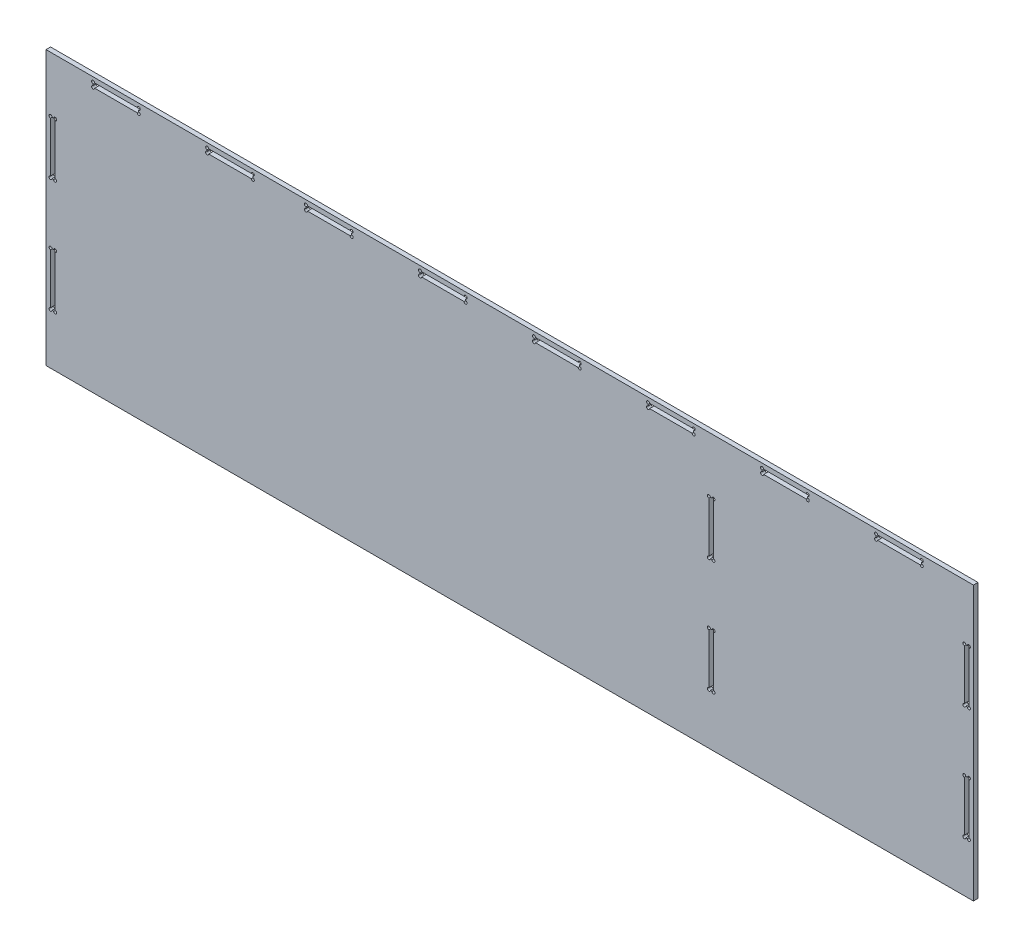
ISO-10303-21;
HEADER;
FILE_DESCRIPTION(('STEP AP214'),'2;1');
FILE_NAME('part.step','',(''),(''),'','','');
FILE_SCHEMA(('AUTOMOTIVE_DESIGN { 1 0 10303 214 1 1 1 1 }'));
ENDSEC;
DATA;
#1=APPLICATION_CONTEXT('core data for automotive mechanical design processes');
#2=APPLICATION_PROTOCOL_DEFINITION('international standard','automotive_design',2000,#1);
#3=PRODUCT_CONTEXT('',#1,'mechanical');
#4=PRODUCT('Part','Part','',(#3));
#5=PRODUCT_RELATED_PRODUCT_CATEGORY('part','',(#4));
#6=PRODUCT_DEFINITION_FORMATION('','',#4);
#7=PRODUCT_DEFINITION_CONTEXT('part definition',#1,'design');
#8=PRODUCT_DEFINITION('design','',#6,#7);
#9=PRODUCT_DEFINITION_SHAPE('','',#8);
#10=(LENGTH_UNIT() NAMED_UNIT(*) SI_UNIT(.MILLI.,.METRE.));
#11=(NAMED_UNIT(*) PLANE_ANGLE_UNIT() SI_UNIT($,.RADIAN.));
#12=(NAMED_UNIT(*) SI_UNIT($,.STERADIAN.) SOLID_ANGLE_UNIT());
#13=UNCERTAINTY_MEASURE_WITH_UNIT(LENGTH_MEASURE(1.E-05),#10,'distance_accuracy_value','');
#14=(GEOMETRIC_REPRESENTATION_CONTEXT(3) GLOBAL_UNCERTAINTY_ASSIGNED_CONTEXT((#13)) GLOBAL_UNIT_ASSIGNED_CONTEXT((#10,
#11,#12)) REPRESENTATION_CONTEXT('',''));
#15=CARTESIAN_POINT('',(0.,0.,0.));
#16=DIRECTION('',(0.,0.,1.));
#17=DIRECTION('',(1.,0.,0.));
#18=AXIS2_PLACEMENT_3D('',#15,#16,#17);
#19=CARTESIAN_POINT('',(0.,107.,6.));
#20=DIRECTION('',(0.,-1.,0.));
#21=DIRECTION('',(0.,0.,-1.));
#22=AXIS2_PLACEMENT_3D('',#19,#20,#21);
#23=PLANE('',#22);
#24=DIRECTION('',(-1.,0.,0.));
#25=VECTOR('',#24,1.);
#26=CARTESIAN_POINT('',(0.,107.,0.));
#27=LINE('',#26,#25);
#28=CARTESIAN_POINT('',(601.999999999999,107.,0.));
#29=VERTEX_POINT('',#28);
#30=CARTESIAN_POINT('',(599.999999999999,107.,0.));
#31=VERTEX_POINT('',#30);
#32=EDGE_CURVE('E1232',#29,#31,#27,.T.);
#33=ORIENTED_EDGE('',*,*,#32,.F.);
#34=DIRECTION('',(0.,0.,-1.));
#35=VECTOR('',#34,1.);
#36=CARTESIAN_POINT('',(601.999999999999,107.,6.));
#37=LINE('',#36,#35);
#38=CARTESIAN_POINT('',(601.999999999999,107.,6.));
#39=VERTEX_POINT('',#38);
#40=EDGE_CURVE('E11',#39,#29,#37,.T.);
#41=ORIENTED_EDGE('',*,*,#40,.F.);
#42=DIRECTION('',(-1.,0.,0.));
#43=VECTOR('',#42,1.);
#44=CARTESIAN_POINT('',(0.,107.,6.));
#45=LINE('',#44,#43);
#46=CARTESIAN_POINT('',(599.999999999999,107.,6.));
#47=VERTEX_POINT('',#46);
#48=EDGE_CURVE('E2023',#39,#47,#45,.T.);
#49=ORIENTED_EDGE('',*,*,#48,.T.);
#50=DIRECTION('',(0.,0.,-1.));
#51=VECTOR('',#50,1.);
#52=CARTESIAN_POINT('',(599.999999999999,107.,6.));
#53=LINE('',#52,#51);
#54=EDGE_CURVE('E425',#47,#31,#53,.T.);
#55=ORIENTED_EDGE('',*,*,#54,.T.);
#56=EDGE_LOOP('',(#33,#41,#49,#55));
#57=FACE_BOUND('',#56,.T.);
#58=ADVANCED_FACE('F47',(#57),#23,.T.);
#59=CARTESIAN_POINT('',(603.999999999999,107.,6.));
#60=DIRECTION('',(0.,0.,-1.));
#61=DIRECTION('',(-1.,0.,0.));
#62=AXIS2_PLACEMENT_3D('',#59,#60,#61);
#63=CYLINDRICAL_SURFACE('',#62,2.);
#64=CARTESIAN_POINT('',(603.999999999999,107.,0.));
#65=DIRECTION('',(0.,0.,1.));
#66=DIRECTION('',(1.,0.,0.));
#67=AXIS2_PLACEMENT_3D('',#64,#65,#66);
#68=CIRCLE('',#67,2.);
#69=CARTESIAN_POINT('',(603.999999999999,105.,0.));
#70=VERTEX_POINT('',#69);
#71=EDGE_CURVE('E1236',#29,#70,#68,.F.);
#72=ORIENTED_EDGE('',*,*,#71,.T.);
#73=DIRECTION('',(0.,0.,-1.));
#74=VECTOR('',#73,1.);
#75=CARTESIAN_POINT('',(603.999999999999,105.,6.));
#76=LINE('',#75,#74);
#77=CARTESIAN_POINT('',(603.999999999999,105.,6.));
#78=VERTEX_POINT('',#77);
#79=EDGE_CURVE('E58',#78,#70,#76,.T.);
#80=ORIENTED_EDGE('',*,*,#79,.F.);
#81=CARTESIAN_POINT('',(603.999999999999,107.,6.));
#82=DIRECTION('',(0.,0.,1.));
#83=DIRECTION('',(1.,0.,0.));
#84=AXIS2_PLACEMENT_3D('',#81,#82,#83);
#85=CIRCLE('',#84,2.);
#86=EDGE_CURVE('E2026',#39,#78,#85,.F.);
#87=ORIENTED_EDGE('',*,*,#86,.F.);
#88=ORIENTED_EDGE('',*,*,#40,.T.);
#89=EDGE_LOOP('',(#72,#80,#87,#88));
#90=FACE_BOUND('',#89,.T.);
#91=ADVANCED_FACE('F2049',(#90),#63,.F.);
#92=CARTESIAN_POINT('',(603.999999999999,0.,6.));
#93=DIRECTION('',(1.,0.,0.));
#94=DIRECTION('',(0.,0.,-1.));
#95=AXIS2_PLACEMENT_3D('',#92,#93,#94);
#96=PLANE('',#95);
#97=DIRECTION('',(0.,-1.,0.));
#98=VECTOR('',#97,1.);
#99=CARTESIAN_POINT('',(603.999999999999,0.,0.));
#100=LINE('',#99,#98);
#101=CARTESIAN_POINT('',(603.999999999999,38.9999999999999,0.));
#102=VERTEX_POINT('',#101);
#103=EDGE_CURVE('E1240',#70,#102,#100,.T.);
#104=ORIENTED_EDGE('',*,*,#103,.T.);
#105=DIRECTION('',(0.,0.,-1.));
#106=VECTOR('',#105,1.);
#107=CARTESIAN_POINT('',(603.999999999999,38.9999999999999,6.));
#108=LINE('',#107,#106);
#109=CARTESIAN_POINT('',(603.999999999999,38.9999999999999,6.));
#110=VERTEX_POINT('',#109);
#111=EDGE_CURVE('E1272',#110,#102,#108,.T.);
#112=ORIENTED_EDGE('',*,*,#111,.F.);
#113=DIRECTION('',(0.,-1.,0.));
#114=VECTOR('',#113,1.);
#115=CARTESIAN_POINT('',(603.999999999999,0.,6.));
#116=LINE('',#115,#114);
#117=EDGE_CURVE('E2030',#78,#110,#116,.T.);
#118=ORIENTED_EDGE('',*,*,#117,.F.);
#119=ORIENTED_EDGE('',*,*,#79,.T.);
#120=EDGE_LOOP('',(#104,#112,#118,#119));
#121=FACE_BOUND('',#120,.T.);
#122=ADVANCED_FACE('F2051',(#121),#96,.F.);
#123=CARTESIAN_POINT('',(603.999999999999,37.,6.));
#124=DIRECTION('',(0.,0.,-1.));
#125=DIRECTION('',(-1.,0.,0.));
#126=AXIS2_PLACEMENT_3D('',#123,#124,#125);
#127=CYLINDRICAL_SURFACE('',#126,2.);
#128=CARTESIAN_POINT('',(603.999999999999,37.,0.));
#129=DIRECTION('',(0.,0.,1.));
#130=DIRECTION('',(1.,0.,0.));
#131=AXIS2_PLACEMENT_3D('',#128,#129,#130);
#132=CIRCLE('',#131,2.);
#133=CARTESIAN_POINT('',(601.999999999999,37.,0.));
#134=VERTEX_POINT('',#133);
#135=EDGE_CURVE('E1244',#102,#134,#132,.F.);
#136=ORIENTED_EDGE('',*,*,#135,.T.);
#137=DIRECTION('',(0.,0.,-1.));
#138=VECTOR('',#137,1.);
#139=CARTESIAN_POINT('',(601.999999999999,37.,6.));
#140=LINE('',#139,#138);
#141=CARTESIAN_POINT('',(601.999999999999,37.,6.));
#142=VERTEX_POINT('',#141);
#143=EDGE_CURVE('E1268',#142,#134,#140,.T.);
#144=ORIENTED_EDGE('',*,*,#143,.F.);
#145=CARTESIAN_POINT('',(603.999999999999,37.,6.));
#146=DIRECTION('',(0.,0.,1.));
#147=DIRECTION('',(1.,0.,0.));
#148=AXIS2_PLACEMENT_3D('',#145,#146,#147);
#149=CIRCLE('',#148,2.);
#150=EDGE_CURVE('E2034',#110,#142,#149,.F.);
#151=ORIENTED_EDGE('',*,*,#150,.F.);
#152=ORIENTED_EDGE('',*,*,#111,.T.);
#153=EDGE_LOOP('',(#136,#144,#151,#152));
#154=FACE_BOUND('',#153,.T.);
#155=ADVANCED_FACE('F2040',(#154),#127,.F.);
#156=CARTESIAN_POINT('',(0.,37.,6.));
#157=DIRECTION('',(0.,-1.,0.));
#158=DIRECTION('',(0.,0.,-1.));
#159=AXIS2_PLACEMENT_3D('',#156,#157,#158);
#160=PLANE('',#159);
#161=DIRECTION('',(-1.,0.,0.));
#162=VECTOR('',#161,1.);
#163=CARTESIAN_POINT('',(0.,37.,0.));
#164=LINE('',#163,#162);
#165=CARTESIAN_POINT('',(599.999999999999,37.,0.));
#166=VERTEX_POINT('',#165);
#167=EDGE_CURVE('E1248',#134,#166,#164,.T.);
#168=ORIENTED_EDGE('',*,*,#167,.T.);
#169=DIRECTION('',(0.,0.,-1.));
#170=VECTOR('',#169,1.);
#171=CARTESIAN_POINT('',(599.999999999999,37.,6.));
#172=LINE('',#171,#170);
#173=CARTESIAN_POINT('',(599.999999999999,37.,6.));
#174=VERTEX_POINT('',#173);
#175=EDGE_CURVE('E790',#174,#166,#172,.T.);
#176=ORIENTED_EDGE('',*,*,#175,.F.);
#177=DIRECTION('',(-1.,0.,0.));
#178=VECTOR('',#177,1.);
#179=CARTESIAN_POINT('',(0.,37.,6.));
#180=LINE('',#179,#178);
#181=EDGE_CURVE('E776',#142,#174,#180,.T.);
#182=ORIENTED_EDGE('',*,*,#181,.F.);
#183=ORIENTED_EDGE('',*,*,#143,.T.);
#184=EDGE_LOOP('',(#168,#176,#182,#183));
#185=FACE_BOUND('',#184,.T.);
#186=ADVANCED_FACE('F2042',(#185),#160,.F.);
#187=CARTESIAN_POINT('',(597.999999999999,37.,6.));
#188=DIRECTION('',(0.,0.,-1.));
#189=DIRECTION('',(-1.,0.,0.));
#190=AXIS2_PLACEMENT_3D('',#187,#188,#189);
#191=CYLINDRICAL_SURFACE('',#190,2.);
#192=CARTESIAN_POINT('',(597.999999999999,37.,0.));
#193=DIRECTION('',(0.,0.,1.));
#194=DIRECTION('',(1.,0.,0.));
#195=AXIS2_PLACEMENT_3D('',#192,#193,#194);
#196=CIRCLE('',#195,2.);
#197=CARTESIAN_POINT('',(597.999999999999,38.9999999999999,0.));
#198=VERTEX_POINT('',#197);
#199=EDGE_CURVE('E785',#166,#198,#196,.F.);
#200=ORIENTED_EDGE('',*,*,#199,.T.);
#201=DIRECTION('',(0.,0.,-1.));
#202=VECTOR('',#201,1.);
#203=CARTESIAN_POINT('',(597.999999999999,38.9999999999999,6.));
#204=LINE('',#203,#202);
#205=CARTESIAN_POINT('',(597.999999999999,38.9999999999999,6.));
#206=VERTEX_POINT('',#205);
#207=EDGE_CURVE('E783',#206,#198,#204,.T.);
#208=ORIENTED_EDGE('',*,*,#207,.F.);
#209=CARTESIAN_POINT('',(597.999999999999,37.,6.));
#210=DIRECTION('',(0.,0.,1.));
#211=DIRECTION('',(1.,0.,0.));
#212=AXIS2_PLACEMENT_3D('',#209,#210,#211);
#213=CIRCLE('',#212,2.);
#214=EDGE_CURVE('E770',#174,#206,#213,.F.);
#215=ORIENTED_EDGE('',*,*,#214,.F.);
#216=ORIENTED_EDGE('',*,*,#175,.T.);
#217=EDGE_LOOP('',(#200,#208,#215,#216));
#218=FACE_BOUND('',#217,.T.);
#219=ADVANCED_FACE('F784',(#218),#191,.F.);
#220=CARTESIAN_POINT('',(597.999999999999,0.,6.));
#221=DIRECTION('',(1.,0.,0.));
#222=DIRECTION('',(0.,0.,-1.));
#223=AXIS2_PLACEMENT_3D('',#220,#221,#222);
#224=PLANE('',#223);
#225=DIRECTION('',(0.,-1.,0.));
#226=VECTOR('',#225,1.);
#227=CARTESIAN_POINT('',(597.999999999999,0.,0.));
#228=LINE('',#227,#226);
#229=CARTESIAN_POINT('',(597.999999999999,105.,0.));
#230=VERTEX_POINT('',#229);
#231=EDGE_CURVE('E1254',#230,#198,#228,.T.);
#232=ORIENTED_EDGE('',*,*,#231,.F.);
#233=DIRECTION('',(0.,0.,-1.));
#234=VECTOR('',#233,1.);
#235=CARTESIAN_POINT('',(597.999999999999,105.,6.));
#236=LINE('',#235,#234);
#237=CARTESIAN_POINT('',(597.999999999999,105.,6.));
#238=VERTEX_POINT('',#237);
#239=EDGE_CURVE('E418',#238,#230,#236,.T.);
#240=ORIENTED_EDGE('',*,*,#239,.F.);
#241=DIRECTION('',(0.,-1.,0.));
#242=VECTOR('',#241,1.);
#243=CARTESIAN_POINT('',(597.999999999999,0.,6.));
#244=LINE('',#243,#242);
#245=EDGE_CURVE('E774',#238,#206,#244,.T.);
#246=ORIENTED_EDGE('',*,*,#245,.T.);
#247=ORIENTED_EDGE('',*,*,#207,.T.);
#248=EDGE_LOOP('',(#232,#240,#246,#247));
#249=FACE_BOUND('',#248,.T.);
#250=ADVANCED_FACE('F792',(#249),#224,.T.);
#251=CARTESIAN_POINT('',(0.,-43.,6.));
#252=DIRECTION('',(0.,-1.,0.));
#253=DIRECTION('',(0.,0.,-1.));
#254=AXIS2_PLACEMENT_3D('',#251,#252,#253);
#255=PLANE('',#254);
#256=DIRECTION('',(-1.,0.,0.));
#257=VECTOR('',#256,1.);
#258=CARTESIAN_POINT('',(0.,-43.,0.));
#259=LINE('',#258,#257);
#260=CARTESIAN_POINT('',(601.999999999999,-43.,0.));
#261=VERTEX_POINT('',#260);
#262=CARTESIAN_POINT('',(599.999999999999,-43.,0.));
#263=VERTEX_POINT('',#262);
#264=EDGE_CURVE('E1200',#261,#263,#259,.T.);
#265=ORIENTED_EDGE('',*,*,#264,.F.);
#266=DIRECTION('',(0.,0.,-1.));
#267=VECTOR('',#266,1.);
#268=CARTESIAN_POINT('',(601.999999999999,-43.,6.));
#269=LINE('',#268,#267);
#270=CARTESIAN_POINT('',(601.999999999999,-43.,6.));
#271=VERTEX_POINT('',#270);
#272=EDGE_CURVE('E1263',#271,#261,#269,.T.);
#273=ORIENTED_EDGE('',*,*,#272,.F.);
#274=DIRECTION('',(-1.,0.,0.));
#275=VECTOR('',#274,1.);
#276=CARTESIAN_POINT('',(0.,-43.,6.));
#277=LINE('',#276,#275);
#278=CARTESIAN_POINT('',(599.999999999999,-43.,6.));
#279=VERTEX_POINT('',#278);
#280=EDGE_CURVE('E1993',#271,#279,#277,.T.);
#281=ORIENTED_EDGE('',*,*,#280,.T.);
#282=DIRECTION('',(0.,0.,-1.));
#283=VECTOR('',#282,1.);
#284=CARTESIAN_POINT('',(599.999999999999,-43.,6.));
#285=LINE('',#284,#283);
#286=EDGE_CURVE('E1279',#279,#263,#285,.T.);
#287=ORIENTED_EDGE('',*,*,#286,.T.);
#288=EDGE_LOOP('',(#265,#273,#281,#287));
#289=FACE_BOUND('',#288,.T.);
#290=ADVANCED_FACE('F2095',(#289),#255,.T.);
#291=CARTESIAN_POINT('',(603.999999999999,-43.,6.));
#292=DIRECTION('',(0.,0.,-1.));
#293=DIRECTION('',(-1.,0.,0.));
#294=AXIS2_PLACEMENT_3D('',#291,#292,#293);
#295=CYLINDRICAL_SURFACE('',#294,2.);
#296=CARTESIAN_POINT('',(603.999999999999,-43.,0.));
#297=DIRECTION('',(0.,0.,1.));
#298=DIRECTION('',(1.,0.,0.));
#299=AXIS2_PLACEMENT_3D('',#296,#297,#298);
#300=CIRCLE('',#299,2.);
#301=CARTESIAN_POINT('',(603.999999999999,-45.,0.));
#302=VERTEX_POINT('',#301);
#303=EDGE_CURVE('E1204',#261,#302,#300,.F.);
#304=ORIENTED_EDGE('',*,*,#303,.T.);
#305=DIRECTION('',(0.,0.,-1.));
#306=VECTOR('',#305,1.);
#307=CARTESIAN_POINT('',(603.999999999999,-45.,6.));
#308=LINE('',#307,#306);
#309=CARTESIAN_POINT('',(603.999999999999,-45.,6.));
#310=VERTEX_POINT('',#309);
#311=EDGE_CURVE('E1301',#310,#302,#308,.T.);
#312=ORIENTED_EDGE('',*,*,#311,.F.);
#313=CARTESIAN_POINT('',(603.999999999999,-43.,6.));
#314=DIRECTION('',(0.,0.,1.));
#315=DIRECTION('',(1.,0.,0.));
#316=AXIS2_PLACEMENT_3D('',#313,#314,#315);
#317=CIRCLE('',#316,2.);
#318=EDGE_CURVE('E1997',#271,#310,#317,.F.);
#319=ORIENTED_EDGE('',*,*,#318,.F.);
#320=ORIENTED_EDGE('',*,*,#272,.T.);
#321=EDGE_LOOP('',(#304,#312,#319,#320));
#322=FACE_BOUND('',#321,.T.);
#323=ADVANCED_FACE('F2091',(#322),#295,.F.);
#324=CARTESIAN_POINT('',(603.999999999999,0.,6.));
#325=DIRECTION('',(1.,0.,0.));
#326=DIRECTION('',(0.,0.,-1.));
#327=AXIS2_PLACEMENT_3D('',#324,#325,#326);
#328=PLANE('',#327);
#329=DIRECTION('',(0.,-1.,0.));
#330=VECTOR('',#329,1.);
#331=CARTESIAN_POINT('',(603.999999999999,0.,0.));
#332=LINE('',#331,#330);
#333=CARTESIAN_POINT('',(603.999999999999,-111.,0.));
#334=VERTEX_POINT('',#333);
#335=EDGE_CURVE('E1208',#302,#334,#332,.T.);
#336=ORIENTED_EDGE('',*,*,#335,.T.);
#337=DIRECTION('',(0.,0.,-1.));
#338=VECTOR('',#337,1.);
#339=CARTESIAN_POINT('',(603.999999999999,-111.,6.));
#340=LINE('',#339,#338);
#341=CARTESIAN_POINT('',(603.999999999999,-111.,6.));
#342=VERTEX_POINT('',#341);
#343=EDGE_CURVE('E1297',#342,#334,#340,.T.);
#344=ORIENTED_EDGE('',*,*,#343,.F.);
#345=DIRECTION('',(0.,-1.,0.));
#346=VECTOR('',#345,1.);
#347=CARTESIAN_POINT('',(603.999999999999,0.,6.));
#348=LINE('',#347,#346);
#349=EDGE_CURVE('E2001',#310,#342,#348,.T.);
#350=ORIENTED_EDGE('',*,*,#349,.F.);
#351=ORIENTED_EDGE('',*,*,#311,.T.);
#352=EDGE_LOOP('',(#336,#344,#350,#351));
#353=FACE_BOUND('',#352,.T.);
#354=ADVANCED_FACE('F2087',(#353),#328,.F.);
#355=CARTESIAN_POINT('',(603.999999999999,-113.,6.));
#356=DIRECTION('',(0.,0.,-1.));
#357=DIRECTION('',(-1.,0.,0.));
#358=AXIS2_PLACEMENT_3D('',#355,#356,#357);
#359=CYLINDRICAL_SURFACE('',#358,2.);
#360=CARTESIAN_POINT('',(603.999999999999,-113.,0.));
#361=DIRECTION('',(0.,0.,1.));
#362=DIRECTION('',(1.,0.,0.));
#363=AXIS2_PLACEMENT_3D('',#360,#361,#362);
#364=CIRCLE('',#363,2.);
#365=CARTESIAN_POINT('',(601.999999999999,-113.,0.));
#366=VERTEX_POINT('',#365);
#367=EDGE_CURVE('E1212',#334,#366,#364,.F.);
#368=ORIENTED_EDGE('',*,*,#367,.T.);
#369=DIRECTION('',(0.,0.,-1.));
#370=VECTOR('',#369,1.);
#371=CARTESIAN_POINT('',(601.999999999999,-113.,6.));
#372=LINE('',#371,#370);
#373=CARTESIAN_POINT('',(601.999999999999,-113.,6.));
#374=VERTEX_POINT('',#373);
#375=EDGE_CURVE('E1293',#374,#366,#372,.T.);
#376=ORIENTED_EDGE('',*,*,#375,.F.);
#377=CARTESIAN_POINT('',(603.999999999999,-113.,6.));
#378=DIRECTION('',(0.,0.,1.));
#379=DIRECTION('',(1.,0.,0.));
#380=AXIS2_PLACEMENT_3D('',#377,#378,#379);
#381=CIRCLE('',#380,2.);
#382=EDGE_CURVE('E2005',#342,#374,#381,.F.);
#383=ORIENTED_EDGE('',*,*,#382,.F.);
#384=ORIENTED_EDGE('',*,*,#343,.T.);
#385=EDGE_LOOP('',(#368,#376,#383,#384));
#386=FACE_BOUND('',#385,.T.);
#387=ADVANCED_FACE('F2083',(#386),#359,.F.);
#388=CARTESIAN_POINT('',(0.,-113.,6.));
#389=DIRECTION('',(0.,-1.,0.));
#390=DIRECTION('',(0.,0.,-1.));
#391=AXIS2_PLACEMENT_3D('',#388,#389,#390);
#392=PLANE('',#391);
#393=DIRECTION('',(-1.,0.,0.));
#394=VECTOR('',#393,1.);
#395=CARTESIAN_POINT('',(0.,-113.,0.));
#396=LINE('',#395,#394);
#397=CARTESIAN_POINT('',(599.999999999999,-113.,0.));
#398=VERTEX_POINT('',#397);
#399=EDGE_CURVE('E1216',#366,#398,#396,.T.);
#400=ORIENTED_EDGE('',*,*,#399,.T.);
#401=DIRECTION('',(0.,0.,-1.));
#402=VECTOR('',#401,1.);
#403=CARTESIAN_POINT('',(599.999999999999,-113.,6.));
#404=LINE('',#403,#402);
#405=CARTESIAN_POINT('',(599.999999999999,-113.,6.));
#406=VERTEX_POINT('',#405);
#407=EDGE_CURVE('E1289',#406,#398,#404,.T.);
#408=ORIENTED_EDGE('',*,*,#407,.F.);
#409=DIRECTION('',(-1.,0.,0.));
#410=VECTOR('',#409,1.);
#411=CARTESIAN_POINT('',(0.,-113.,6.));
#412=LINE('',#411,#410);
#413=EDGE_CURVE('E2009',#374,#406,#412,.T.);
#414=ORIENTED_EDGE('',*,*,#413,.F.);
#415=ORIENTED_EDGE('',*,*,#375,.T.);
#416=EDGE_LOOP('',(#400,#408,#414,#415));
#417=FACE_BOUND('',#416,.T.);
#418=ADVANCED_FACE('F2079',(#417),#392,.F.);
#419=CARTESIAN_POINT('',(597.999999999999,-113.,6.));
#420=DIRECTION('',(0.,0.,-1.));
#421=DIRECTION('',(-1.,0.,0.));
#422=AXIS2_PLACEMENT_3D('',#419,#420,#421);
#423=CYLINDRICAL_SURFACE('',#422,2.);
#424=CARTESIAN_POINT('',(597.999999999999,-113.,0.));
#425=DIRECTION('',(0.,0.,1.));
#426=DIRECTION('',(1.,0.,0.));
#427=AXIS2_PLACEMENT_3D('',#424,#425,#426);
#428=CIRCLE('',#427,2.);
#429=CARTESIAN_POINT('',(597.999999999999,-111.,0.));
#430=VERTEX_POINT('',#429);
#431=EDGE_CURVE('E1220',#398,#430,#428,.F.);
#432=ORIENTED_EDGE('',*,*,#431,.T.);
#433=DIRECTION('',(0.,0.,-1.));
#434=VECTOR('',#433,1.);
#435=CARTESIAN_POINT('',(597.999999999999,-111.,6.));
#436=LINE('',#435,#434);
#437=CARTESIAN_POINT('',(597.999999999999,-111.,6.));
#438=VERTEX_POINT('',#437);
#439=EDGE_CURVE('E1286',#438,#430,#436,.T.);
#440=ORIENTED_EDGE('',*,*,#439,.F.);
#441=CARTESIAN_POINT('',(597.999999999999,-113.,6.));
#442=DIRECTION('',(0.,0.,1.));
#443=DIRECTION('',(1.,0.,0.));
#444=AXIS2_PLACEMENT_3D('',#441,#442,#443);
#445=CIRCLE('',#444,2.);
#446=EDGE_CURVE('E2013',#406,#438,#445,.F.);
#447=ORIENTED_EDGE('',*,*,#446,.F.);
#448=ORIENTED_EDGE('',*,*,#407,.T.);
#449=EDGE_LOOP('',(#432,#440,#447,#448));
#450=FACE_BOUND('',#449,.T.);
#451=ADVANCED_FACE('F2075',(#450),#423,.F.);
#452=CARTESIAN_POINT('',(597.999999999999,0.,6.));
#453=DIRECTION('',(1.,0.,0.));
#454=DIRECTION('',(0.,0.,-1.));
#455=AXIS2_PLACEMENT_3D('',#452,#453,#454);
#456=PLANE('',#455);
#457=DIRECTION('',(0.,-1.,0.));
#458=VECTOR('',#457,1.);
#459=CARTESIAN_POINT('',(597.999999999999,0.,0.));
#460=LINE('',#459,#458);
#461=CARTESIAN_POINT('',(597.999999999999,-45.,0.));
#462=VERTEX_POINT('',#461);
#463=EDGE_CURVE('E1224',#462,#430,#460,.T.);
#464=ORIENTED_EDGE('',*,*,#463,.F.);
#465=DIRECTION('',(0.,0.,-1.));
#466=VECTOR('',#465,1.);
#467=CARTESIAN_POINT('',(597.999999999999,-45.,6.));
#468=LINE('',#467,#466);
#469=CARTESIAN_POINT('',(597.999999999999,-45.,6.));
#470=VERTEX_POINT('',#469);
#471=EDGE_CURVE('E1282',#470,#462,#468,.T.);
#472=ORIENTED_EDGE('',*,*,#471,.F.);
#473=DIRECTION('',(0.,-1.,0.));
#474=VECTOR('',#473,1.);
#475=CARTESIAN_POINT('',(597.999999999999,0.,6.));
#476=LINE('',#475,#474);
#477=EDGE_CURVE('E2016',#470,#438,#476,.T.);
#478=ORIENTED_EDGE('',*,*,#477,.T.);
#479=ORIENTED_EDGE('',*,*,#439,.T.);
#480=EDGE_LOOP('',(#464,#472,#478,#479));
#481=FACE_BOUND('',#480,.T.);
#482=ADVANCED_FACE('F2071',(#481),#456,.T.);
#483=CARTESIAN_POINT('',(0.,-180.,6.));
#484=DIRECTION('',(0.,1.,0.));
#485=DIRECTION('',(0.,0.,1.));
#486=AXIS2_PLACEMENT_3D('',#483,#484,#485);
#487=PLANE('',#486);
#488=DIRECTION('',(1.,0.,0.));
#489=VECTOR('',#488,1.);
#490=CARTESIAN_POINT('',(0.,-180.,0.));
#491=LINE('',#490,#489);
#492=CARTESIAN_POINT('',(-610.,-180.,0.));
#493=VERTEX_POINT('',#492);
#494=CARTESIAN_POINT('',(610.,-180.,0.));
#495=VERTEX_POINT('',#494);
#496=EDGE_CURVE('E1184',#493,#495,#491,.T.);
#497=ORIENTED_EDGE('',*,*,#496,.T.);
#498=DIRECTION('',(0.,0.,-1.));
#499=VECTOR('',#498,1.);
#500=CARTESIAN_POINT('',(610.,-180.,6.));
#501=LINE('',#500,#499);
#502=CARTESIAN_POINT('',(610.,-180.,6.));
#503=VERTEX_POINT('',#502);
#504=EDGE_CURVE('E1283',#503,#495,#501,.T.);
#505=ORIENTED_EDGE('',*,*,#504,.F.);
#506=DIRECTION('',(1.,0.,0.));
#507=VECTOR('',#506,1.);
#508=CARTESIAN_POINT('',(0.,-180.,6.));
#509=LINE('',#508,#507);
#510=CARTESIAN_POINT('',(-610.,-180.,6.));
#511=VERTEX_POINT('',#510);
#512=EDGE_CURVE('E1978',#511,#503,#509,.T.);
#513=ORIENTED_EDGE('',*,*,#512,.F.);
#514=DIRECTION('',(0.,0.,-1.));
#515=VECTOR('',#514,1.);
#516=CARTESIAN_POINT('',(-610.,-180.,6.));
#517=LINE('',#516,#515);
#518=EDGE_CURVE('E1307',#511,#493,#517,.T.);
#519=ORIENTED_EDGE('',*,*,#518,.T.);
#520=EDGE_LOOP('',(#497,#505,#513,#519));
#521=FACE_BOUND('',#520,.T.);
#522=ADVANCED_FACE('F2074',(#521),#487,.F.);
#523=CARTESIAN_POINT('',(610.,0.,6.));
#524=DIRECTION('',(-1.,0.,0.));
#525=DIRECTION('',(0.,0.,1.));
#526=AXIS2_PLACEMENT_3D('',#523,#524,#525);
#527=PLANE('',#526);
#528=DIRECTION('',(0.,1.,0.));
#529=VECTOR('',#528,1.);
#530=CARTESIAN_POINT('',(610.,0.,0.));
#531=LINE('',#530,#529);
#532=CARTESIAN_POINT('',(610.,180.,0.));
#533=VERTEX_POINT('',#532);
#534=EDGE_CURVE('E1188',#495,#533,#531,.T.);
#535=ORIENTED_EDGE('',*,*,#534,.T.);
#536=DIRECTION('',(0.,0.,-1.));
#537=VECTOR('',#536,1.);
#538=CARTESIAN_POINT('',(610.,180.,6.));
#539=LINE('',#538,#537);
#540=CARTESIAN_POINT('',(610.,180.,6.));
#541=VERTEX_POINT('',#540);
#542=EDGE_CURVE('E1314',#541,#533,#539,.T.);
#543=ORIENTED_EDGE('',*,*,#542,.F.);
#544=DIRECTION('',(0.,1.,0.));
#545=VECTOR('',#544,1.);
#546=CARTESIAN_POINT('',(610.,0.,6.));
#547=LINE('',#546,#545);
#548=EDGE_CURVE('E1982',#503,#541,#547,.T.);
#549=ORIENTED_EDGE('',*,*,#548,.F.);
#550=ORIENTED_EDGE('',*,*,#504,.T.);
#551=EDGE_LOOP('',(#535,#543,#549,#550));
#552=FACE_BOUND('',#551,.T.);
#553=ADVANCED_FACE('F2108',(#552),#527,.F.);
#554=CARTESIAN_POINT('',(0.,180.,6.));
#555=DIRECTION('',(0.,1.,0.));
#556=DIRECTION('',(0.,0.,1.));
#557=AXIS2_PLACEMENT_3D('',#554,#555,#556);
#558=PLANE('',#557);
#559=DIRECTION('',(1.,0.,0.));
#560=VECTOR('',#559,1.);
#561=CARTESIAN_POINT('',(0.,180.,0.));
#562=LINE('',#561,#560);
#563=CARTESIAN_POINT('',(-610.,180.,0.));
#564=VERTEX_POINT('',#563);
#565=EDGE_CURVE('E1192',#564,#533,#562,.T.);
#566=ORIENTED_EDGE('',*,*,#565,.F.);
#567=DIRECTION('',(0.,0.,-1.));
#568=VECTOR('',#567,1.);
#569=CARTESIAN_POINT('',(-610.,180.,6.));
#570=LINE('',#569,#568);
#571=CARTESIAN_POINT('',(-610.,180.,6.));
#572=VERTEX_POINT('',#571);
#573=EDGE_CURVE('E1310',#572,#564,#570,.T.);
#574=ORIENTED_EDGE('',*,*,#573,.F.);
#575=DIRECTION('',(1.,0.,0.));
#576=VECTOR('',#575,1.);
#577=CARTESIAN_POINT('',(0.,180.,6.));
#578=LINE('',#577,#576);
#579=EDGE_CURVE('E1985',#572,#541,#578,.T.);
#580=ORIENTED_EDGE('',*,*,#579,.T.);
#581=ORIENTED_EDGE('',*,*,#542,.T.);
#582=EDGE_LOOP('',(#566,#574,#580,#581));
#583=FACE_BOUND('',#582,.T.);
#584=ADVANCED_FACE('F2104',(#583),#558,.T.);
#585=CARTESIAN_POINT('',(-598.,37.,6.));
#586=DIRECTION('',(0.,0.,-1.));
#587=DIRECTION('',(-1.,0.,0.));
#588=AXIS2_PLACEMENT_3D('',#585,#586,#587);
#589=CYLINDRICAL_SURFACE('',#588,2.);
#590=CARTESIAN_POINT('',(-598.,37.,0.));
#591=DIRECTION('',(0.,0.,1.));
#592=DIRECTION('',(1.,0.,0.));
#593=AXIS2_PLACEMENT_3D('',#590,#591,#592);
#594=CIRCLE('',#593,2.);
#595=CARTESIAN_POINT('',(-600.,37.,0.));
#596=VERTEX_POINT('',#595);
#597=CARTESIAN_POINT('',(-598.,39.,0.));
#598=VERTEX_POINT('',#597);
#599=EDGE_CURVE('E1152',#596,#598,#594,.T.);
#600=ORIENTED_EDGE('',*,*,#599,.F.);
#601=DIRECTION('',(0.,0.,-1.));
#602=VECTOR('',#601,1.);
#603=CARTESIAN_POINT('',(-600.,37.,6.));
#604=LINE('',#603,#602);
#605=CARTESIAN_POINT('',(-600.,37.,6.));
#606=VERTEX_POINT('',#605);
#607=EDGE_CURVE('E1311',#606,#596,#604,.T.);
#608=ORIENTED_EDGE('',*,*,#607,.F.);
#609=CARTESIAN_POINT('',(-598.,37.,6.));
#610=DIRECTION('',(0.,0.,1.));
#611=DIRECTION('',(1.,0.,0.));
#612=AXIS2_PLACEMENT_3D('',#609,#610,#611);
#613=CIRCLE('',#612,2.);
#614=CARTESIAN_POINT('',(-598.,39.,6.));
#615=VERTEX_POINT('',#614);
#616=EDGE_CURVE('E1948',#606,#615,#613,.T.);
#617=ORIENTED_EDGE('',*,*,#616,.T.);
#618=DIRECTION('',(0.,0.,-1.));
#619=VECTOR('',#618,1.);
#620=CARTESIAN_POINT('',(-598.,39.,6.));
#621=LINE('',#620,#619);
#622=EDGE_CURVE('E1320',#615,#598,#621,.T.);
#623=ORIENTED_EDGE('',*,*,#622,.T.);
#624=EDGE_LOOP('',(#600,#608,#617,#623));
#625=FACE_BOUND('',#624,.T.);
#626=ADVANCED_FACE('F2107',(#625),#589,.F.);
#627=CARTESIAN_POINT('',(0.,37.,6.));
#628=DIRECTION('',(0.,1.,0.));
#629=DIRECTION('',(0.,0.,1.));
#630=AXIS2_PLACEMENT_3D('',#627,#628,#629);
#631=PLANE('',#630);
#632=DIRECTION('',(1.,0.,0.));
#633=VECTOR('',#632,1.);
#634=CARTESIAN_POINT('',(0.,37.,0.));
#635=LINE('',#634,#633);
#636=CARTESIAN_POINT('',(-602.,37.,0.));
#637=VERTEX_POINT('',#636);
#638=EDGE_CURVE('E1156',#637,#596,#635,.T.);
#639=ORIENTED_EDGE('',*,*,#638,.F.);
#640=DIRECTION('',(0.,0.,-1.));
#641=VECTOR('',#640,1.);
#642=CARTESIAN_POINT('',(-602.,37.,6.));
#643=LINE('',#642,#641);
#644=CARTESIAN_POINT('',(-602.,37.,6.));
#645=VERTEX_POINT('',#644);
#646=EDGE_CURVE('E1339',#645,#637,#643,.T.);
#647=ORIENTED_EDGE('',*,*,#646,.F.);
#648=DIRECTION('',(1.,0.,0.));
#649=VECTOR('',#648,1.);
#650=CARTESIAN_POINT('',(0.,37.,6.));
#651=LINE('',#650,#649);
#652=EDGE_CURVE('E1952',#645,#606,#651,.T.);
#653=ORIENTED_EDGE('',*,*,#652,.T.);
#654=ORIENTED_EDGE('',*,*,#607,.T.);
#655=EDGE_LOOP('',(#639,#647,#653,#654));
#656=FACE_BOUND('',#655,.T.);
#657=ADVANCED_FACE('F2140',(#656),#631,.T.);
#658=CARTESIAN_POINT('',(-604.,37.,6.));
#659=DIRECTION('',(0.,0.,-1.));
#660=DIRECTION('',(-1.,0.,0.));
#661=AXIS2_PLACEMENT_3D('',#658,#659,#660);
#662=CYLINDRICAL_SURFACE('',#661,2.);
#663=CARTESIAN_POINT('',(-604.,37.,0.));
#664=DIRECTION('',(0.,0.,1.));
#665=DIRECTION('',(1.,0.,0.));
#666=AXIS2_PLACEMENT_3D('',#663,#664,#665);
#667=CIRCLE('',#666,2.);
#668=CARTESIAN_POINT('',(-604.,39.,0.));
#669=VERTEX_POINT('',#668);
#670=EDGE_CURVE('E1160',#669,#637,#667,.T.);
#671=ORIENTED_EDGE('',*,*,#670,.F.);
#672=DIRECTION('',(0.,0.,-1.));
#673=VECTOR('',#672,1.);
#674=CARTESIAN_POINT('',(-604.,39.,6.));
#675=LINE('',#674,#673);
#676=CARTESIAN_POINT('',(-604.,39.,6.));
#677=VERTEX_POINT('',#676);
#678=EDGE_CURVE('E1336',#677,#669,#675,.T.);
#679=ORIENTED_EDGE('',*,*,#678,.F.);
#680=CARTESIAN_POINT('',(-604.,37.,6.));
#681=DIRECTION('',(0.,0.,1.));
#682=DIRECTION('',(1.,0.,0.));
#683=AXIS2_PLACEMENT_3D('',#680,#681,#682);
#684=CIRCLE('',#683,2.);
#685=EDGE_CURVE('E1956',#677,#645,#684,.T.);
#686=ORIENTED_EDGE('',*,*,#685,.T.);
#687=ORIENTED_EDGE('',*,*,#646,.T.);
#688=EDGE_LOOP('',(#671,#679,#686,#687));
#689=FACE_BOUND('',#688,.T.);
#690=ADVANCED_FACE('F2136',(#689),#662,.F.);
#691=CARTESIAN_POINT('',(-604.,0.,6.));
#692=DIRECTION('',(1.,0.,0.));
#693=DIRECTION('',(0.,0.,-1.));
#694=AXIS2_PLACEMENT_3D('',#691,#692,#693);
#695=PLANE('',#694);
#696=DIRECTION('',(0.,-1.,0.));
#697=VECTOR('',#696,1.);
#698=CARTESIAN_POINT('',(-604.,0.,0.));
#699=LINE('',#698,#697);
#700=CARTESIAN_POINT('',(-604.,105.,0.));
#701=VERTEX_POINT('',#700);
#702=EDGE_CURVE('E1164',#701,#669,#699,.T.);
#703=ORIENTED_EDGE('',*,*,#702,.F.);
#704=DIRECTION('',(0.,0.,-1.));
#705=VECTOR('',#704,1.);
#706=CARTESIAN_POINT('',(-604.,105.,6.));
#707=LINE('',#706,#705);
#708=CARTESIAN_POINT('',(-604.,105.,6.));
#709=VERTEX_POINT('',#708);
#710=EDGE_CURVE('E1333',#709,#701,#707,.T.);
#711=ORIENTED_EDGE('',*,*,#710,.F.);
#712=DIRECTION('',(0.,-1.,0.));
#713=VECTOR('',#712,1.);
#714=CARTESIAN_POINT('',(-604.,0.,6.));
#715=LINE('',#714,#713);
#716=EDGE_CURVE('E1960',#709,#677,#715,.T.);
#717=ORIENTED_EDGE('',*,*,#716,.T.);
#718=ORIENTED_EDGE('',*,*,#678,.T.);
#719=EDGE_LOOP('',(#703,#711,#717,#718));
#720=FACE_BOUND('',#719,.T.);
#721=ADVANCED_FACE('F2132',(#720),#695,.T.);
#722=CARTESIAN_POINT('',(-604.,107.,6.));
#723=DIRECTION('',(0.,0.,-1.));
#724=DIRECTION('',(-1.,0.,0.));
#725=AXIS2_PLACEMENT_3D('',#722,#723,#724);
#726=CYLINDRICAL_SURFACE('',#725,2.);
#727=CARTESIAN_POINT('',(-604.,107.,0.));
#728=DIRECTION('',(0.,0.,1.));
#729=DIRECTION('',(1.,0.,0.));
#730=AXIS2_PLACEMENT_3D('',#727,#728,#729);
#731=CIRCLE('',#730,2.);
#732=CARTESIAN_POINT('',(-602.,107.,0.));
#733=VERTEX_POINT('',#732);
#734=EDGE_CURVE('E1168',#733,#701,#731,.T.);
#735=ORIENTED_EDGE('',*,*,#734,.F.);
#736=DIRECTION('',(0.,0.,-1.));
#737=VECTOR('',#736,1.);
#738=CARTESIAN_POINT('',(-602.,107.,6.));
#739=LINE('',#738,#737);
#740=CARTESIAN_POINT('',(-602.,107.,6.));
#741=VERTEX_POINT('',#740);
#742=EDGE_CURVE('E1330',#741,#733,#739,.T.);
#743=ORIENTED_EDGE('',*,*,#742,.F.);
#744=CARTESIAN_POINT('',(-604.,107.,6.));
#745=DIRECTION('',(0.,0.,1.));
#746=DIRECTION('',(1.,0.,0.));
#747=AXIS2_PLACEMENT_3D('',#744,#745,#746);
#748=CIRCLE('',#747,2.);
#749=EDGE_CURVE('E1964',#741,#709,#748,.T.);
#750=ORIENTED_EDGE('',*,*,#749,.T.);
#751=ORIENTED_EDGE('',*,*,#710,.T.);
#752=EDGE_LOOP('',(#735,#743,#750,#751));
#753=FACE_BOUND('',#752,.T.);
#754=ADVANCED_FACE('F2128',(#753),#726,.F.);
#755=CARTESIAN_POINT('',(0.,107.,6.));
#756=DIRECTION('',(0.,1.,0.));
#757=DIRECTION('',(0.,0.,1.));
#758=AXIS2_PLACEMENT_3D('',#755,#756,#757);
#759=PLANE('',#758);
#760=DIRECTION('',(1.,0.,0.));
#761=VECTOR('',#760,1.);
#762=CARTESIAN_POINT('',(0.,107.,0.));
#763=LINE('',#762,#761);
#764=CARTESIAN_POINT('',(-600.,107.,0.));
#765=VERTEX_POINT('',#764);
#766=EDGE_CURVE('E1172',#733,#765,#763,.T.);
#767=ORIENTED_EDGE('',*,*,#766,.T.);
#768=DIRECTION('',(0.,0.,-1.));
#769=VECTOR('',#768,1.);
#770=CARTESIAN_POINT('',(-600.,107.,6.));
#771=LINE('',#770,#769);
#772=CARTESIAN_POINT('',(-600.,107.,6.));
#773=VERTEX_POINT('',#772);
#774=EDGE_CURVE('E1327',#773,#765,#771,.T.);
#775=ORIENTED_EDGE('',*,*,#774,.F.);
#776=DIRECTION('',(1.,0.,0.));
#777=VECTOR('',#776,1.);
#778=CARTESIAN_POINT('',(0.,107.,6.));
#779=LINE('',#778,#777);
#780=EDGE_CURVE('E1968',#741,#773,#779,.T.);
#781=ORIENTED_EDGE('',*,*,#780,.F.);
#782=ORIENTED_EDGE('',*,*,#742,.T.);
#783=EDGE_LOOP('',(#767,#775,#781,#782));
#784=FACE_BOUND('',#783,.T.);
#785=ADVANCED_FACE('F2124',(#784),#759,.F.);
#786=CARTESIAN_POINT('',(-598.,107.,6.));
#787=DIRECTION('',(0.,0.,-1.));
#788=DIRECTION('',(-1.,0.,0.));
#789=AXIS2_PLACEMENT_3D('',#786,#787,#788);
#790=CYLINDRICAL_SURFACE('',#789,2.);
#791=CARTESIAN_POINT('',(-598.,107.,0.));
#792=DIRECTION('',(0.,0.,1.));
#793=DIRECTION('',(1.,0.,0.));
#794=AXIS2_PLACEMENT_3D('',#791,#792,#793);
#795=CIRCLE('',#794,2.);
#796=CARTESIAN_POINT('',(-598.,105.,0.));
#797=VERTEX_POINT('',#796);
#798=EDGE_CURVE('E1176',#797,#765,#795,.T.);
#799=ORIENTED_EDGE('',*,*,#798,.F.);
#800=DIRECTION('',(0.,0.,-1.));
#801=VECTOR('',#800,1.);
#802=CARTESIAN_POINT('',(-598.,105.,6.));
#803=LINE('',#802,#801);
#804=CARTESIAN_POINT('',(-598.,105.,6.));
#805=VERTEX_POINT('',#804);
#806=EDGE_CURVE('E1323',#805,#797,#803,.T.);
#807=ORIENTED_EDGE('',*,*,#806,.F.);
#808=CARTESIAN_POINT('',(-598.,107.,6.));
#809=DIRECTION('',(0.,0.,1.));
#810=DIRECTION('',(1.,0.,0.));
#811=AXIS2_PLACEMENT_3D('',#808,#809,#810);
#812=CIRCLE('',#811,2.);
#813=EDGE_CURVE('E1971',#805,#773,#812,.T.);
#814=ORIENTED_EDGE('',*,*,#813,.T.);
#815=ORIENTED_EDGE('',*,*,#774,.T.);
#816=EDGE_LOOP('',(#799,#807,#814,#815));
#817=FACE_BOUND('',#816,.T.);
#818=ADVANCED_FACE('F2120',(#817),#790,.F.);
#819=CARTESIAN_POINT('',(-598.,-113.,6.));
#820=DIRECTION('',(0.,0.,-1.));
#821=DIRECTION('',(-1.,0.,0.));
#822=AXIS2_PLACEMENT_3D('',#819,#820,#821);
#823=CYLINDRICAL_SURFACE('',#822,2.);
#824=CARTESIAN_POINT('',(-598.,-113.,0.));
#825=DIRECTION('',(0.,0.,1.));
#826=DIRECTION('',(1.,0.,0.));
#827=AXIS2_PLACEMENT_3D('',#824,#825,#826);
#828=CIRCLE('',#827,2.);
#829=CARTESIAN_POINT('',(-600.,-113.,0.));
#830=VERTEX_POINT('',#829);
#831=CARTESIAN_POINT('',(-598.,-111.,0.));
#832=VERTEX_POINT('',#831);
#833=EDGE_CURVE('E1120',#830,#832,#828,.T.);
#834=ORIENTED_EDGE('',*,*,#833,.F.);
#835=DIRECTION('',(0.,0.,-1.));
#836=VECTOR('',#835,1.);
#837=CARTESIAN_POINT('',(-600.,-113.,6.));
#838=LINE('',#837,#836);
#839=CARTESIAN_POINT('',(-600.,-113.,6.));
#840=VERTEX_POINT('',#839);
#841=EDGE_CURVE('E1324',#840,#830,#838,.T.);
#842=ORIENTED_EDGE('',*,*,#841,.F.);
#843=CARTESIAN_POINT('',(-598.,-113.,6.));
#844=DIRECTION('',(0.,0.,1.));
#845=DIRECTION('',(1.,0.,0.));
#846=AXIS2_PLACEMENT_3D('',#843,#844,#845);
#847=CIRCLE('',#846,2.);
#848=CARTESIAN_POINT('',(-598.,-111.,6.));
#849=VERTEX_POINT('',#848);
#850=EDGE_CURVE('E1918',#840,#849,#847,.T.);
#851=ORIENTED_EDGE('',*,*,#850,.T.);
#852=DIRECTION('',(0.,0.,-1.));
#853=VECTOR('',#852,1.);
#854=CARTESIAN_POINT('',(-598.,-111.,6.));
#855=LINE('',#854,#853);
#856=EDGE_CURVE('E1344',#849,#832,#855,.T.);
#857=ORIENTED_EDGE('',*,*,#856,.T.);
#858=EDGE_LOOP('',(#834,#842,#851,#857));
#859=FACE_BOUND('',#858,.T.);
#860=ADVANCED_FACE('F2123',(#859),#823,.F.);
#861=CARTESIAN_POINT('',(0.,-113.,6.));
#862=DIRECTION('',(0.,1.,0.));
#863=DIRECTION('',(0.,0.,1.));
#864=AXIS2_PLACEMENT_3D('',#861,#862,#863);
#865=PLANE('',#864);
#866=DIRECTION('',(1.,0.,0.));
#867=VECTOR('',#866,1.);
#868=CARTESIAN_POINT('',(0.,-113.,0.));
#869=LINE('',#868,#867);
#870=CARTESIAN_POINT('',(-602.,-113.,0.));
#871=VERTEX_POINT('',#870);
#872=EDGE_CURVE('E1124',#871,#830,#869,.T.);
#873=ORIENTED_EDGE('',*,*,#872,.F.);
#874=DIRECTION('',(0.,0.,-1.));
#875=VECTOR('',#874,1.);
#876=CARTESIAN_POINT('',(-602.,-113.,6.));
#877=LINE('',#876,#875);
#878=CARTESIAN_POINT('',(-602.,-113.,6.));
#879=VERTEX_POINT('',#878);
#880=EDGE_CURVE('E1363',#879,#871,#877,.T.);
#881=ORIENTED_EDGE('',*,*,#880,.F.);
#882=DIRECTION('',(1.,0.,0.));
#883=VECTOR('',#882,1.);
#884=CARTESIAN_POINT('',(0.,-113.,6.));
#885=LINE('',#884,#883);
#886=EDGE_CURVE('E1922',#879,#840,#885,.T.);
#887=ORIENTED_EDGE('',*,*,#886,.T.);
#888=ORIENTED_EDGE('',*,*,#841,.T.);
#889=EDGE_LOOP('',(#873,#881,#887,#888));
#890=FACE_BOUND('',#889,.T.);
#891=ADVANCED_FACE('F2172',(#890),#865,.T.);
#892=CARTESIAN_POINT('',(-604.,-113.,6.));
#893=DIRECTION('',(0.,0.,-1.));
#894=DIRECTION('',(-1.,0.,0.));
#895=AXIS2_PLACEMENT_3D('',#892,#893,#894);
#896=CYLINDRICAL_SURFACE('',#895,2.);
#897=CARTESIAN_POINT('',(-604.,-113.,0.));
#898=DIRECTION('',(0.,0.,1.));
#899=DIRECTION('',(1.,0.,0.));
#900=AXIS2_PLACEMENT_3D('',#897,#898,#899);
#901=CIRCLE('',#900,2.);
#902=CARTESIAN_POINT('',(-604.,-111.,0.));
#903=VERTEX_POINT('',#902);
#904=EDGE_CURVE('E1128',#903,#871,#901,.T.);
#905=ORIENTED_EDGE('',*,*,#904,.F.);
#906=DIRECTION('',(0.,0.,-1.));
#907=VECTOR('',#906,1.);
#908=CARTESIAN_POINT('',(-604.,-111.,6.));
#909=LINE('',#908,#907);
#910=CARTESIAN_POINT('',(-604.,-111.,6.));
#911=VERTEX_POINT('',#910);
#912=EDGE_CURVE('E1360',#911,#903,#909,.T.);
#913=ORIENTED_EDGE('',*,*,#912,.F.);
#914=CARTESIAN_POINT('',(-604.,-113.,6.));
#915=DIRECTION('',(0.,0.,1.));
#916=DIRECTION('',(1.,0.,0.));
#917=AXIS2_PLACEMENT_3D('',#914,#915,#916);
#918=CIRCLE('',#917,2.);
#919=EDGE_CURVE('E1926',#911,#879,#918,.T.);
#920=ORIENTED_EDGE('',*,*,#919,.T.);
#921=ORIENTED_EDGE('',*,*,#880,.T.);
#922=EDGE_LOOP('',(#905,#913,#920,#921));
#923=FACE_BOUND('',#922,.T.);
#924=ADVANCED_FACE('F2168',(#923),#896,.F.);
#925=CARTESIAN_POINT('',(-604.,0.,6.));
#926=DIRECTION('',(1.,0.,0.));
#927=DIRECTION('',(0.,0.,-1.));
#928=AXIS2_PLACEMENT_3D('',#925,#926,#927);
#929=PLANE('',#928);
#930=DIRECTION('',(0.,-1.,0.));
#931=VECTOR('',#930,1.);
#932=CARTESIAN_POINT('',(-604.,0.,0.));
#933=LINE('',#932,#931);
#934=CARTESIAN_POINT('',(-604.,-45.,0.));
#935=VERTEX_POINT('',#934);
#936=EDGE_CURVE('E1132',#935,#903,#933,.T.);
#937=ORIENTED_EDGE('',*,*,#936,.F.);
#938=DIRECTION('',(0.,0.,-1.));
#939=VECTOR('',#938,1.);
#940=CARTESIAN_POINT('',(-604.,-45.,6.));
#941=LINE('',#940,#939);
#942=CARTESIAN_POINT('',(-604.,-45.,6.));
#943=VERTEX_POINT('',#942);
#944=EDGE_CURVE('E1357',#943,#935,#941,.T.);
#945=ORIENTED_EDGE('',*,*,#944,.F.);
#946=DIRECTION('',(0.,-1.,0.));
#947=VECTOR('',#946,1.);
#948=CARTESIAN_POINT('',(-604.,0.,6.));
#949=LINE('',#948,#947);
#950=EDGE_CURVE('E1930',#943,#911,#949,.T.);
#951=ORIENTED_EDGE('',*,*,#950,.T.);
#952=ORIENTED_EDGE('',*,*,#912,.T.);
#953=EDGE_LOOP('',(#937,#945,#951,#952));
#954=FACE_BOUND('',#953,.T.);
#955=ADVANCED_FACE('F2164',(#954),#929,.T.);
#956=CARTESIAN_POINT('',(-604.,-43.,6.));
#957=DIRECTION('',(0.,0.,-1.));
#958=DIRECTION('',(-1.,0.,0.));
#959=AXIS2_PLACEMENT_3D('',#956,#957,#958);
#960=CYLINDRICAL_SURFACE('',#959,2.);
#961=CARTESIAN_POINT('',(-604.,-43.,0.));
#962=DIRECTION('',(0.,0.,1.));
#963=DIRECTION('',(1.,0.,0.));
#964=AXIS2_PLACEMENT_3D('',#961,#962,#963);
#965=CIRCLE('',#964,2.);
#966=CARTESIAN_POINT('',(-602.,-43.,0.));
#967=VERTEX_POINT('',#966);
#968=EDGE_CURVE('E1136',#967,#935,#965,.T.);
#969=ORIENTED_EDGE('',*,*,#968,.F.);
#970=DIRECTION('',(0.,0.,-1.));
#971=VECTOR('',#970,1.);
#972=CARTESIAN_POINT('',(-602.,-43.,6.));
#973=LINE('',#972,#971);
#974=CARTESIAN_POINT('',(-602.,-43.,6.));
#975=VERTEX_POINT('',#974);
#976=EDGE_CURVE('E1354',#975,#967,#973,.T.);
#977=ORIENTED_EDGE('',*,*,#976,.F.);
#978=CARTESIAN_POINT('',(-604.,-43.,6.));
#979=DIRECTION('',(0.,0.,1.));
#980=DIRECTION('',(1.,0.,0.));
#981=AXIS2_PLACEMENT_3D('',#978,#979,#980);
#982=CIRCLE('',#981,2.);
#983=EDGE_CURVE('E1934',#975,#943,#982,.T.);
#984=ORIENTED_EDGE('',*,*,#983,.T.);
#985=ORIENTED_EDGE('',*,*,#944,.T.);
#986=EDGE_LOOP('',(#969,#977,#984,#985));
#987=FACE_BOUND('',#986,.T.);
#988=ADVANCED_FACE('F2160',(#987),#960,.F.);
#989=CARTESIAN_POINT('',(0.,-43.,6.));
#990=DIRECTION('',(0.,1.,0.));
#991=DIRECTION('',(0.,0.,1.));
#992=AXIS2_PLACEMENT_3D('',#989,#990,#991);
#993=PLANE('',#992);
#994=DIRECTION('',(1.,0.,0.));
#995=VECTOR('',#994,1.);
#996=CARTESIAN_POINT('',(0.,-43.,0.));
#997=LINE('',#996,#995);
#998=CARTESIAN_POINT('',(-600.,-43.,0.));
#999=VERTEX_POINT('',#998);
#1000=EDGE_CURVE('E1140',#967,#999,#997,.T.);
#1001=ORIENTED_EDGE('',*,*,#1000,.T.);
#1002=DIRECTION('',(0.,0.,-1.));
#1003=VECTOR('',#1002,1.);
#1004=CARTESIAN_POINT('',(-600.,-43.,6.));
#1005=LINE('',#1004,#1003);
#1006=CARTESIAN_POINT('',(-600.,-43.,6.));
#1007=VERTEX_POINT('',#1006);
#1008=EDGE_CURVE('E1351',#1007,#999,#1005,.T.);
#1009=ORIENTED_EDGE('',*,*,#1008,.F.);
#1010=DIRECTION('',(1.,0.,0.));
#1011=VECTOR('',#1010,1.);
#1012=CARTESIAN_POINT('',(0.,-43.,6.));
#1013=LINE('',#1012,#1011);
#1014=EDGE_CURVE('E1938',#975,#1007,#1013,.T.);
#1015=ORIENTED_EDGE('',*,*,#1014,.F.);
#1016=ORIENTED_EDGE('',*,*,#976,.T.);
#1017=EDGE_LOOP('',(#1001,#1009,#1015,#1016));
#1018=FACE_BOUND('',#1017,.T.);
#1019=ADVANCED_FACE('F2156',(#1018),#993,.F.);
#1020=CARTESIAN_POINT('',(-598.,-43.,6.));
#1021=DIRECTION('',(0.,0.,-1.));
#1022=DIRECTION('',(-1.,0.,0.));
#1023=AXIS2_PLACEMENT_3D('',#1020,#1021,#1022);
#1024=CYLINDRICAL_SURFACE('',#1023,2.);
#1025=CARTESIAN_POINT('',(-598.,-43.,0.));
#1026=DIRECTION('',(0.,0.,1.));
#1027=DIRECTION('',(1.,0.,0.));
#1028=AXIS2_PLACEMENT_3D('',#1025,#1026,#1027);
#1029=CIRCLE('',#1028,2.);
#1030=CARTESIAN_POINT('',(-598.,-45.,0.));
#1031=VERTEX_POINT('',#1030);
#1032=EDGE_CURVE('E1144',#1031,#999,#1029,.T.);
#1033=ORIENTED_EDGE('',*,*,#1032,.F.);
#1034=DIRECTION('',(0.,0.,-1.));
#1035=VECTOR('',#1034,1.);
#1036=CARTESIAN_POINT('',(-598.,-45.,6.));
#1037=LINE('',#1036,#1035);
#1038=CARTESIAN_POINT('',(-598.,-45.,6.));
#1039=VERTEX_POINT('',#1038);
#1040=EDGE_CURVE('E1347',#1039,#1031,#1037,.T.);
#1041=ORIENTED_EDGE('',*,*,#1040,.F.);
#1042=CARTESIAN_POINT('',(-598.,-43.,6.));
#1043=DIRECTION('',(0.,0.,1.));
#1044=DIRECTION('',(1.,0.,0.));
#1045=AXIS2_PLACEMENT_3D('',#1042,#1043,#1044);
#1046=CIRCLE('',#1045,2.);
#1047=EDGE_CURVE('E1941',#1039,#1007,#1046,.T.);
#1048=ORIENTED_EDGE('',*,*,#1047,.T.);
#1049=ORIENTED_EDGE('',*,*,#1008,.T.);
#1050=EDGE_LOOP('',(#1033,#1041,#1048,#1049));
#1051=FACE_BOUND('',#1050,.T.);
#1052=ADVANCED_FACE('F2152',(#1051),#1024,.F.);
#1053=CARTESIAN_POINT('',(268.,36.9999999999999,6.));
#1054=DIRECTION('',(0.,0.,-1.));
#1055=DIRECTION('',(-1.,0.,0.));
#1056=AXIS2_PLACEMENT_3D('',#1053,#1054,#1055);
#1057=CYLINDRICAL_SURFACE('',#1056,2.);
#1058=CARTESIAN_POINT('',(268.,36.9999999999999,0.));
#1059=DIRECTION('',(0.,0.,1.));
#1060=DIRECTION('',(1.,0.,0.));
#1061=AXIS2_PLACEMENT_3D('',#1058,#1059,#1060);
#1062=CIRCLE('',#1061,2.);
#1063=CARTESIAN_POINT('',(266.,36.9999999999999,0.));
#1064=VERTEX_POINT('',#1063);
#1065=CARTESIAN_POINT('',(268.,38.9999999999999,0.));
#1066=VERTEX_POINT('',#1065);
#1067=EDGE_CURVE('E1088',#1064,#1066,#1062,.T.);
#1068=ORIENTED_EDGE('',*,*,#1067,.F.);
#1069=DIRECTION('',(0.,0.,-1.));
#1070=VECTOR('',#1069,1.);
#1071=CARTESIAN_POINT('',(266.,36.9999999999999,6.));
#1072=LINE('',#1071,#1070);
#1073=CARTESIAN_POINT('',(266.,36.9999999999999,6.));
#1074=VERTEX_POINT('',#1073);
#1075=EDGE_CURVE('E1348',#1074,#1064,#1072,.T.);
#1076=ORIENTED_EDGE('',*,*,#1075,.F.);
#1077=CARTESIAN_POINT('',(268.,36.9999999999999,6.));
#1078=DIRECTION('',(0.,0.,1.));
#1079=DIRECTION('',(1.,0.,0.));
#1080=AXIS2_PLACEMENT_3D('',#1077,#1078,#1079);
#1081=CIRCLE('',#1080,2.);
#1082=CARTESIAN_POINT('',(268.,38.9999999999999,6.));
#1083=VERTEX_POINT('',#1082);
#1084=EDGE_CURVE('E1888',#1074,#1083,#1081,.T.);
#1085=ORIENTED_EDGE('',*,*,#1084,.T.);
#1086=DIRECTION('',(0.,0.,-1.));
#1087=VECTOR('',#1086,1.);
#1088=CARTESIAN_POINT('',(268.,38.9999999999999,6.));
#1089=LINE('',#1088,#1087);
#1090=EDGE_CURVE('E1368',#1083,#1066,#1089,.T.);
#1091=ORIENTED_EDGE('',*,*,#1090,.T.);
#1092=EDGE_LOOP('',(#1068,#1076,#1085,#1091));
#1093=FACE_BOUND('',#1092,.T.);
#1094=ADVANCED_FACE('F2155',(#1093),#1057,.F.);
#1095=CARTESIAN_POINT('',(0.,36.9999999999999,6.));
#1096=DIRECTION('',(0.,1.,0.));
#1097=DIRECTION('',(0.,0.,1.));
#1098=AXIS2_PLACEMENT_3D('',#1095,#1096,#1097);
#1099=PLANE('',#1098);
#1100=DIRECTION('',(1.,0.,0.));
#1101=VECTOR('',#1100,1.);
#1102=CARTESIAN_POINT('',(0.,36.9999999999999,0.));
#1103=LINE('',#1102,#1101);
#1104=CARTESIAN_POINT('',(264.,36.9999999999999,0.));
#1105=VERTEX_POINT('',#1104);
#1106=EDGE_CURVE('E1092',#1105,#1064,#1103,.T.);
#1107=ORIENTED_EDGE('',*,*,#1106,.F.);
#1108=DIRECTION('',(0.,0.,-1.));
#1109=VECTOR('',#1108,1.);
#1110=CARTESIAN_POINT('',(264.,36.9999999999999,6.));
#1111=LINE('',#1110,#1109);
#1112=CARTESIAN_POINT('',(264.,36.9999999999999,6.));
#1113=VERTEX_POINT('',#1112);
#1114=EDGE_CURVE('E1387',#1113,#1105,#1111,.T.);
#1115=ORIENTED_EDGE('',*,*,#1114,.F.);
#1116=DIRECTION('',(1.,0.,0.));
#1117=VECTOR('',#1116,1.);
#1118=CARTESIAN_POINT('',(0.,36.9999999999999,6.));
#1119=LINE('',#1118,#1117);
#1120=EDGE_CURVE('E1892',#1113,#1074,#1119,.T.);
#1121=ORIENTED_EDGE('',*,*,#1120,.T.);
#1122=ORIENTED_EDGE('',*,*,#1075,.T.);
#1123=EDGE_LOOP('',(#1107,#1115,#1121,#1122));
#1124=FACE_BOUND('',#1123,.T.);
#1125=ADVANCED_FACE('F2204',(#1124),#1099,.T.);
#1126=CARTESIAN_POINT('',(262.,36.9999999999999,6.));
#1127=DIRECTION('',(0.,0.,-1.));
#1128=DIRECTION('',(-1.,0.,0.));
#1129=AXIS2_PLACEMENT_3D('',#1126,#1127,#1128);
#1130=CYLINDRICAL_SURFACE('',#1129,2.);
#1131=CARTESIAN_POINT('',(262.,36.9999999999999,0.));
#1132=DIRECTION('',(0.,0.,1.));
#1133=DIRECTION('',(1.,0.,0.));
#1134=AXIS2_PLACEMENT_3D('',#1131,#1132,#1133);
#1135=CIRCLE('',#1134,2.);
#1136=CARTESIAN_POINT('',(262.,38.9999999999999,0.));
#1137=VERTEX_POINT('',#1136);
#1138=EDGE_CURVE('E1096',#1137,#1105,#1135,.T.);
#1139=ORIENTED_EDGE('',*,*,#1138,.F.);
#1140=DIRECTION('',(0.,0.,-1.));
#1141=VECTOR('',#1140,1.);
#1142=CARTESIAN_POINT('',(262.,38.9999999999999,6.));
#1143=LINE('',#1142,#1141);
#1144=CARTESIAN_POINT('',(262.,38.9999999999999,6.));
#1145=VERTEX_POINT('',#1144);
#1146=EDGE_CURVE('E1384',#1145,#1137,#1143,.T.);
#1147=ORIENTED_EDGE('',*,*,#1146,.F.);
#1148=CARTESIAN_POINT('',(262.,36.9999999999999,6.));
#1149=DIRECTION('',(0.,0.,1.));
#1150=DIRECTION('',(1.,0.,0.));
#1151=AXIS2_PLACEMENT_3D('',#1148,#1149,#1150);
#1152=CIRCLE('',#1151,2.);
#1153=EDGE_CURVE('E1896',#1145,#1113,#1152,.T.);
#1154=ORIENTED_EDGE('',*,*,#1153,.T.);
#1155=ORIENTED_EDGE('',*,*,#1114,.T.);
#1156=EDGE_LOOP('',(#1139,#1147,#1154,#1155));
#1157=FACE_BOUND('',#1156,.T.);
#1158=ADVANCED_FACE('F2200',(#1157),#1130,.F.);
#1159=CARTESIAN_POINT('',(262.,0.,6.));
#1160=DIRECTION('',(-1.,0.,0.));
#1161=DIRECTION('',(0.,0.,1.));
#1162=AXIS2_PLACEMENT_3D('',#1159,#1160,#1161);
#1163=PLANE('',#1162);
#1164=DIRECTION('',(0.,1.,0.));
#1165=VECTOR('',#1164,1.);
#1166=CARTESIAN_POINT('',(262.,0.,0.));
#1167=LINE('',#1166,#1165);
#1168=CARTESIAN_POINT('',(262.,105.,0.));
#1169=VERTEX_POINT('',#1168);
#1170=EDGE_CURVE('E1100',#1137,#1169,#1167,.T.);
#1171=ORIENTED_EDGE('',*,*,#1170,.T.);
#1172=DIRECTION('',(0.,0.,-1.));
#1173=VECTOR('',#1172,1.);
#1174=CARTESIAN_POINT('',(262.,105.,6.));
#1175=LINE('',#1174,#1173);
#1176=CARTESIAN_POINT('',(262.,105.,6.));
#1177=VERTEX_POINT('',#1176);
#1178=EDGE_CURVE('E1381',#1177,#1169,#1175,.T.);
#1179=ORIENTED_EDGE('',*,*,#1178,.F.);
#1180=DIRECTION('',(0.,1.,0.));
#1181=VECTOR('',#1180,1.);
#1182=CARTESIAN_POINT('',(262.,0.,6.));
#1183=LINE('',#1182,#1181);
#1184=EDGE_CURVE('E1900',#1145,#1177,#1183,.T.);
#1185=ORIENTED_EDGE('',*,*,#1184,.F.);
#1186=ORIENTED_EDGE('',*,*,#1146,.T.);
#1187=EDGE_LOOP('',(#1171,#1179,#1185,#1186));
#1188=FACE_BOUND('',#1187,.T.);
#1189=ADVANCED_FACE('F2196',(#1188),#1163,.F.);
#1190=CARTESIAN_POINT('',(262.,107.,6.));
#1191=DIRECTION('',(0.,0.,-1.));
#1192=DIRECTION('',(-1.,0.,0.));
#1193=AXIS2_PLACEMENT_3D('',#1190,#1191,#1192);
#1194=CYLINDRICAL_SURFACE('',#1193,2.);
#1195=CARTESIAN_POINT('',(262.,107.,0.));
#1196=DIRECTION('',(0.,0.,1.));
#1197=DIRECTION('',(1.,0.,0.));
#1198=AXIS2_PLACEMENT_3D('',#1195,#1196,#1197);
#1199=CIRCLE('',#1198,2.);
#1200=CARTESIAN_POINT('',(264.,107.,0.));
#1201=VERTEX_POINT('',#1200);
#1202=EDGE_CURVE('E1104',#1201,#1169,#1199,.T.);
#1203=ORIENTED_EDGE('',*,*,#1202,.F.);
#1204=DIRECTION('',(0.,0.,-1.));
#1205=VECTOR('',#1204,1.);
#1206=CARTESIAN_POINT('',(264.,107.,6.));
#1207=LINE('',#1206,#1205);
#1208=CARTESIAN_POINT('',(264.,107.,6.));
#1209=VERTEX_POINT('',#1208);
#1210=EDGE_CURVE('E1378',#1209,#1201,#1207,.T.);
#1211=ORIENTED_EDGE('',*,*,#1210,.F.);
#1212=CARTESIAN_POINT('',(262.,107.,6.));
#1213=DIRECTION('',(0.,0.,1.));
#1214=DIRECTION('',(1.,0.,0.));
#1215=AXIS2_PLACEMENT_3D('',#1212,#1213,#1214);
#1216=CIRCLE('',#1215,2.);
#1217=EDGE_CURVE('E1903',#1209,#1177,#1216,.T.);
#1218=ORIENTED_EDGE('',*,*,#1217,.T.);
#1219=ORIENTED_EDGE('',*,*,#1178,.T.);
#1220=EDGE_LOOP('',(#1203,#1211,#1218,#1219));
#1221=FACE_BOUND('',#1220,.T.);
#1222=ADVANCED_FACE('F2192',(#1221),#1194,.F.);
#1223=CARTESIAN_POINT('',(0.,107.,6.));
#1224=DIRECTION('',(0.,1.,0.));
#1225=DIRECTION('',(0.,0.,1.));
#1226=AXIS2_PLACEMENT_3D('',#1223,#1224,#1225);
#1227=PLANE('',#1226);
#1228=DIRECTION('',(1.,0.,0.));
#1229=VECTOR('',#1228,1.);
#1230=CARTESIAN_POINT('',(0.,107.,0.));
#1231=LINE('',#1230,#1229);
#1232=CARTESIAN_POINT('',(266.,107.,0.));
#1233=VERTEX_POINT('',#1232);
#1234=EDGE_CURVE('E1108',#1201,#1233,#1231,.T.);
#1235=ORIENTED_EDGE('',*,*,#1234,.T.);
#1236=DIRECTION('',(0.,0.,-1.));
#1237=VECTOR('',#1236,1.);
#1238=CARTESIAN_POINT('',(266.,107.,6.));
#1239=LINE('',#1238,#1237);
#1240=CARTESIAN_POINT('',(266.,107.,6.));
#1241=VERTEX_POINT('',#1240);
#1242=EDGE_CURVE('E1375',#1241,#1233,#1239,.T.);
#1243=ORIENTED_EDGE('',*,*,#1242,.F.);
#1244=DIRECTION('',(1.,0.,0.));
#1245=VECTOR('',#1244,1.);
#1246=CARTESIAN_POINT('',(0.,107.,6.));
#1247=LINE('',#1246,#1245);
#1248=EDGE_CURVE('E1907',#1209,#1241,#1247,.T.);
#1249=ORIENTED_EDGE('',*,*,#1248,.F.);
#1250=ORIENTED_EDGE('',*,*,#1210,.T.);
#1251=EDGE_LOOP('',(#1235,#1243,#1249,#1250));
#1252=FACE_BOUND('',#1251,.T.);
#1253=ADVANCED_FACE('F2188',(#1252),#1227,.F.);
#1254=CARTESIAN_POINT('',(268.,107.,6.));
#1255=DIRECTION('',(0.,0.,-1.));
#1256=DIRECTION('',(-1.,0.,0.));
#1257=AXIS2_PLACEMENT_3D('',#1254,#1255,#1256);
#1258=CYLINDRICAL_SURFACE('',#1257,2.);
#1259=CARTESIAN_POINT('',(268.,107.,0.));
#1260=DIRECTION('',(0.,0.,1.));
#1261=DIRECTION('',(1.,0.,0.));
#1262=AXIS2_PLACEMENT_3D('',#1259,#1260,#1261);
#1263=CIRCLE('',#1262,2.);
#1264=CARTESIAN_POINT('',(268.,105.,0.));
#1265=VERTEX_POINT('',#1264);
#1266=EDGE_CURVE('E1112',#1265,#1233,#1263,.T.);
#1267=ORIENTED_EDGE('',*,*,#1266,.F.);
#1268=DIRECTION('',(0.,0.,-1.));
#1269=VECTOR('',#1268,1.);
#1270=CARTESIAN_POINT('',(268.,105.,6.));
#1271=LINE('',#1270,#1269);
#1272=CARTESIAN_POINT('',(268.,105.,6.));
#1273=VERTEX_POINT('',#1272);
#1274=EDGE_CURVE('E1371',#1273,#1265,#1271,.T.);
#1275=ORIENTED_EDGE('',*,*,#1274,.F.);
#1276=CARTESIAN_POINT('',(268.,107.,6.));
#1277=DIRECTION('',(0.,0.,1.));
#1278=DIRECTION('',(1.,0.,0.));
#1279=AXIS2_PLACEMENT_3D('',#1276,#1277,#1278);
#1280=CIRCLE('',#1279,2.);
#1281=EDGE_CURVE('E1910',#1273,#1241,#1280,.T.);
#1282=ORIENTED_EDGE('',*,*,#1281,.T.);
#1283=ORIENTED_EDGE('',*,*,#1242,.T.);
#1284=EDGE_LOOP('',(#1267,#1275,#1282,#1283));
#1285=FACE_BOUND('',#1284,.T.);
#1286=ADVANCED_FACE('F2184',(#1285),#1258,.F.);
#1287=CARTESIAN_POINT('',(262.,-113.,6.));
#1288=DIRECTION('',(0.,0.,-1.));
#1289=DIRECTION('',(-1.,0.,0.));
#1290=AXIS2_PLACEMENT_3D('',#1287,#1288,#1289);
#1291=CYLINDRICAL_SURFACE('',#1290,2.);
#1292=CARTESIAN_POINT('',(262.,-113.,0.));
#1293=DIRECTION('',(0.,0.,1.));
#1294=DIRECTION('',(1.,0.,0.));
#1295=AXIS2_PLACEMENT_3D('',#1292,#1293,#1294);
#1296=CIRCLE('',#1295,2.);
#1297=CARTESIAN_POINT('',(262.,-111.,0.));
#1298=VERTEX_POINT('',#1297);
#1299=CARTESIAN_POINT('',(264.,-113.,0.));
#1300=VERTEX_POINT('',#1299);
#1301=EDGE_CURVE('E1056',#1298,#1300,#1296,.T.);
#1302=ORIENTED_EDGE('',*,*,#1301,.F.);
#1303=DIRECTION('',(0.,0.,-1.));
#1304=VECTOR('',#1303,1.);
#1305=CARTESIAN_POINT('',(262.,-111.,6.));
#1306=LINE('',#1305,#1304);
#1307=CARTESIAN_POINT('',(262.,-111.,6.));
#1308=VERTEX_POINT('',#1307);
#1309=EDGE_CURVE('E1372',#1308,#1298,#1306,.T.);
#1310=ORIENTED_EDGE('',*,*,#1309,.F.);
#1311=CARTESIAN_POINT('',(262.,-113.,6.));
#1312=DIRECTION('',(0.,0.,1.));
#1313=DIRECTION('',(1.,0.,0.));
#1314=AXIS2_PLACEMENT_3D('',#1311,#1312,#1313);
#1315=CIRCLE('',#1314,2.);
#1316=CARTESIAN_POINT('',(264.,-113.,6.));
#1317=VERTEX_POINT('',#1316);
#1318=EDGE_CURVE('E1858',#1308,#1317,#1315,.T.);
#1319=ORIENTED_EDGE('',*,*,#1318,.T.);
#1320=DIRECTION('',(0.,0.,-1.));
#1321=VECTOR('',#1320,1.);
#1322=CARTESIAN_POINT('',(264.,-113.,6.));
#1323=LINE('',#1322,#1321);
#1324=EDGE_CURVE('E1392',#1317,#1300,#1323,.T.);
#1325=ORIENTED_EDGE('',*,*,#1324,.T.);
#1326=EDGE_LOOP('',(#1302,#1310,#1319,#1325));
#1327=FACE_BOUND('',#1326,.T.);
#1328=ADVANCED_FACE('F2187',(#1327),#1291,.F.);
#1329=CARTESIAN_POINT('',(262.,0.,6.));
#1330=DIRECTION('',(-1.,0.,0.));
#1331=DIRECTION('',(0.,0.,1.));
#1332=AXIS2_PLACEMENT_3D('',#1329,#1330,#1331);
#1333=PLANE('',#1332);
#1334=DIRECTION('',(0.,1.,0.));
#1335=VECTOR('',#1334,1.);
#1336=CARTESIAN_POINT('',(262.,0.,0.));
#1337=LINE('',#1336,#1335);
#1338=CARTESIAN_POINT('',(262.,-45.0000000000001,0.));
#1339=VERTEX_POINT('',#1338);
#1340=EDGE_CURVE('E1060',#1298,#1339,#1337,.T.);
#1341=ORIENTED_EDGE('',*,*,#1340,.T.);
#1342=DIRECTION('',(0.,0.,-1.));
#1343=VECTOR('',#1342,1.);
#1344=CARTESIAN_POINT('',(262.,-45.0000000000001,6.));
#1345=LINE('',#1344,#1343);
#1346=CARTESIAN_POINT('',(262.,-45.0000000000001,6.));
#1347=VERTEX_POINT('',#1346);
#1348=EDGE_CURVE('E1411',#1347,#1339,#1345,.T.);
#1349=ORIENTED_EDGE('',*,*,#1348,.F.);
#1350=DIRECTION('',(0.,1.,0.));
#1351=VECTOR('',#1350,1.);
#1352=CARTESIAN_POINT('',(262.,0.,6.));
#1353=LINE('',#1352,#1351);
#1354=EDGE_CURVE('E1862',#1308,#1347,#1353,.T.);
#1355=ORIENTED_EDGE('',*,*,#1354,.F.);
#1356=ORIENTED_EDGE('',*,*,#1309,.T.);
#1357=EDGE_LOOP('',(#1341,#1349,#1355,#1356));
#1358=FACE_BOUND('',#1357,.T.);
#1359=ADVANCED_FACE('F2236',(#1358),#1333,.F.);
#1360=CARTESIAN_POINT('',(262.,-43.0000000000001,6.));
#1361=DIRECTION('',(0.,0.,-1.));
#1362=DIRECTION('',(-1.,0.,0.));
#1363=AXIS2_PLACEMENT_3D('',#1360,#1361,#1362);
#1364=CYLINDRICAL_SURFACE('',#1363,2.);
#1365=CARTESIAN_POINT('',(262.,-43.0000000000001,0.));
#1366=DIRECTION('',(0.,0.,1.));
#1367=DIRECTION('',(1.,0.,0.));
#1368=AXIS2_PLACEMENT_3D('',#1365,#1366,#1367);
#1369=CIRCLE('',#1368,2.);
#1370=CARTESIAN_POINT('',(264.,-43.0000000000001,0.));
#1371=VERTEX_POINT('',#1370);
#1372=EDGE_CURVE('E1064',#1371,#1339,#1369,.T.);
#1373=ORIENTED_EDGE('',*,*,#1372,.F.);
#1374=DIRECTION('',(0.,0.,-1.));
#1375=VECTOR('',#1374,1.);
#1376=CARTESIAN_POINT('',(264.,-43.0000000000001,6.));
#1377=LINE('',#1376,#1375);
#1378=CARTESIAN_POINT('',(264.,-43.0000000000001,6.));
#1379=VERTEX_POINT('',#1378);
#1380=EDGE_CURVE('E1408',#1379,#1371,#1377,.T.);
#1381=ORIENTED_EDGE('',*,*,#1380,.F.);
#1382=CARTESIAN_POINT('',(262.,-43.0000000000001,6.));
#1383=DIRECTION('',(0.,0.,1.));
#1384=DIRECTION('',(1.,0.,0.));
#1385=AXIS2_PLACEMENT_3D('',#1382,#1383,#1384);
#1386=CIRCLE('',#1385,2.);
#1387=EDGE_CURVE('E1865',#1379,#1347,#1386,.T.);
#1388=ORIENTED_EDGE('',*,*,#1387,.T.);
#1389=ORIENTED_EDGE('',*,*,#1348,.T.);
#1390=EDGE_LOOP('',(#1373,#1381,#1388,#1389));
#1391=FACE_BOUND('',#1390,.T.);
#1392=ADVANCED_FACE('F2232',(#1391),#1364,.F.);
#1393=CARTESIAN_POINT('',(0.,-43.0000000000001,6.));
#1394=DIRECTION('',(0.,1.,0.));
#1395=DIRECTION('',(0.,0.,1.));
#1396=AXIS2_PLACEMENT_3D('',#1393,#1394,#1395);
#1397=PLANE('',#1396);
#1398=DIRECTION('',(1.,0.,0.));
#1399=VECTOR('',#1398,1.);
#1400=CARTESIAN_POINT('',(0.,-43.0000000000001,0.));
#1401=LINE('',#1400,#1399);
#1402=CARTESIAN_POINT('',(266.,-43.0000000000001,0.));
#1403=VERTEX_POINT('',#1402);
#1404=EDGE_CURVE('E1068',#1371,#1403,#1401,.T.);
#1405=ORIENTED_EDGE('',*,*,#1404,.T.);
#1406=DIRECTION('',(0.,0.,-1.));
#1407=VECTOR('',#1406,1.);
#1408=CARTESIAN_POINT('',(266.,-43.0000000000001,6.));
#1409=LINE('',#1408,#1407);
#1410=CARTESIAN_POINT('',(266.,-43.0000000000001,6.));
#1411=VERTEX_POINT('',#1410);
#1412=EDGE_CURVE('E1405',#1411,#1403,#1409,.T.);
#1413=ORIENTED_EDGE('',*,*,#1412,.F.);
#1414=DIRECTION('',(1.,0.,0.));
#1415=VECTOR('',#1414,1.);
#1416=CARTESIAN_POINT('',(0.,-43.0000000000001,6.));
#1417=LINE('',#1416,#1415);
#1418=EDGE_CURVE('E1869',#1379,#1411,#1417,.T.);
#1419=ORIENTED_EDGE('',*,*,#1418,.F.);
#1420=ORIENTED_EDGE('',*,*,#1380,.T.);
#1421=EDGE_LOOP('',(#1405,#1413,#1419,#1420));
#1422=FACE_BOUND('',#1421,.T.);
#1423=ADVANCED_FACE('F2228',(#1422),#1397,.F.);
#1424=CARTESIAN_POINT('',(268.,-43.0000000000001,6.));
#1425=DIRECTION('',(0.,0.,-1.));
#1426=DIRECTION('',(-1.,0.,0.));
#1427=AXIS2_PLACEMENT_3D('',#1424,#1425,#1426);
#1428=CYLINDRICAL_SURFACE('',#1427,2.);
#1429=CARTESIAN_POINT('',(268.,-43.0000000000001,0.));
#1430=DIRECTION('',(0.,0.,1.));
#1431=DIRECTION('',(1.,0.,0.));
#1432=AXIS2_PLACEMENT_3D('',#1429,#1430,#1431);
#1433=CIRCLE('',#1432,2.);
#1434=CARTESIAN_POINT('',(268.,-45.0000000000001,0.));
#1435=VERTEX_POINT('',#1434);
#1436=EDGE_CURVE('E1072',#1435,#1403,#1433,.T.);
#1437=ORIENTED_EDGE('',*,*,#1436,.F.);
#1438=DIRECTION('',(0.,0.,-1.));
#1439=VECTOR('',#1438,1.);
#1440=CARTESIAN_POINT('',(268.,-45.0000000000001,6.));
#1441=LINE('',#1440,#1439);
#1442=CARTESIAN_POINT('',(268.,-45.0000000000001,6.));
#1443=VERTEX_POINT('',#1442);
#1444=EDGE_CURVE('E1402',#1443,#1435,#1441,.T.);
#1445=ORIENTED_EDGE('',*,*,#1444,.F.);
#1446=CARTESIAN_POINT('',(268.,-43.0000000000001,6.));
#1447=DIRECTION('',(0.,0.,1.));
#1448=DIRECTION('',(1.,0.,0.));
#1449=AXIS2_PLACEMENT_3D('',#1446,#1447,#1448);
#1450=CIRCLE('',#1449,2.);
#1451=EDGE_CURVE('E1872',#1443,#1411,#1450,.T.);
#1452=ORIENTED_EDGE('',*,*,#1451,.T.);
#1453=ORIENTED_EDGE('',*,*,#1412,.T.);
#1454=EDGE_LOOP('',(#1437,#1445,#1452,#1453));
#1455=FACE_BOUND('',#1454,.T.);
#1456=ADVANCED_FACE('F2224',(#1455),#1428,.F.);
#1457=CARTESIAN_POINT('',(268.,0.,6.));
#1458=DIRECTION('',(-1.,0.,0.));
#1459=DIRECTION('',(0.,0.,1.));
#1460=AXIS2_PLACEMENT_3D('',#1457,#1458,#1459);
#1461=PLANE('',#1460);
#1462=DIRECTION('',(0.,1.,0.));
#1463=VECTOR('',#1462,1.);
#1464=CARTESIAN_POINT('',(268.,0.,0.));
#1465=LINE('',#1464,#1463);
#1466=CARTESIAN_POINT('',(268.,-111.,0.));
#1467=VERTEX_POINT('',#1466);
#1468=EDGE_CURVE('E1076',#1467,#1435,#1465,.T.);
#1469=ORIENTED_EDGE('',*,*,#1468,.F.);
#1470=DIRECTION('',(0.,0.,-1.));
#1471=VECTOR('',#1470,1.);
#1472=CARTESIAN_POINT('',(268.,-111.,6.));
#1473=LINE('',#1472,#1471);
#1474=CARTESIAN_POINT('',(268.,-111.,6.));
#1475=VERTEX_POINT('',#1474);
#1476=EDGE_CURVE('E1399',#1475,#1467,#1473,.T.);
#1477=ORIENTED_EDGE('',*,*,#1476,.F.);
#1478=DIRECTION('',(0.,1.,0.));
#1479=VECTOR('',#1478,1.);
#1480=CARTESIAN_POINT('',(268.,0.,6.));
#1481=LINE('',#1480,#1479);
#1482=EDGE_CURVE('E1876',#1475,#1443,#1481,.T.);
#1483=ORIENTED_EDGE('',*,*,#1482,.T.);
#1484=ORIENTED_EDGE('',*,*,#1444,.T.);
#1485=EDGE_LOOP('',(#1469,#1477,#1483,#1484));
#1486=FACE_BOUND('',#1485,.T.);
#1487=ADVANCED_FACE('F2220',(#1486),#1461,.T.);
#1488=CARTESIAN_POINT('',(268.,-113.,6.));
#1489=DIRECTION('',(0.,0.,-1.));
#1490=DIRECTION('',(-1.,0.,0.));
#1491=AXIS2_PLACEMENT_3D('',#1488,#1489,#1490);
#1492=CYLINDRICAL_SURFACE('',#1491,2.);
#1493=CARTESIAN_POINT('',(268.,-113.,0.));
#1494=DIRECTION('',(0.,0.,1.));
#1495=DIRECTION('',(1.,0.,0.));
#1496=AXIS2_PLACEMENT_3D('',#1493,#1494,#1495);
#1497=CIRCLE('',#1496,2.);
#1498=CARTESIAN_POINT('',(266.,-113.,0.));
#1499=VERTEX_POINT('',#1498);
#1500=EDGE_CURVE('E1080',#1499,#1467,#1497,.T.);
#1501=ORIENTED_EDGE('',*,*,#1500,.F.);
#1502=DIRECTION('',(0.,0.,-1.));
#1503=VECTOR('',#1502,1.);
#1504=CARTESIAN_POINT('',(266.,-113.,6.));
#1505=LINE('',#1504,#1503);
#1506=CARTESIAN_POINT('',(266.,-113.,6.));
#1507=VERTEX_POINT('',#1506);
#1508=EDGE_CURVE('E1395',#1507,#1499,#1505,.T.);
#1509=ORIENTED_EDGE('',*,*,#1508,.F.);
#1510=CARTESIAN_POINT('',(268.,-113.,6.));
#1511=DIRECTION('',(0.,0.,1.));
#1512=DIRECTION('',(1.,0.,0.));
#1513=AXIS2_PLACEMENT_3D('',#1510,#1511,#1512);
#1514=CIRCLE('',#1513,2.);
#1515=EDGE_CURVE('E1880',#1507,#1475,#1514,.T.);
#1516=ORIENTED_EDGE('',*,*,#1515,.T.);
#1517=ORIENTED_EDGE('',*,*,#1476,.T.);
#1518=EDGE_LOOP('',(#1501,#1509,#1516,#1517));
#1519=FACE_BOUND('',#1518,.T.);
#1520=ADVANCED_FACE('F2216',(#1519),#1492,.F.);
#1521=CARTESIAN_POINT('',(-488.,168.,6.));
#1522=DIRECTION('',(0.,0.,-1.));
#1523=DIRECTION('',(-1.,0.,0.));
#1524=AXIS2_PLACEMENT_3D('',#1521,#1522,#1523);
#1525=CYLINDRICAL_SURFACE('',#1524,2.);
#1526=CARTESIAN_POINT('',(-488.,168.,0.));
#1527=DIRECTION('',(0.,0.,1.));
#1528=DIRECTION('',(1.,0.,0.));
#1529=AXIS2_PLACEMENT_3D('',#1526,#1527,#1528);
#1530=CIRCLE('',#1529,2.);
#1531=CARTESIAN_POINT('',(-490.,168.,0.));
#1532=VERTEX_POINT('',#1531);
#1533=CARTESIAN_POINT('',(-488.,170.,0.));
#1534=VERTEX_POINT('',#1533);
#1535=EDGE_CURVE('E1024',#1532,#1534,#1530,.T.);
#1536=ORIENTED_EDGE('',*,*,#1535,.F.);
#1537=DIRECTION('',(0.,0.,-1.));
#1538=VECTOR('',#1537,1.);
#1539=CARTESIAN_POINT('',(-490.,168.,6.));
#1540=LINE('',#1539,#1538);
#1541=CARTESIAN_POINT('',(-490.,168.,6.));
#1542=VERTEX_POINT('',#1541);
#1543=EDGE_CURVE('E1396',#1542,#1532,#1540,.T.);
#1544=ORIENTED_EDGE('',*,*,#1543,.F.);
#1545=CARTESIAN_POINT('',(-488.,168.,6.));
#1546=DIRECTION('',(0.,0.,1.));
#1547=DIRECTION('',(1.,0.,0.));
#1548=AXIS2_PLACEMENT_3D('',#1545,#1546,#1547);
#1549=CIRCLE('',#1548,2.);
#1550=CARTESIAN_POINT('',(-488.,170.,6.));
#1551=VERTEX_POINT('',#1550);
#1552=EDGE_CURVE('E1828',#1542,#1551,#1549,.T.);
#1553=ORIENTED_EDGE('',*,*,#1552,.T.);
#1554=DIRECTION('',(0.,0.,-1.));
#1555=VECTOR('',#1554,1.);
#1556=CARTESIAN_POINT('',(-488.,170.,6.));
#1557=LINE('',#1556,#1555);
#1558=EDGE_CURVE('E1416',#1551,#1534,#1557,.T.);
#1559=ORIENTED_EDGE('',*,*,#1558,.T.);
#1560=EDGE_LOOP('',(#1536,#1544,#1553,#1559));
#1561=FACE_BOUND('',#1560,.T.);
#1562=ADVANCED_FACE('F2219',(#1561),#1525,.F.);
#1563=CARTESIAN_POINT('',(0.,168.,6.));
#1564=DIRECTION('',(0.,1.,0.));
#1565=DIRECTION('',(-1.,0.,0.));
#1566=AXIS2_PLACEMENT_3D('',#1563,#1564,#1565);
#1567=PLANE('',#1566);
#1568=DIRECTION('',(1.,0.,0.));
#1569=VECTOR('',#1568,1.);
#1570=CARTESIAN_POINT('',(0.,168.,0.));
#1571=LINE('',#1570,#1569);
#1572=CARTESIAN_POINT('',(-546.,168.,0.));
#1573=VERTEX_POINT('',#1572);
#1574=EDGE_CURVE('E1028',#1573,#1532,#1571,.T.);
#1575=ORIENTED_EDGE('',*,*,#1574,.F.);
#1576=DIRECTION('',(0.,0.,-1.));
#1577=VECTOR('',#1576,1.);
#1578=CARTESIAN_POINT('',(-546.,168.,6.));
#1579=LINE('',#1578,#1577);
#1580=CARTESIAN_POINT('',(-546.,168.,6.));
#1581=VERTEX_POINT('',#1580);
#1582=EDGE_CURVE('E1435',#1581,#1573,#1579,.T.);
#1583=ORIENTED_EDGE('',*,*,#1582,.F.);
#1584=DIRECTION('',(1.,0.,0.));
#1585=VECTOR('',#1584,1.);
#1586=CARTESIAN_POINT('',(0.,168.,6.));
#1587=LINE('',#1586,#1585);
#1588=EDGE_CURVE('E1832',#1581,#1542,#1587,.T.);
#1589=ORIENTED_EDGE('',*,*,#1588,.T.);
#1590=ORIENTED_EDGE('',*,*,#1543,.T.);
#1591=EDGE_LOOP('',(#1575,#1583,#1589,#1590));
#1592=FACE_BOUND('',#1591,.T.);
#1593=ADVANCED_FACE('F2268',(#1592),#1567,.T.);
#1594=CARTESIAN_POINT('',(-548.,168.,6.));
#1595=DIRECTION('',(0.,0.,-1.));
#1596=DIRECTION('',(-1.,0.,0.));
#1597=AXIS2_PLACEMENT_3D('',#1594,#1595,#1596);
#1598=CYLINDRICAL_SURFACE('',#1597,2.);
#1599=CARTESIAN_POINT('',(-548.,168.,0.));
#1600=DIRECTION('',(0.,0.,1.));
#1601=DIRECTION('',(1.,0.,0.));
#1602=AXIS2_PLACEMENT_3D('',#1599,#1600,#1601);
#1603=CIRCLE('',#1602,2.);
#1604=CARTESIAN_POINT('',(-548.,170.,0.));
#1605=VERTEX_POINT('',#1604);
#1606=EDGE_CURVE('E1032',#1605,#1573,#1603,.T.);
#1607=ORIENTED_EDGE('',*,*,#1606,.F.);
#1608=DIRECTION('',(0.,0.,-1.));
#1609=VECTOR('',#1608,1.);
#1610=CARTESIAN_POINT('',(-548.,170.,6.));
#1611=LINE('',#1610,#1609);
#1612=CARTESIAN_POINT('',(-548.,170.,6.));
#1613=VERTEX_POINT('',#1612);
#1614=EDGE_CURVE('E1432',#1613,#1605,#1611,.T.);
#1615=ORIENTED_EDGE('',*,*,#1614,.F.);
#1616=CARTESIAN_POINT('',(-548.,168.,6.));
#1617=DIRECTION('',(0.,0.,1.));
#1618=DIRECTION('',(1.,0.,0.));
#1619=AXIS2_PLACEMENT_3D('',#1616,#1617,#1618);
#1620=CIRCLE('',#1619,2.);
#1621=EDGE_CURVE('E1836',#1613,#1581,#1620,.T.);
#1622=ORIENTED_EDGE('',*,*,#1621,.T.);
#1623=ORIENTED_EDGE('',*,*,#1582,.T.);
#1624=EDGE_LOOP('',(#1607,#1615,#1622,#1623));
#1625=FACE_BOUND('',#1624,.T.);
#1626=ADVANCED_FACE('F2264',(#1625),#1598,.F.);
#1627=CARTESIAN_POINT('',(-548.000000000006,2.02800739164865E-11,6.));
#1628=DIRECTION('',(1.,0.,0.));
#1629=DIRECTION('',(0.,1.,0.));
#1630=AXIS2_PLACEMENT_3D('',#1627,#1628,#1629);
#1631=PLANE('',#1630);
#1632=DIRECTION('',(0.,-1.,0.));
#1633=VECTOR('',#1632,1.);
#1634=CARTESIAN_POINT('',(-548.000000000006,2.02800739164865E-11,0.));
#1635=LINE('',#1634,#1633);
#1636=CARTESIAN_POINT('',(-548.,172.,0.));
#1637=VERTEX_POINT('',#1636);
#1638=EDGE_CURVE('E1036',#1637,#1605,#1635,.T.);
#1639=ORIENTED_EDGE('',*,*,#1638,.F.);
#1640=DIRECTION('',(0.,0.,-1.));
#1641=VECTOR('',#1640,1.);
#1642=CARTESIAN_POINT('',(-548.,172.,6.));
#1643=LINE('',#1642,#1641);
#1644=CARTESIAN_POINT('',(-548.,172.,6.));
#1645=VERTEX_POINT('',#1644);
#1646=EDGE_CURVE('E1429',#1645,#1637,#1643,.T.);
#1647=ORIENTED_EDGE('',*,*,#1646,.F.);
#1648=DIRECTION('',(0.,-1.,0.));
#1649=VECTOR('',#1648,1.);
#1650=CARTESIAN_POINT('',(-548.000000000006,2.02800739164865E-11,6.));
#1651=LINE('',#1650,#1649);
#1652=EDGE_CURVE('E1840',#1645,#1613,#1651,.T.);
#1653=ORIENTED_EDGE('',*,*,#1652,.T.);
#1654=ORIENTED_EDGE('',*,*,#1614,.T.);
#1655=EDGE_LOOP('',(#1639,#1647,#1653,#1654));
#1656=FACE_BOUND('',#1655,.T.);
#1657=ADVANCED_FACE('F2260',(#1656),#1631,.T.);
#1658=CARTESIAN_POINT('',(-548.,174.,6.));
#1659=DIRECTION('',(0.,0.,-1.));
#1660=DIRECTION('',(-1.,0.,0.));
#1661=AXIS2_PLACEMENT_3D('',#1658,#1659,#1660);
#1662=CYLINDRICAL_SURFACE('',#1661,2.);
#1663=CARTESIAN_POINT('',(-548.,174.,0.));
#1664=DIRECTION('',(0.,0.,1.));
#1665=DIRECTION('',(1.,0.,0.));
#1666=AXIS2_PLACEMENT_3D('',#1663,#1664,#1665);
#1667=CIRCLE('',#1666,2.);
#1668=CARTESIAN_POINT('',(-546.,174.,0.));
#1669=VERTEX_POINT('',#1668);
#1670=EDGE_CURVE('E1040',#1669,#1637,#1667,.T.);
#1671=ORIENTED_EDGE('',*,*,#1670,.F.);
#1672=DIRECTION('',(0.,0.,-1.));
#1673=VECTOR('',#1672,1.);
#1674=CARTESIAN_POINT('',(-546.,174.,6.));
#1675=LINE('',#1674,#1673);
#1676=CARTESIAN_POINT('',(-546.,174.,6.));
#1677=VERTEX_POINT('',#1676);
#1678=EDGE_CURVE('E1426',#1677,#1669,#1675,.T.);
#1679=ORIENTED_EDGE('',*,*,#1678,.F.);
#1680=CARTESIAN_POINT('',(-548.,174.,6.));
#1681=DIRECTION('',(0.,0.,1.));
#1682=DIRECTION('',(1.,0.,0.));
#1683=AXIS2_PLACEMENT_3D('',#1680,#1681,#1682);
#1684=CIRCLE('',#1683,2.);
#1685=EDGE_CURVE('E1844',#1677,#1645,#1684,.T.);
#1686=ORIENTED_EDGE('',*,*,#1685,.T.);
#1687=ORIENTED_EDGE('',*,*,#1646,.T.);
#1688=EDGE_LOOP('',(#1671,#1679,#1686,#1687));
#1689=FACE_BOUND('',#1688,.T.);
#1690=ADVANCED_FACE('F2256',(#1689),#1662,.F.);
#1691=CARTESIAN_POINT('',(0.,174.,6.));
#1692=DIRECTION('',(0.,1.,0.));
#1693=DIRECTION('',(0.,0.,1.));
#1694=AXIS2_PLACEMENT_3D('',#1691,#1692,#1693);
#1695=PLANE('',#1694);
#1696=DIRECTION('',(1.,0.,0.));
#1697=VECTOR('',#1696,1.);
#1698=CARTESIAN_POINT('',(0.,174.,0.));
#1699=LINE('',#1698,#1697);
#1700=CARTESIAN_POINT('',(-490.,174.,0.));
#1701=VERTEX_POINT('',#1700);
#1702=EDGE_CURVE('E1044',#1669,#1701,#1699,.T.);
#1703=ORIENTED_EDGE('',*,*,#1702,.T.);
#1704=DIRECTION('',(0.,0.,-1.));
#1705=VECTOR('',#1704,1.);
#1706=CARTESIAN_POINT('',(-490.,174.,6.));
#1707=LINE('',#1706,#1705);
#1708=CARTESIAN_POINT('',(-490.,174.,6.));
#1709=VERTEX_POINT('',#1708);
#1710=EDGE_CURVE('E1423',#1709,#1701,#1707,.T.);
#1711=ORIENTED_EDGE('',*,*,#1710,.F.);
#1712=DIRECTION('',(1.,0.,0.));
#1713=VECTOR('',#1712,1.);
#1714=CARTESIAN_POINT('',(0.,174.,6.));
#1715=LINE('',#1714,#1713);
#1716=EDGE_CURVE('E1848',#1677,#1709,#1715,.T.);
#1717=ORIENTED_EDGE('',*,*,#1716,.F.);
#1718=ORIENTED_EDGE('',*,*,#1678,.T.);
#1719=EDGE_LOOP('',(#1703,#1711,#1717,#1718));
#1720=FACE_BOUND('',#1719,.T.);
#1721=ADVANCED_FACE('F2252',(#1720),#1695,.F.);
#1722=CARTESIAN_POINT('',(-488.,174.,6.));
#1723=DIRECTION('',(0.,0.,-1.));
#1724=DIRECTION('',(-1.,0.,0.));
#1725=AXIS2_PLACEMENT_3D('',#1722,#1723,#1724);
#1726=CYLINDRICAL_SURFACE('',#1725,2.);
#1727=CARTESIAN_POINT('',(-488.,174.,0.));
#1728=DIRECTION('',(0.,0.,1.));
#1729=DIRECTION('',(1.,0.,0.));
#1730=AXIS2_PLACEMENT_3D('',#1727,#1728,#1729);
#1731=CIRCLE('',#1730,2.);
#1732=CARTESIAN_POINT('',(-488.,172.,0.));
#1733=VERTEX_POINT('',#1732);
#1734=EDGE_CURVE('E1048',#1733,#1701,#1731,.T.);
#1735=ORIENTED_EDGE('',*,*,#1734,.F.);
#1736=DIRECTION('',(0.,0.,-1.));
#1737=VECTOR('',#1736,1.);
#1738=CARTESIAN_POINT('',(-488.,172.,6.));
#1739=LINE('',#1738,#1737);
#1740=CARTESIAN_POINT('',(-488.,172.,6.));
#1741=VERTEX_POINT('',#1740);
#1742=EDGE_CURVE('E1419',#1741,#1733,#1739,.T.);
#1743=ORIENTED_EDGE('',*,*,#1742,.F.);
#1744=CARTESIAN_POINT('',(-488.,174.,6.));
#1745=DIRECTION('',(0.,0.,1.));
#1746=DIRECTION('',(1.,0.,0.));
#1747=AXIS2_PLACEMENT_3D('',#1744,#1745,#1746);
#1748=CIRCLE('',#1747,2.);
#1749=EDGE_CURVE('E1851',#1741,#1709,#1748,.T.);
#1750=ORIENTED_EDGE('',*,*,#1749,.T.);
#1751=ORIENTED_EDGE('',*,*,#1710,.T.);
#1752=EDGE_LOOP('',(#1735,#1743,#1750,#1751));
#1753=FACE_BOUND('',#1752,.T.);
#1754=ADVANCED_FACE('F2248',(#1753),#1726,.F.);
#1755=CARTESIAN_POINT('',(-338.,168.,6.));
#1756=DIRECTION('',(0.,0.,-1.));
#1757=DIRECTION('',(-1.,0.,0.));
#1758=AXIS2_PLACEMENT_3D('',#1755,#1756,#1757);
#1759=CYLINDRICAL_SURFACE('',#1758,1.99999999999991);
#1760=CARTESIAN_POINT('',(-338.,168.,0.));
#1761=DIRECTION('',(0.,0.,1.));
#1762=DIRECTION('',(1.,0.,0.));
#1763=AXIS2_PLACEMENT_3D('',#1760,#1761,#1762);
#1764=CIRCLE('',#1763,1.99999999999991);
#1765=CARTESIAN_POINT('',(-340.,168.,0.));
#1766=VERTEX_POINT('',#1765);
#1767=CARTESIAN_POINT('',(-338.,170.,0.));
#1768=VERTEX_POINT('',#1767);
#1769=EDGE_CURVE('E992',#1766,#1768,#1764,.T.);
#1770=ORIENTED_EDGE('',*,*,#1769,.F.);
#1771=DIRECTION('',(0.,0.,-1.));
#1772=VECTOR('',#1771,1.);
#1773=CARTESIAN_POINT('',(-340.,168.,6.));
#1774=LINE('',#1773,#1772);
#1775=CARTESIAN_POINT('',(-340.,168.,6.));
#1776=VERTEX_POINT('',#1775);
#1777=EDGE_CURVE('E1420',#1776,#1766,#1774,.T.);
#1778=ORIENTED_EDGE('',*,*,#1777,.F.);
#1779=CARTESIAN_POINT('',(-338.,168.,6.));
#1780=DIRECTION('',(0.,0.,1.));
#1781=DIRECTION('',(1.,0.,0.));
#1782=AXIS2_PLACEMENT_3D('',#1779,#1780,#1781);
#1783=CIRCLE('',#1782,1.99999999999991);
#1784=CARTESIAN_POINT('',(-338.,170.,6.));
#1785=VERTEX_POINT('',#1784);
#1786=EDGE_CURVE('E1798',#1776,#1785,#1783,.T.);
#1787=ORIENTED_EDGE('',*,*,#1786,.T.);
#1788=DIRECTION('',(0.,0.,-1.));
#1789=VECTOR('',#1788,1.);
#1790=CARTESIAN_POINT('',(-338.,170.,6.));
#1791=LINE('',#1790,#1789);
#1792=EDGE_CURVE('E1440',#1785,#1768,#1791,.T.);
#1793=ORIENTED_EDGE('',*,*,#1792,.T.);
#1794=EDGE_LOOP('',(#1770,#1778,#1787,#1793));
#1795=FACE_BOUND('',#1794,.T.);
#1796=ADVANCED_FACE('F2251',(#1795),#1759,.F.);
#1797=CARTESIAN_POINT('',(0.,168.,6.));
#1798=DIRECTION('',(0.,1.,0.));
#1799=DIRECTION('',(-1.,0.,0.));
#1800=AXIS2_PLACEMENT_3D('',#1797,#1798,#1799);
#1801=PLANE('',#1800);
#1802=DIRECTION('',(1.,0.,0.));
#1803=VECTOR('',#1802,1.);
#1804=CARTESIAN_POINT('',(0.,168.,0.));
#1805=LINE('',#1804,#1803);
#1806=CARTESIAN_POINT('',(-396.,168.,0.));
#1807=VERTEX_POINT('',#1806);
#1808=EDGE_CURVE('E996',#1807,#1766,#1805,.T.);
#1809=ORIENTED_EDGE('',*,*,#1808,.F.);
#1810=DIRECTION('',(0.,0.,-1.));
#1811=VECTOR('',#1810,1.);
#1812=CARTESIAN_POINT('',(-396.,168.,6.));
#1813=LINE('',#1812,#1811);
#1814=CARTESIAN_POINT('',(-396.,168.,6.));
#1815=VERTEX_POINT('',#1814);
#1816=EDGE_CURVE('E1459',#1815,#1807,#1813,.T.);
#1817=ORIENTED_EDGE('',*,*,#1816,.F.);
#1818=DIRECTION('',(1.,0.,0.));
#1819=VECTOR('',#1818,1.);
#1820=CARTESIAN_POINT('',(0.,168.,6.));
#1821=LINE('',#1820,#1819);
#1822=EDGE_CURVE('E1802',#1815,#1776,#1821,.T.);
#1823=ORIENTED_EDGE('',*,*,#1822,.T.);
#1824=ORIENTED_EDGE('',*,*,#1777,.T.);
#1825=EDGE_LOOP('',(#1809,#1817,#1823,#1824));
#1826=FACE_BOUND('',#1825,.T.);
#1827=ADVANCED_FACE('F2300',(#1826),#1801,.T.);
#1828=CARTESIAN_POINT('',(-398.,168.,6.));
#1829=DIRECTION('',(0.,0.,-1.));
#1830=DIRECTION('',(-1.,0.,0.));
#1831=AXIS2_PLACEMENT_3D('',#1828,#1829,#1830);
#1832=CYLINDRICAL_SURFACE('',#1831,2.);
#1833=CARTESIAN_POINT('',(-398.,168.,0.));
#1834=DIRECTION('',(0.,0.,1.));
#1835=DIRECTION('',(1.,0.,0.));
#1836=AXIS2_PLACEMENT_3D('',#1833,#1834,#1835);
#1837=CIRCLE('',#1836,2.);
#1838=CARTESIAN_POINT('',(-398.,170.,0.));
#1839=VERTEX_POINT('',#1838);
#1840=EDGE_CURVE('E1000',#1839,#1807,#1837,.T.);
#1841=ORIENTED_EDGE('',*,*,#1840,.F.);
#1842=DIRECTION('',(0.,0.,-1.));
#1843=VECTOR('',#1842,1.);
#1844=CARTESIAN_POINT('',(-398.,170.,6.));
#1845=LINE('',#1844,#1843);
#1846=CARTESIAN_POINT('',(-398.,170.,6.));
#1847=VERTEX_POINT('',#1846);
#1848=EDGE_CURVE('E1456',#1847,#1839,#1845,.T.);
#1849=ORIENTED_EDGE('',*,*,#1848,.F.);
#1850=CARTESIAN_POINT('',(-398.,168.,6.));
#1851=DIRECTION('',(0.,0.,1.));
#1852=DIRECTION('',(1.,0.,0.));
#1853=AXIS2_PLACEMENT_3D('',#1850,#1851,#1852);
#1854=CIRCLE('',#1853,2.);
#1855=EDGE_CURVE('E1806',#1847,#1815,#1854,.T.);
#1856=ORIENTED_EDGE('',*,*,#1855,.T.);
#1857=ORIENTED_EDGE('',*,*,#1816,.T.);
#1858=EDGE_LOOP('',(#1841,#1849,#1856,#1857));
#1859=FACE_BOUND('',#1858,.T.);
#1860=ADVANCED_FACE('F2296',(#1859),#1832,.F.);
#1861=CARTESIAN_POINT('',(-397.999999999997,-7.36447939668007E-12,6.));
#1862=DIRECTION('',(1.,0.,0.));
#1863=DIRECTION('',(0.,1.,0.));
#1864=AXIS2_PLACEMENT_3D('',#1861,#1862,#1863);
#1865=PLANE('',#1864);
#1866=DIRECTION('',(0.,-1.,0.));
#1867=VECTOR('',#1866,1.);
#1868=CARTESIAN_POINT('',(-397.999999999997,-7.36447939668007E-12,0.));
#1869=LINE('',#1868,#1867);
#1870=CARTESIAN_POINT('',(-398.,172.,0.));
#1871=VERTEX_POINT('',#1870);
#1872=EDGE_CURVE('E1004',#1871,#1839,#1869,.T.);
#1873=ORIENTED_EDGE('',*,*,#1872,.F.);
#1874=DIRECTION('',(0.,0.,-1.));
#1875=VECTOR('',#1874,1.);
#1876=CARTESIAN_POINT('',(-398.,172.,6.));
#1877=LINE('',#1876,#1875);
#1878=CARTESIAN_POINT('',(-398.,172.,6.));
#1879=VERTEX_POINT('',#1878);
#1880=EDGE_CURVE('E1453',#1879,#1871,#1877,.T.);
#1881=ORIENTED_EDGE('',*,*,#1880,.F.);
#1882=DIRECTION('',(0.,-1.,0.));
#1883=VECTOR('',#1882,1.);
#1884=CARTESIAN_POINT('',(-397.999999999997,-7.36447939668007E-12,6.));
#1885=LINE('',#1884,#1883);
#1886=EDGE_CURVE('E1810',#1879,#1847,#1885,.T.);
#1887=ORIENTED_EDGE('',*,*,#1886,.T.);
#1888=ORIENTED_EDGE('',*,*,#1848,.T.);
#1889=EDGE_LOOP('',(#1873,#1881,#1887,#1888));
#1890=FACE_BOUND('',#1889,.T.);
#1891=ADVANCED_FACE('F2292',(#1890),#1865,.T.);
#1892=CARTESIAN_POINT('',(-398.,174.,6.));
#1893=DIRECTION('',(0.,0.,-1.));
#1894=DIRECTION('',(-1.,0.,0.));
#1895=AXIS2_PLACEMENT_3D('',#1892,#1893,#1894);
#1896=CYLINDRICAL_SURFACE('',#1895,2.);
#1897=CARTESIAN_POINT('',(-398.,174.,0.));
#1898=DIRECTION('',(0.,0.,1.));
#1899=DIRECTION('',(1.,0.,0.));
#1900=AXIS2_PLACEMENT_3D('',#1897,#1898,#1899);
#1901=CIRCLE('',#1900,2.);
#1902=CARTESIAN_POINT('',(-396.,174.,0.));
#1903=VERTEX_POINT('',#1902);
#1904=EDGE_CURVE('E1008',#1903,#1871,#1901,.T.);
#1905=ORIENTED_EDGE('',*,*,#1904,.F.);
#1906=DIRECTION('',(0.,0.,-1.));
#1907=VECTOR('',#1906,1.);
#1908=CARTESIAN_POINT('',(-396.,174.,6.));
#1909=LINE('',#1908,#1907);
#1910=CARTESIAN_POINT('',(-396.,174.,6.));
#1911=VERTEX_POINT('',#1910);
#1912=EDGE_CURVE('E1450',#1911,#1903,#1909,.T.);
#1913=ORIENTED_EDGE('',*,*,#1912,.F.);
#1914=CARTESIAN_POINT('',(-398.,174.,6.));
#1915=DIRECTION('',(0.,0.,1.));
#1916=DIRECTION('',(1.,0.,0.));
#1917=AXIS2_PLACEMENT_3D('',#1914,#1915,#1916);
#1918=CIRCLE('',#1917,2.);
#1919=EDGE_CURVE('E1814',#1911,#1879,#1918,.T.);
#1920=ORIENTED_EDGE('',*,*,#1919,.T.);
#1921=ORIENTED_EDGE('',*,*,#1880,.T.);
#1922=EDGE_LOOP('',(#1905,#1913,#1920,#1921));
#1923=FACE_BOUND('',#1922,.T.);
#1924=ADVANCED_FACE('F2288',(#1923),#1896,.F.);
#1925=CARTESIAN_POINT('',(0.,174.,6.));
#1926=DIRECTION('',(0.,1.,0.));
#1927=DIRECTION('',(0.,0.,1.));
#1928=AXIS2_PLACEMENT_3D('',#1925,#1926,#1927);
#1929=PLANE('',#1928);
#1930=DIRECTION('',(1.,0.,0.));
#1931=VECTOR('',#1930,1.);
#1932=CARTESIAN_POINT('',(0.,174.,0.));
#1933=LINE('',#1932,#1931);
#1934=CARTESIAN_POINT('',(-340.,174.,0.));
#1935=VERTEX_POINT('',#1934);
#1936=EDGE_CURVE('E1012',#1903,#1935,#1933,.T.);
#1937=ORIENTED_EDGE('',*,*,#1936,.T.);
#1938=DIRECTION('',(0.,0.,-1.));
#1939=VECTOR('',#1938,1.);
#1940=CARTESIAN_POINT('',(-340.,174.,6.));
#1941=LINE('',#1940,#1939);
#1942=CARTESIAN_POINT('',(-340.,174.,6.));
#1943=VERTEX_POINT('',#1942);
#1944=EDGE_CURVE('E1447',#1943,#1935,#1941,.T.);
#1945=ORIENTED_EDGE('',*,*,#1944,.F.);
#1946=DIRECTION('',(1.,0.,0.));
#1947=VECTOR('',#1946,1.);
#1948=CARTESIAN_POINT('',(0.,174.,6.));
#1949=LINE('',#1948,#1947);
#1950=EDGE_CURVE('E1818',#1911,#1943,#1949,.T.);
#1951=ORIENTED_EDGE('',*,*,#1950,.F.);
#1952=ORIENTED_EDGE('',*,*,#1912,.T.);
#1953=EDGE_LOOP('',(#1937,#1945,#1951,#1952));
#1954=FACE_BOUND('',#1953,.T.);
#1955=ADVANCED_FACE('F2284',(#1954),#1929,.F.);
#1956=CARTESIAN_POINT('',(-338.,174.,6.));
#1957=DIRECTION('',(0.,0.,-1.));
#1958=DIRECTION('',(-1.,0.,0.));
#1959=AXIS2_PLACEMENT_3D('',#1956,#1957,#1958);
#1960=CYLINDRICAL_SURFACE('',#1959,2.);
#1961=CARTESIAN_POINT('',(-338.,174.,0.));
#1962=DIRECTION('',(0.,0.,1.));
#1963=DIRECTION('',(1.,0.,0.));
#1964=AXIS2_PLACEMENT_3D('',#1961,#1962,#1963);
#1965=CIRCLE('',#1964,2.);
#1966=CARTESIAN_POINT('',(-338.,172.,0.));
#1967=VERTEX_POINT('',#1966);
#1968=EDGE_CURVE('E1016',#1967,#1935,#1965,.T.);
#1969=ORIENTED_EDGE('',*,*,#1968,.F.);
#1970=DIRECTION('',(0.,0.,-1.));
#1971=VECTOR('',#1970,1.);
#1972=CARTESIAN_POINT('',(-338.,172.,6.));
#1973=LINE('',#1972,#1971);
#1974=CARTESIAN_POINT('',(-338.,172.,6.));
#1975=VERTEX_POINT('',#1974);
#1976=EDGE_CURVE('E1443',#1975,#1967,#1973,.T.);
#1977=ORIENTED_EDGE('',*,*,#1976,.F.);
#1978=CARTESIAN_POINT('',(-338.,174.,6.));
#1979=DIRECTION('',(0.,0.,1.));
#1980=DIRECTION('',(1.,0.,0.));
#1981=AXIS2_PLACEMENT_3D('',#1978,#1979,#1980);
#1982=CIRCLE('',#1981,2.);
#1983=EDGE_CURVE('E1821',#1975,#1943,#1982,.T.);
#1984=ORIENTED_EDGE('',*,*,#1983,.T.);
#1985=ORIENTED_EDGE('',*,*,#1944,.T.);
#1986=EDGE_LOOP('',(#1969,#1977,#1984,#1985));
#1987=FACE_BOUND('',#1986,.T.);
#1988=ADVANCED_FACE('F2280',(#1987),#1960,.F.);
#1989=CARTESIAN_POINT('',(-208.,168.,6.));
#1990=DIRECTION('',(0.,0.,-1.));
#1991=DIRECTION('',(-1.,0.,0.));
#1992=AXIS2_PLACEMENT_3D('',#1989,#1990,#1991);
#1993=CYLINDRICAL_SURFACE('',#1992,2.);
#1994=CARTESIAN_POINT('',(-208.,168.,0.));
#1995=DIRECTION('',(0.,0.,1.));
#1996=DIRECTION('',(1.,0.,0.));
#1997=AXIS2_PLACEMENT_3D('',#1994,#1995,#1996);
#1998=CIRCLE('',#1997,2.);
#1999=CARTESIAN_POINT('',(-210.,168.,0.));
#2000=VERTEX_POINT('',#1999);
#2001=CARTESIAN_POINT('',(-208.,170.,0.));
#2002=VERTEX_POINT('',#2001);
#2003=EDGE_CURVE('E960',#2000,#2002,#1998,.T.);
#2004=ORIENTED_EDGE('',*,*,#2003,.F.);
#2005=DIRECTION('',(0.,0.,-1.));
#2006=VECTOR('',#2005,1.);
#2007=CARTESIAN_POINT('',(-210.,168.,6.));
#2008=LINE('',#2007,#2006);
#2009=CARTESIAN_POINT('',(-210.,168.,6.));
#2010=VERTEX_POINT('',#2009);
#2011=EDGE_CURVE('E1444',#2010,#2000,#2008,.T.);
#2012=ORIENTED_EDGE('',*,*,#2011,.F.);
#2013=CARTESIAN_POINT('',(-208.,168.,6.));
#2014=DIRECTION('',(0.,0.,1.));
#2015=DIRECTION('',(1.,0.,0.));
#2016=AXIS2_PLACEMENT_3D('',#2013,#2014,#2015);
#2017=CIRCLE('',#2016,2.);
#2018=CARTESIAN_POINT('',(-208.,170.,6.));
#2019=VERTEX_POINT('',#2018);
#2020=EDGE_CURVE('E1768',#2010,#2019,#2017,.T.);
#2021=ORIENTED_EDGE('',*,*,#2020,.T.);
#2022=DIRECTION('',(0.,0.,-1.));
#2023=VECTOR('',#2022,1.);
#2024=CARTESIAN_POINT('',(-208.,170.,6.));
#2025=LINE('',#2024,#2023);
#2026=EDGE_CURVE('E1464',#2019,#2002,#2025,.T.);
#2027=ORIENTED_EDGE('',*,*,#2026,.T.);
#2028=EDGE_LOOP('',(#2004,#2012,#2021,#2027));
#2029=FACE_BOUND('',#2028,.T.);
#2030=ADVANCED_FACE('F2283',(#2029),#1993,.F.);
#2031=CARTESIAN_POINT('',(0.,168.,6.));
#2032=DIRECTION('',(0.,1.,0.));
#2033=DIRECTION('',(-1.,0.,0.));
#2034=AXIS2_PLACEMENT_3D('',#2031,#2032,#2033);
#2035=PLANE('',#2034);
#2036=DIRECTION('',(1.,0.,0.));
#2037=VECTOR('',#2036,1.);
#2038=CARTESIAN_POINT('',(0.,168.,0.));
#2039=LINE('',#2038,#2037);
#2040=CARTESIAN_POINT('',(-266.,168.,0.));
#2041=VERTEX_POINT('',#2040);
#2042=EDGE_CURVE('E964',#2041,#2000,#2039,.T.);
#2043=ORIENTED_EDGE('',*,*,#2042,.F.);
#2044=DIRECTION('',(0.,0.,-1.));
#2045=VECTOR('',#2044,1.);
#2046=CARTESIAN_POINT('',(-266.,168.,6.));
#2047=LINE('',#2046,#2045);
#2048=CARTESIAN_POINT('',(-266.,168.,6.));
#2049=VERTEX_POINT('',#2048);
#2050=EDGE_CURVE('E1483',#2049,#2041,#2047,.T.);
#2051=ORIENTED_EDGE('',*,*,#2050,.F.);
#2052=DIRECTION('',(1.,0.,0.));
#2053=VECTOR('',#2052,1.);
#2054=CARTESIAN_POINT('',(0.,168.,6.));
#2055=LINE('',#2054,#2053);
#2056=EDGE_CURVE('E1772',#2049,#2010,#2055,.T.);
#2057=ORIENTED_EDGE('',*,*,#2056,.T.);
#2058=ORIENTED_EDGE('',*,*,#2011,.T.);
#2059=EDGE_LOOP('',(#2043,#2051,#2057,#2058));
#2060=FACE_BOUND('',#2059,.T.);
#2061=ADVANCED_FACE('F2332',(#2060),#2035,.T.);
#2062=CARTESIAN_POINT('',(-268.,168.,6.));
#2063=DIRECTION('',(0.,0.,-1.));
#2064=DIRECTION('',(-1.,0.,0.));
#2065=AXIS2_PLACEMENT_3D('',#2062,#2063,#2064);
#2066=CYLINDRICAL_SURFACE('',#2065,2.);
#2067=CARTESIAN_POINT('',(-268.,168.,0.));
#2068=DIRECTION('',(0.,0.,1.));
#2069=DIRECTION('',(1.,0.,0.));
#2070=AXIS2_PLACEMENT_3D('',#2067,#2068,#2069);
#2071=CIRCLE('',#2070,2.);
#2072=CARTESIAN_POINT('',(-268.,170.,0.));
#2073=VERTEX_POINT('',#2072);
#2074=EDGE_CURVE('E968',#2073,#2041,#2071,.T.);
#2075=ORIENTED_EDGE('',*,*,#2074,.F.);
#2076=DIRECTION('',(0.,0.,-1.));
#2077=VECTOR('',#2076,1.);
#2078=CARTESIAN_POINT('',(-268.,170.,6.));
#2079=LINE('',#2078,#2077);
#2080=CARTESIAN_POINT('',(-268.,170.,6.));
#2081=VERTEX_POINT('',#2080);
#2082=EDGE_CURVE('E1480',#2081,#2073,#2079,.T.);
#2083=ORIENTED_EDGE('',*,*,#2082,.F.);
#2084=CARTESIAN_POINT('',(-268.,168.,6.));
#2085=DIRECTION('',(0.,0.,1.));
#2086=DIRECTION('',(1.,0.,0.));
#2087=AXIS2_PLACEMENT_3D('',#2084,#2085,#2086);
#2088=CIRCLE('',#2087,2.);
#2089=EDGE_CURVE('E1776',#2081,#2049,#2088,.T.);
#2090=ORIENTED_EDGE('',*,*,#2089,.T.);
#2091=ORIENTED_EDGE('',*,*,#2050,.T.);
#2092=EDGE_LOOP('',(#2075,#2083,#2090,#2091));
#2093=FACE_BOUND('',#2092,.T.);
#2094=ADVANCED_FACE('F2328',(#2093),#2066,.F.);
#2095=CARTESIAN_POINT('',(-268.000000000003,4.95899617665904E-12,6.));
#2096=DIRECTION('',(1.,0.,0.));
#2097=DIRECTION('',(0.,1.,0.));
#2098=AXIS2_PLACEMENT_3D('',#2095,#2096,#2097);
#2099=PLANE('',#2098);
#2100=DIRECTION('',(0.,-1.,0.));
#2101=VECTOR('',#2100,1.);
#2102=CARTESIAN_POINT('',(-268.000000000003,4.95899617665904E-12,0.));
#2103=LINE('',#2102,#2101);
#2104=CARTESIAN_POINT('',(-268.,172.,0.));
#2105=VERTEX_POINT('',#2104);
#2106=EDGE_CURVE('E972',#2105,#2073,#2103,.T.);
#2107=ORIENTED_EDGE('',*,*,#2106,.F.);
#2108=DIRECTION('',(0.,0.,-1.));
#2109=VECTOR('',#2108,1.);
#2110=CARTESIAN_POINT('',(-268.,172.,6.));
#2111=LINE('',#2110,#2109);
#2112=CARTESIAN_POINT('',(-268.,172.,6.));
#2113=VERTEX_POINT('',#2112);
#2114=EDGE_CURVE('E1477',#2113,#2105,#2111,.T.);
#2115=ORIENTED_EDGE('',*,*,#2114,.F.);
#2116=DIRECTION('',(0.,-1.,0.));
#2117=VECTOR('',#2116,1.);
#2118=CARTESIAN_POINT('',(-268.000000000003,4.95899617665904E-12,6.));
#2119=LINE('',#2118,#2117);
#2120=EDGE_CURVE('E1780',#2113,#2081,#2119,.T.);
#2121=ORIENTED_EDGE('',*,*,#2120,.T.);
#2122=ORIENTED_EDGE('',*,*,#2082,.T.);
#2123=EDGE_LOOP('',(#2107,#2115,#2121,#2122));
#2124=FACE_BOUND('',#2123,.T.);
#2125=ADVANCED_FACE('F2324',(#2124),#2099,.T.);
#2126=CARTESIAN_POINT('',(-268.,174.,6.));
#2127=DIRECTION('',(0.,0.,-1.));
#2128=DIRECTION('',(-1.,0.,0.));
#2129=AXIS2_PLACEMENT_3D('',#2126,#2127,#2128);
#2130=CYLINDRICAL_SURFACE('',#2129,2.);
#2131=CARTESIAN_POINT('',(-268.,174.,0.));
#2132=DIRECTION('',(0.,0.,1.));
#2133=DIRECTION('',(1.,0.,0.));
#2134=AXIS2_PLACEMENT_3D('',#2131,#2132,#2133);
#2135=CIRCLE('',#2134,2.);
#2136=CARTESIAN_POINT('',(-266.,174.,0.));
#2137=VERTEX_POINT('',#2136);
#2138=EDGE_CURVE('E976',#2137,#2105,#2135,.T.);
#2139=ORIENTED_EDGE('',*,*,#2138,.F.);
#2140=DIRECTION('',(0.,0.,-1.));
#2141=VECTOR('',#2140,1.);
#2142=CARTESIAN_POINT('',(-266.,174.,6.));
#2143=LINE('',#2142,#2141);
#2144=CARTESIAN_POINT('',(-266.,174.,6.));
#2145=VERTEX_POINT('',#2144);
#2146=EDGE_CURVE('E1474',#2145,#2137,#2143,.T.);
#2147=ORIENTED_EDGE('',*,*,#2146,.F.);
#2148=CARTESIAN_POINT('',(-268.,174.,6.));
#2149=DIRECTION('',(0.,0.,1.));
#2150=DIRECTION('',(1.,0.,0.));
#2151=AXIS2_PLACEMENT_3D('',#2148,#2149,#2150);
#2152=CIRCLE('',#2151,2.);
#2153=EDGE_CURVE('E1784',#2145,#2113,#2152,.T.);
#2154=ORIENTED_EDGE('',*,*,#2153,.T.);
#2155=ORIENTED_EDGE('',*,*,#2114,.T.);
#2156=EDGE_LOOP('',(#2139,#2147,#2154,#2155));
#2157=FACE_BOUND('',#2156,.T.);
#2158=ADVANCED_FACE('F2320',(#2157),#2130,.F.);
#2159=CARTESIAN_POINT('',(0.,174.,6.));
#2160=DIRECTION('',(0.,1.,0.));
#2161=DIRECTION('',(0.,0.,1.));
#2162=AXIS2_PLACEMENT_3D('',#2159,#2160,#2161);
#2163=PLANE('',#2162);
#2164=DIRECTION('',(1.,0.,0.));
#2165=VECTOR('',#2164,1.);
#2166=CARTESIAN_POINT('',(0.,174.,0.));
#2167=LINE('',#2166,#2165);
#2168=CARTESIAN_POINT('',(-210.,174.,0.));
#2169=VERTEX_POINT('',#2168);
#2170=EDGE_CURVE('E980',#2137,#2169,#2167,.T.);
#2171=ORIENTED_EDGE('',*,*,#2170,.T.);
#2172=DIRECTION('',(0.,0.,-1.));
#2173=VECTOR('',#2172,1.);
#2174=CARTESIAN_POINT('',(-210.,174.,6.));
#2175=LINE('',#2174,#2173);
#2176=CARTESIAN_POINT('',(-210.,174.,6.));
#2177=VERTEX_POINT('',#2176);
#2178=EDGE_CURVE('E1471',#2177,#2169,#2175,.T.);
#2179=ORIENTED_EDGE('',*,*,#2178,.F.);
#2180=DIRECTION('',(1.,0.,0.));
#2181=VECTOR('',#2180,1.);
#2182=CARTESIAN_POINT('',(0.,174.,6.));
#2183=LINE('',#2182,#2181);
#2184=EDGE_CURVE('E1788',#2145,#2177,#2183,.T.);
#2185=ORIENTED_EDGE('',*,*,#2184,.F.);
#2186=ORIENTED_EDGE('',*,*,#2146,.T.);
#2187=EDGE_LOOP('',(#2171,#2179,#2185,#2186));
#2188=FACE_BOUND('',#2187,.T.);
#2189=ADVANCED_FACE('F2316',(#2188),#2163,.F.);
#2190=CARTESIAN_POINT('',(-208.,174.,6.));
#2191=DIRECTION('',(0.,0.,-1.));
#2192=DIRECTION('',(-1.,0.,0.));
#2193=AXIS2_PLACEMENT_3D('',#2190,#2191,#2192);
#2194=CYLINDRICAL_SURFACE('',#2193,2.);
#2195=CARTESIAN_POINT('',(-208.,174.,0.));
#2196=DIRECTION('',(0.,0.,1.));
#2197=DIRECTION('',(1.,0.,0.));
#2198=AXIS2_PLACEMENT_3D('',#2195,#2196,#2197);
#2199=CIRCLE('',#2198,2.);
#2200=CARTESIAN_POINT('',(-208.,172.,0.));
#2201=VERTEX_POINT('',#2200);
#2202=EDGE_CURVE('E984',#2201,#2169,#2199,.T.);
#2203=ORIENTED_EDGE('',*,*,#2202,.F.);
#2204=DIRECTION('',(0.,0.,-1.));
#2205=VECTOR('',#2204,1.);
#2206=CARTESIAN_POINT('',(-208.,172.,6.));
#2207=LINE('',#2206,#2205);
#2208=CARTESIAN_POINT('',(-208.,172.,6.));
#2209=VERTEX_POINT('',#2208);
#2210=EDGE_CURVE('E1467',#2209,#2201,#2207,.T.);
#2211=ORIENTED_EDGE('',*,*,#2210,.F.);
#2212=CARTESIAN_POINT('',(-208.,174.,6.));
#2213=DIRECTION('',(0.,0.,1.));
#2214=DIRECTION('',(1.,0.,0.));
#2215=AXIS2_PLACEMENT_3D('',#2212,#2213,#2214);
#2216=CIRCLE('',#2215,2.);
#2217=EDGE_CURVE('E1791',#2209,#2177,#2216,.T.);
#2218=ORIENTED_EDGE('',*,*,#2217,.T.);
#2219=ORIENTED_EDGE('',*,*,#2178,.T.);
#2220=EDGE_LOOP('',(#2203,#2211,#2218,#2219));
#2221=FACE_BOUND('',#2220,.T.);
#2222=ADVANCED_FACE('F2312',(#2221),#2194,.F.);
#2223=CARTESIAN_POINT('',(-58.0000000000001,168.,6.));
#2224=DIRECTION('',(0.,0.,-1.));
#2225=DIRECTION('',(-1.,0.,0.));
#2226=AXIS2_PLACEMENT_3D('',#2223,#2224,#2225);
#2227=CYLINDRICAL_SURFACE('',#2226,2.);
#2228=CARTESIAN_POINT('',(-58.0000000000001,168.,0.));
#2229=DIRECTION('',(0.,0.,1.));
#2230=DIRECTION('',(1.,0.,0.));
#2231=AXIS2_PLACEMENT_3D('',#2228,#2229,#2230);
#2232=CIRCLE('',#2231,2.);
#2233=CARTESIAN_POINT('',(-60.0000000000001,168.,0.));
#2234=VERTEX_POINT('',#2233);
#2235=CARTESIAN_POINT('',(-58.0000000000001,170.,0.));
#2236=VERTEX_POINT('',#2235);
#2237=EDGE_CURVE('E928',#2234,#2236,#2232,.T.);
#2238=ORIENTED_EDGE('',*,*,#2237,.F.);
#2239=DIRECTION('',(0.,0.,-1.));
#2240=VECTOR('',#2239,1.);
#2241=CARTESIAN_POINT('',(-60.0000000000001,168.,6.));
#2242=LINE('',#2241,#2240);
#2243=CARTESIAN_POINT('',(-60.0000000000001,168.,6.));
#2244=VERTEX_POINT('',#2243);
#2245=EDGE_CURVE('E1468',#2244,#2234,#2242,.T.);
#2246=ORIENTED_EDGE('',*,*,#2245,.F.);
#2247=CARTESIAN_POINT('',(-58.0000000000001,168.,6.));
#2248=DIRECTION('',(0.,0.,1.));
#2249=DIRECTION('',(1.,0.,0.));
#2250=AXIS2_PLACEMENT_3D('',#2247,#2248,#2249);
#2251=CIRCLE('',#2250,2.);
#2252=CARTESIAN_POINT('',(-58.0000000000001,170.,6.));
#2253=VERTEX_POINT('',#2252);
#2254=EDGE_CURVE('E1738',#2244,#2253,#2251,.T.);
#2255=ORIENTED_EDGE('',*,*,#2254,.T.);
#2256=DIRECTION('',(0.,0.,-1.));
#2257=VECTOR('',#2256,1.);
#2258=CARTESIAN_POINT('',(-58.0000000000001,170.,6.));
#2259=LINE('',#2258,#2257);
#2260=EDGE_CURVE('E1488',#2253,#2236,#2259,.T.);
#2261=ORIENTED_EDGE('',*,*,#2260,.T.);
#2262=EDGE_LOOP('',(#2238,#2246,#2255,#2261));
#2263=FACE_BOUND('',#2262,.T.);
#2264=ADVANCED_FACE('F2315',(#2263),#2227,.F.);
#2265=CARTESIAN_POINT('',(0.,168.,6.));
#2266=DIRECTION('',(0.,1.,0.));
#2267=DIRECTION('',(0.,0.,1.));
#2268=AXIS2_PLACEMENT_3D('',#2265,#2266,#2267);
#2269=PLANE('',#2268);
#2270=DIRECTION('',(1.,0.,0.));
#2271=VECTOR('',#2270,1.);
#2272=CARTESIAN_POINT('',(0.,168.,0.));
#2273=LINE('',#2272,#2271);
#2274=CARTESIAN_POINT('',(-116.,168.,0.));
#2275=VERTEX_POINT('',#2274);
#2276=EDGE_CURVE('E932',#2275,#2234,#2273,.T.);
#2277=ORIENTED_EDGE('',*,*,#2276,.F.);
#2278=DIRECTION('',(0.,0.,-1.));
#2279=VECTOR('',#2278,1.);
#2280=CARTESIAN_POINT('',(-116.,168.,6.));
#2281=LINE('',#2280,#2279);
#2282=CARTESIAN_POINT('',(-116.,168.,6.));
#2283=VERTEX_POINT('',#2282);
#2284=EDGE_CURVE('E1507',#2283,#2275,#2281,.T.);
#2285=ORIENTED_EDGE('',*,*,#2284,.F.);
#2286=DIRECTION('',(1.,0.,0.));
#2287=VECTOR('',#2286,1.);
#2288=CARTESIAN_POINT('',(0.,168.,6.));
#2289=LINE('',#2288,#2287);
#2290=EDGE_CURVE('E1742',#2283,#2244,#2289,.T.);
#2291=ORIENTED_EDGE('',*,*,#2290,.T.);
#2292=ORIENTED_EDGE('',*,*,#2245,.T.);
#2293=EDGE_LOOP('',(#2277,#2285,#2291,#2292));
#2294=FACE_BOUND('',#2293,.T.);
#2295=ADVANCED_FACE('F2364',(#2294),#2269,.T.);
#2296=CARTESIAN_POINT('',(-118.,168.,6.));
#2297=DIRECTION('',(0.,0.,-1.));
#2298=DIRECTION('',(-1.,0.,0.));
#2299=AXIS2_PLACEMENT_3D('',#2296,#2297,#2298);
#2300=CYLINDRICAL_SURFACE('',#2299,2.);
#2301=CARTESIAN_POINT('',(-118.,168.,0.));
#2302=DIRECTION('',(0.,0.,1.));
#2303=DIRECTION('',(1.,0.,0.));
#2304=AXIS2_PLACEMENT_3D('',#2301,#2302,#2303);
#2305=CIRCLE('',#2304,2.);
#2306=CARTESIAN_POINT('',(-118.,170.,0.));
#2307=VERTEX_POINT('',#2306);
#2308=EDGE_CURVE('E936',#2307,#2275,#2305,.T.);
#2309=ORIENTED_EDGE('',*,*,#2308,.F.);
#2310=DIRECTION('',(0.,0.,-1.));
#2311=VECTOR('',#2310,1.);
#2312=CARTESIAN_POINT('',(-118.,170.,6.));
#2313=LINE('',#2312,#2311);
#2314=CARTESIAN_POINT('',(-118.,170.,6.));
#2315=VERTEX_POINT('',#2314);
#2316=EDGE_CURVE('E1504',#2315,#2307,#2313,.T.);
#2317=ORIENTED_EDGE('',*,*,#2316,.F.);
#2318=CARTESIAN_POINT('',(-118.,168.,6.));
#2319=DIRECTION('',(0.,0.,1.));
#2320=DIRECTION('',(1.,0.,0.));
#2321=AXIS2_PLACEMENT_3D('',#2318,#2319,#2320);
#2322=CIRCLE('',#2321,2.);
#2323=EDGE_CURVE('E1746',#2315,#2283,#2322,.T.);
#2324=ORIENTED_EDGE('',*,*,#2323,.T.);
#2325=ORIENTED_EDGE('',*,*,#2284,.T.);
#2326=EDGE_LOOP('',(#2309,#2317,#2324,#2325));
#2327=FACE_BOUND('',#2326,.T.);
#2328=ADVANCED_FACE('F2360',(#2327),#2300,.F.);
#2329=CARTESIAN_POINT('',(-118.000000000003,2.18343861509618E-12,6.));
#2330=DIRECTION('',(1.,0.,0.));
#2331=DIRECTION('',(0.,1.,0.));
#2332=AXIS2_PLACEMENT_3D('',#2329,#2330,#2331);
#2333=PLANE('',#2332);
#2334=DIRECTION('',(0.,-1.,0.));
#2335=VECTOR('',#2334,1.);
#2336=CARTESIAN_POINT('',(-118.000000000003,2.18343861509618E-12,0.));
#2337=LINE('',#2336,#2335);
#2338=CARTESIAN_POINT('',(-118.,172.,0.));
#2339=VERTEX_POINT('',#2338);
#2340=EDGE_CURVE('E940',#2339,#2307,#2337,.T.);
#2341=ORIENTED_EDGE('',*,*,#2340,.F.);
#2342=DIRECTION('',(0.,0.,-1.));
#2343=VECTOR('',#2342,1.);
#2344=CARTESIAN_POINT('',(-118.,172.,6.));
#2345=LINE('',#2344,#2343);
#2346=CARTESIAN_POINT('',(-118.,172.,6.));
#2347=VERTEX_POINT('',#2346);
#2348=EDGE_CURVE('E1501',#2347,#2339,#2345,.T.);
#2349=ORIENTED_EDGE('',*,*,#2348,.F.);
#2350=DIRECTION('',(0.,-1.,0.));
#2351=VECTOR('',#2350,1.);
#2352=CARTESIAN_POINT('',(-118.000000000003,2.18343861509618E-12,6.));
#2353=LINE('',#2352,#2351);
#2354=EDGE_CURVE('E1750',#2347,#2315,#2353,.T.);
#2355=ORIENTED_EDGE('',*,*,#2354,.T.);
#2356=ORIENTED_EDGE('',*,*,#2316,.T.);
#2357=EDGE_LOOP('',(#2341,#2349,#2355,#2356));
#2358=FACE_BOUND('',#2357,.T.);
#2359=ADVANCED_FACE('F2356',(#2358),#2333,.T.);
#2360=CARTESIAN_POINT('',(-118.,174.,6.));
#2361=DIRECTION('',(0.,0.,-1.));
#2362=DIRECTION('',(-1.,0.,0.));
#2363=AXIS2_PLACEMENT_3D('',#2360,#2361,#2362);
#2364=CYLINDRICAL_SURFACE('',#2363,2.);
#2365=CARTESIAN_POINT('',(-118.,174.,0.));
#2366=DIRECTION('',(0.,0.,1.));
#2367=DIRECTION('',(1.,0.,0.));
#2368=AXIS2_PLACEMENT_3D('',#2365,#2366,#2367);
#2369=CIRCLE('',#2368,2.);
#2370=CARTESIAN_POINT('',(-116.,174.,0.));
#2371=VERTEX_POINT('',#2370);
#2372=EDGE_CURVE('E944',#2371,#2339,#2369,.T.);
#2373=ORIENTED_EDGE('',*,*,#2372,.F.);
#2374=DIRECTION('',(0.,0.,-1.));
#2375=VECTOR('',#2374,1.);
#2376=CARTESIAN_POINT('',(-116.,174.,6.));
#2377=LINE('',#2376,#2375);
#2378=CARTESIAN_POINT('',(-116.,174.,6.));
#2379=VERTEX_POINT('',#2378);
#2380=EDGE_CURVE('E1498',#2379,#2371,#2377,.T.);
#2381=ORIENTED_EDGE('',*,*,#2380,.F.);
#2382=CARTESIAN_POINT('',(-118.,174.,6.));
#2383=DIRECTION('',(0.,0.,1.));
#2384=DIRECTION('',(1.,0.,0.));
#2385=AXIS2_PLACEMENT_3D('',#2382,#2383,#2384);
#2386=CIRCLE('',#2385,2.);
#2387=EDGE_CURVE('E1754',#2379,#2347,#2386,.T.);
#2388=ORIENTED_EDGE('',*,*,#2387,.T.);
#2389=ORIENTED_EDGE('',*,*,#2348,.T.);
#2390=EDGE_LOOP('',(#2373,#2381,#2388,#2389));
#2391=FACE_BOUND('',#2390,.T.);
#2392=ADVANCED_FACE('F2352',(#2391),#2364,.F.);
#2393=CARTESIAN_POINT('',(0.,174.,6.));
#2394=DIRECTION('',(0.,1.,0.));
#2395=DIRECTION('',(0.,0.,1.));
#2396=AXIS2_PLACEMENT_3D('',#2393,#2394,#2395);
#2397=PLANE('',#2396);
#2398=DIRECTION('',(1.,0.,0.));
#2399=VECTOR('',#2398,1.);
#2400=CARTESIAN_POINT('',(0.,174.,0.));
#2401=LINE('',#2400,#2399);
#2402=CARTESIAN_POINT('',(-60.,174.,0.));
#2403=VERTEX_POINT('',#2402);
#2404=EDGE_CURVE('E948',#2371,#2403,#2401,.T.);
#2405=ORIENTED_EDGE('',*,*,#2404,.T.);
#2406=DIRECTION('',(0.,0.,-1.));
#2407=VECTOR('',#2406,1.);
#2408=CARTESIAN_POINT('',(-60.,174.,6.));
#2409=LINE('',#2408,#2407);
#2410=CARTESIAN_POINT('',(-60.,174.,6.));
#2411=VERTEX_POINT('',#2410);
#2412=EDGE_CURVE('E1495',#2411,#2403,#2409,.T.);
#2413=ORIENTED_EDGE('',*,*,#2412,.F.);
#2414=DIRECTION('',(1.,0.,0.));
#2415=VECTOR('',#2414,1.);
#2416=CARTESIAN_POINT('',(0.,174.,6.));
#2417=LINE('',#2416,#2415);
#2418=EDGE_CURVE('E1758',#2379,#2411,#2417,.T.);
#2419=ORIENTED_EDGE('',*,*,#2418,.F.);
#2420=ORIENTED_EDGE('',*,*,#2380,.T.);
#2421=EDGE_LOOP('',(#2405,#2413,#2419,#2420));
#2422=FACE_BOUND('',#2421,.T.);
#2423=ADVANCED_FACE('F2348',(#2422),#2397,.F.);
#2424=CARTESIAN_POINT('',(-58.,174.,6.));
#2425=DIRECTION('',(0.,0.,-1.));
#2426=DIRECTION('',(-1.,0.,0.));
#2427=AXIS2_PLACEMENT_3D('',#2424,#2425,#2426);
#2428=CYLINDRICAL_SURFACE('',#2427,2.);
#2429=CARTESIAN_POINT('',(-58.,174.,0.));
#2430=DIRECTION('',(0.,0.,1.));
#2431=DIRECTION('',(1.,0.,0.));
#2432=AXIS2_PLACEMENT_3D('',#2429,#2430,#2431);
#2433=CIRCLE('',#2432,2.);
#2434=CARTESIAN_POINT('',(-58.0000000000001,172.,0.));
#2435=VERTEX_POINT('',#2434);
#2436=EDGE_CURVE('E952',#2435,#2403,#2433,.T.);
#2437=ORIENTED_EDGE('',*,*,#2436,.F.);
#2438=DIRECTION('',(0.,0.,-1.));
#2439=VECTOR('',#2438,1.);
#2440=CARTESIAN_POINT('',(-58.0000000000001,172.,6.));
#2441=LINE('',#2440,#2439);
#2442=CARTESIAN_POINT('',(-58.0000000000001,172.,6.));
#2443=VERTEX_POINT('',#2442);
#2444=EDGE_CURVE('E1491',#2443,#2435,#2441,.T.);
#2445=ORIENTED_EDGE('',*,*,#2444,.F.);
#2446=CARTESIAN_POINT('',(-58.,174.,6.));
#2447=DIRECTION('',(0.,0.,1.));
#2448=DIRECTION('',(1.,0.,0.));
#2449=AXIS2_PLACEMENT_3D('',#2446,#2447,#2448);
#2450=CIRCLE('',#2449,2.);
#2451=EDGE_CURVE('E1761',#2443,#2411,#2450,.T.);
#2452=ORIENTED_EDGE('',*,*,#2451,.T.);
#2453=ORIENTED_EDGE('',*,*,#2412,.T.);
#2454=EDGE_LOOP('',(#2437,#2445,#2452,#2453));
#2455=FACE_BOUND('',#2454,.T.);
#2456=ADVANCED_FACE('F2344',(#2455),#2428,.F.);
#2457=CARTESIAN_POINT('',(91.9999999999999,168.,6.));
#2458=DIRECTION('',(0.,0.,-1.));
#2459=DIRECTION('',(-1.,0.,0.));
#2460=AXIS2_PLACEMENT_3D('',#2457,#2458,#2459);
#2461=CYLINDRICAL_SURFACE('',#2460,2.00000000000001);
#2462=CARTESIAN_POINT('',(91.9999999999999,168.,0.));
#2463=DIRECTION('',(0.,0.,1.));
#2464=DIRECTION('',(1.,0.,0.));
#2465=AXIS2_PLACEMENT_3D('',#2462,#2463,#2464);
#2466=CIRCLE('',#2465,2.00000000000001);
#2467=CARTESIAN_POINT('',(89.9999999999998,168.,0.));
#2468=VERTEX_POINT('',#2467);
#2469=CARTESIAN_POINT('',(91.9999999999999,170.,0.));
#2470=VERTEX_POINT('',#2469);
#2471=EDGE_CURVE('E896',#2468,#2470,#2466,.T.);
#2472=ORIENTED_EDGE('',*,*,#2471,.F.);
#2473=DIRECTION('',(0.,0.,-1.));
#2474=VECTOR('',#2473,1.);
#2475=CARTESIAN_POINT('',(89.9999999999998,168.,6.));
#2476=LINE('',#2475,#2474);
#2477=CARTESIAN_POINT('',(89.9999999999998,168.,6.));
#2478=VERTEX_POINT('',#2477);
#2479=EDGE_CURVE('E1492',#2478,#2468,#2476,.T.);
#2480=ORIENTED_EDGE('',*,*,#2479,.F.);
#2481=CARTESIAN_POINT('',(91.9999999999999,168.,6.));
#2482=DIRECTION('',(0.,0.,1.));
#2483=DIRECTION('',(1.,0.,0.));
#2484=AXIS2_PLACEMENT_3D('',#2481,#2482,#2483);
#2485=CIRCLE('',#2484,2.00000000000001);
#2486=CARTESIAN_POINT('',(91.9999999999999,170.,6.));
#2487=VERTEX_POINT('',#2486);
#2488=EDGE_CURVE('E1708',#2478,#2487,#2485,.T.);
#2489=ORIENTED_EDGE('',*,*,#2488,.T.);
#2490=DIRECTION('',(0.,0.,-1.));
#2491=VECTOR('',#2490,1.);
#2492=CARTESIAN_POINT('',(91.9999999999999,170.,6.));
#2493=LINE('',#2492,#2491);
#2494=EDGE_CURVE('E1512',#2487,#2470,#2493,.T.);
#2495=ORIENTED_EDGE('',*,*,#2494,.T.);
#2496=EDGE_LOOP('',(#2472,#2480,#2489,#2495));
#2497=FACE_BOUND('',#2496,.T.);
#2498=ADVANCED_FACE('F2347',(#2497),#2461,.F.);
#2499=CARTESIAN_POINT('',(0.,168.,6.));
#2500=DIRECTION('',(0.,1.,0.));
#2501=DIRECTION('',(-1.,0.,0.));
#2502=AXIS2_PLACEMENT_3D('',#2499,#2500,#2501);
#2503=PLANE('',#2502);
#2504=DIRECTION('',(1.,0.,0.));
#2505=VECTOR('',#2504,1.);
#2506=CARTESIAN_POINT('',(0.,168.,0.));
#2507=LINE('',#2506,#2505);
#2508=CARTESIAN_POINT('',(33.9999999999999,168.,0.));
#2509=VERTEX_POINT('',#2508);
#2510=EDGE_CURVE('E900',#2509,#2468,#2507,.T.);
#2511=ORIENTED_EDGE('',*,*,#2510,.F.);
#2512=DIRECTION('',(0.,0.,-1.));
#2513=VECTOR('',#2512,1.);
#2514=CARTESIAN_POINT('',(33.9999999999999,168.,6.));
#2515=LINE('',#2514,#2513);
#2516=CARTESIAN_POINT('',(33.9999999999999,168.,6.));
#2517=VERTEX_POINT('',#2516);
#2518=EDGE_CURVE('E1531',#2517,#2509,#2515,.T.);
#2519=ORIENTED_EDGE('',*,*,#2518,.F.);
#2520=DIRECTION('',(1.,0.,0.));
#2521=VECTOR('',#2520,1.);
#2522=CARTESIAN_POINT('',(0.,168.,6.));
#2523=LINE('',#2522,#2521);
#2524=EDGE_CURVE('E1712',#2517,#2478,#2523,.T.);
#2525=ORIENTED_EDGE('',*,*,#2524,.T.);
#2526=ORIENTED_EDGE('',*,*,#2479,.T.);
#2527=EDGE_LOOP('',(#2511,#2519,#2525,#2526));
#2528=FACE_BOUND('',#2527,.T.);
#2529=ADVANCED_FACE('F2396',(#2528),#2503,.T.);
#2530=CARTESIAN_POINT('',(31.9999999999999,168.,6.));
#2531=DIRECTION('',(0.,0.,-1.));
#2532=DIRECTION('',(-1.,0.,0.));
#2533=AXIS2_PLACEMENT_3D('',#2530,#2531,#2532);
#2534=CYLINDRICAL_SURFACE('',#2533,2.);
#2535=CARTESIAN_POINT('',(31.9999999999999,168.,0.));
#2536=DIRECTION('',(0.,0.,1.));
#2537=DIRECTION('',(1.,0.,0.));
#2538=AXIS2_PLACEMENT_3D('',#2535,#2536,#2537);
#2539=CIRCLE('',#2538,2.);
#2540=CARTESIAN_POINT('',(31.9999999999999,170.,0.));
#2541=VERTEX_POINT('',#2540);
#2542=EDGE_CURVE('E904',#2541,#2509,#2539,.T.);
#2543=ORIENTED_EDGE('',*,*,#2542,.F.);
#2544=DIRECTION('',(0.,0.,-1.));
#2545=VECTOR('',#2544,1.);
#2546=CARTESIAN_POINT('',(31.9999999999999,170.,6.));
#2547=LINE('',#2546,#2545);
#2548=CARTESIAN_POINT('',(31.9999999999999,170.,6.));
#2549=VERTEX_POINT('',#2548);
#2550=EDGE_CURVE('E1528',#2549,#2541,#2547,.T.);
#2551=ORIENTED_EDGE('',*,*,#2550,.F.);
#2552=CARTESIAN_POINT('',(31.9999999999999,168.,6.));
#2553=DIRECTION('',(0.,0.,1.));
#2554=DIRECTION('',(1.,0.,0.));
#2555=AXIS2_PLACEMENT_3D('',#2552,#2553,#2554);
#2556=CIRCLE('',#2555,2.);
#2557=EDGE_CURVE('E1716',#2549,#2517,#2556,.T.);
#2558=ORIENTED_EDGE('',*,*,#2557,.T.);
#2559=ORIENTED_EDGE('',*,*,#2518,.T.);
#2560=EDGE_LOOP('',(#2543,#2551,#2558,#2559));
#2561=FACE_BOUND('',#2560,.T.);
#2562=ADVANCED_FACE('F2392',(#2561),#2534,.F.);
#2563=CARTESIAN_POINT('',(31.9999999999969,-5.5511151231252E-13,6.));
#2564=DIRECTION('',(1.,0.,0.));
#2565=DIRECTION('',(0.,1.,0.));
#2566=AXIS2_PLACEMENT_3D('',#2563,#2564,#2565);
#2567=PLANE('',#2566);
#2568=DIRECTION('',(0.,-1.,0.));
#2569=VECTOR('',#2568,1.);
#2570=CARTESIAN_POINT('',(31.9999999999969,-5.5511151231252E-13,0.));
#2571=LINE('',#2570,#2569);
#2572=CARTESIAN_POINT('',(31.9999999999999,172.,0.));
#2573=VERTEX_POINT('',#2572);
#2574=EDGE_CURVE('E908',#2573,#2541,#2571,.T.);
#2575=ORIENTED_EDGE('',*,*,#2574,.F.);
#2576=DIRECTION('',(0.,0.,-1.));
#2577=VECTOR('',#2576,1.);
#2578=CARTESIAN_POINT('',(31.9999999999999,172.,6.));
#2579=LINE('',#2578,#2577);
#2580=CARTESIAN_POINT('',(31.9999999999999,172.,6.));
#2581=VERTEX_POINT('',#2580);
#2582=EDGE_CURVE('E1525',#2581,#2573,#2579,.T.);
#2583=ORIENTED_EDGE('',*,*,#2582,.F.);
#2584=DIRECTION('',(0.,-1.,0.));
#2585=VECTOR('',#2584,1.);
#2586=CARTESIAN_POINT('',(31.9999999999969,-5.5511151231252E-13,6.));
#2587=LINE('',#2586,#2585);
#2588=EDGE_CURVE('E1720',#2581,#2549,#2587,.T.);
#2589=ORIENTED_EDGE('',*,*,#2588,.T.);
#2590=ORIENTED_EDGE('',*,*,#2550,.T.);
#2591=EDGE_LOOP('',(#2575,#2583,#2589,#2590));
#2592=FACE_BOUND('',#2591,.T.);
#2593=ADVANCED_FACE('F2388',(#2592),#2567,.T.);
#2594=CARTESIAN_POINT('',(32.,174.,6.));
#2595=DIRECTION('',(0.,0.,-1.));
#2596=DIRECTION('',(-1.,0.,0.));
#2597=AXIS2_PLACEMENT_3D('',#2594,#2595,#2596);
#2598=CYLINDRICAL_SURFACE('',#2597,2.00000000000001);
#2599=CARTESIAN_POINT('',(32.,174.,0.));
#2600=DIRECTION('',(0.,0.,1.));
#2601=DIRECTION('',(1.,0.,0.));
#2602=AXIS2_PLACEMENT_3D('',#2599,#2600,#2601);
#2603=CIRCLE('',#2602,2.00000000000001);
#2604=CARTESIAN_POINT('',(34.,174.,0.));
#2605=VERTEX_POINT('',#2604);
#2606=EDGE_CURVE('E912',#2605,#2573,#2603,.T.);
#2607=ORIENTED_EDGE('',*,*,#2606,.F.);
#2608=DIRECTION('',(0.,0.,-1.));
#2609=VECTOR('',#2608,1.);
#2610=CARTESIAN_POINT('',(34.,174.,6.));
#2611=LINE('',#2610,#2609);
#2612=CARTESIAN_POINT('',(34.,174.,6.));
#2613=VERTEX_POINT('',#2612);
#2614=EDGE_CURVE('E1522',#2613,#2605,#2611,.T.);
#2615=ORIENTED_EDGE('',*,*,#2614,.F.);
#2616=CARTESIAN_POINT('',(32.,174.,6.));
#2617=DIRECTION('',(0.,0.,1.));
#2618=DIRECTION('',(1.,0.,0.));
#2619=AXIS2_PLACEMENT_3D('',#2616,#2617,#2618);
#2620=CIRCLE('',#2619,2.00000000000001);
#2621=EDGE_CURVE('E1724',#2613,#2581,#2620,.T.);
#2622=ORIENTED_EDGE('',*,*,#2621,.T.);
#2623=ORIENTED_EDGE('',*,*,#2582,.T.);
#2624=EDGE_LOOP('',(#2607,#2615,#2622,#2623));
#2625=FACE_BOUND('',#2624,.T.);
#2626=ADVANCED_FACE('F2384',(#2625),#2598,.F.);
#2627=CARTESIAN_POINT('',(0.,174.,6.));
#2628=DIRECTION('',(0.,1.,0.));
#2629=DIRECTION('',(0.,0.,1.));
#2630=AXIS2_PLACEMENT_3D('',#2627,#2628,#2629);
#2631=PLANE('',#2630);
#2632=DIRECTION('',(1.,0.,0.));
#2633=VECTOR('',#2632,1.);
#2634=CARTESIAN_POINT('',(0.,174.,0.));
#2635=LINE('',#2634,#2633);
#2636=CARTESIAN_POINT('',(89.9999999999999,174.,0.));
#2637=VERTEX_POINT('',#2636);
#2638=EDGE_CURVE('E916',#2605,#2637,#2635,.T.);
#2639=ORIENTED_EDGE('',*,*,#2638,.T.);
#2640=DIRECTION('',(0.,0.,-1.));
#2641=VECTOR('',#2640,1.);
#2642=CARTESIAN_POINT('',(89.9999999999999,174.,6.));
#2643=LINE('',#2642,#2641);
#2644=CARTESIAN_POINT('',(89.9999999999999,174.,6.));
#2645=VERTEX_POINT('',#2644);
#2646=EDGE_CURVE('E1519',#2645,#2637,#2643,.T.);
#2647=ORIENTED_EDGE('',*,*,#2646,.F.);
#2648=DIRECTION('',(1.,0.,0.));
#2649=VECTOR('',#2648,1.);
#2650=CARTESIAN_POINT('',(0.,174.,6.));
#2651=LINE('',#2650,#2649);
#2652=EDGE_CURVE('E1728',#2613,#2645,#2651,.T.);
#2653=ORIENTED_EDGE('',*,*,#2652,.F.);
#2654=ORIENTED_EDGE('',*,*,#2614,.T.);
#2655=EDGE_LOOP('',(#2639,#2647,#2653,#2654));
#2656=FACE_BOUND('',#2655,.T.);
#2657=ADVANCED_FACE('F2380',(#2656),#2631,.F.);
#2658=CARTESIAN_POINT('',(92.,174.,6.));
#2659=DIRECTION('',(0.,0.,-1.));
#2660=DIRECTION('',(-1.,0.,0.));
#2661=AXIS2_PLACEMENT_3D('',#2658,#2659,#2660);
#2662=CYLINDRICAL_SURFACE('',#2661,2.00000000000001);
#2663=CARTESIAN_POINT('',(92.,174.,0.));
#2664=DIRECTION('',(0.,0.,1.));
#2665=DIRECTION('',(1.,0.,0.));
#2666=AXIS2_PLACEMENT_3D('',#2663,#2664,#2665);
#2667=CIRCLE('',#2666,2.00000000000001);
#2668=CARTESIAN_POINT('',(91.9999999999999,172.,0.));
#2669=VERTEX_POINT('',#2668);
#2670=EDGE_CURVE('E920',#2669,#2637,#2667,.T.);
#2671=ORIENTED_EDGE('',*,*,#2670,.F.);
#2672=DIRECTION('',(0.,0.,-1.));
#2673=VECTOR('',#2672,1.);
#2674=CARTESIAN_POINT('',(91.9999999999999,172.,6.));
#2675=LINE('',#2674,#2673);
#2676=CARTESIAN_POINT('',(91.9999999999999,172.,6.));
#2677=VERTEX_POINT('',#2676);
#2678=EDGE_CURVE('E1515',#2677,#2669,#2675,.T.);
#2679=ORIENTED_EDGE('',*,*,#2678,.F.);
#2680=CARTESIAN_POINT('',(92.,174.,6.));
#2681=DIRECTION('',(0.,0.,1.));
#2682=DIRECTION('',(1.,0.,0.));
#2683=AXIS2_PLACEMENT_3D('',#2680,#2681,#2682);
#2684=CIRCLE('',#2683,2.00000000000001);
#2685=EDGE_CURVE('E1731',#2677,#2645,#2684,.T.);
#2686=ORIENTED_EDGE('',*,*,#2685,.T.);
#2687=ORIENTED_EDGE('',*,*,#2646,.T.);
#2688=EDGE_LOOP('',(#2671,#2679,#2686,#2687));
#2689=FACE_BOUND('',#2688,.T.);
#2690=ADVANCED_FACE('F2376',(#2689),#2662,.F.);
#2691=CARTESIAN_POINT('',(242.,168.,6.));
#2692=DIRECTION('',(0.,0.,-1.));
#2693=DIRECTION('',(-1.,0.,0.));
#2694=AXIS2_PLACEMENT_3D('',#2691,#2692,#2693);
#2695=CYLINDRICAL_SURFACE('',#2694,2.00000000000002);
#2696=CARTESIAN_POINT('',(242.,168.,0.));
#2697=DIRECTION('',(0.,0.,1.));
#2698=DIRECTION('',(1.,0.,0.));
#2699=AXIS2_PLACEMENT_3D('',#2696,#2697,#2698);
#2700=CIRCLE('',#2699,2.00000000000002);
#2701=CARTESIAN_POINT('',(240.,168.,0.));
#2702=VERTEX_POINT('',#2701);
#2703=CARTESIAN_POINT('',(242.,170.,0.));
#2704=VERTEX_POINT('',#2703);
#2705=EDGE_CURVE('E864',#2702,#2704,#2700,.T.);
#2706=ORIENTED_EDGE('',*,*,#2705,.F.);
#2707=DIRECTION('',(0.,0.,-1.));
#2708=VECTOR('',#2707,1.);
#2709=CARTESIAN_POINT('',(240.,168.,6.));
#2710=LINE('',#2709,#2708);
#2711=CARTESIAN_POINT('',(240.,168.,6.));
#2712=VERTEX_POINT('',#2711);
#2713=EDGE_CURVE('E1516',#2712,#2702,#2710,.T.);
#2714=ORIENTED_EDGE('',*,*,#2713,.F.);
#2715=CARTESIAN_POINT('',(242.,168.,6.));
#2716=DIRECTION('',(0.,0.,1.));
#2717=DIRECTION('',(1.,0.,0.));
#2718=AXIS2_PLACEMENT_3D('',#2715,#2716,#2717);
#2719=CIRCLE('',#2718,2.00000000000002);
#2720=CARTESIAN_POINT('',(242.,170.,6.));
#2721=VERTEX_POINT('',#2720);
#2722=EDGE_CURVE('E1678',#2712,#2721,#2719,.T.);
#2723=ORIENTED_EDGE('',*,*,#2722,.T.);
#2724=DIRECTION('',(0.,0.,-1.));
#2725=VECTOR('',#2724,1.);
#2726=CARTESIAN_POINT('',(242.,170.,6.));
#2727=LINE('',#2726,#2725);
#2728=EDGE_CURVE('E1536',#2721,#2704,#2727,.T.);
#2729=ORIENTED_EDGE('',*,*,#2728,.T.);
#2730=EDGE_LOOP('',(#2706,#2714,#2723,#2729));
#2731=FACE_BOUND('',#2730,.T.);
#2732=ADVANCED_FACE('F2379',(#2731),#2695,.F.);
#2733=CARTESIAN_POINT('',(0.,168.,6.));
#2734=DIRECTION('',(0.,1.,0.));
#2735=DIRECTION('',(0.,0.,1.));
#2736=AXIS2_PLACEMENT_3D('',#2733,#2734,#2735);
#2737=PLANE('',#2736);
#2738=DIRECTION('',(1.,0.,0.));
#2739=VECTOR('',#2738,1.);
#2740=CARTESIAN_POINT('',(0.,168.,0.));
#2741=LINE('',#2740,#2739);
#2742=CARTESIAN_POINT('',(184.,168.,0.));
#2743=VERTEX_POINT('',#2742);
#2744=EDGE_CURVE('E868',#2743,#2702,#2741,.T.);
#2745=ORIENTED_EDGE('',*,*,#2744,.F.);
#2746=DIRECTION('',(0.,0.,-1.));
#2747=VECTOR('',#2746,1.);
#2748=CARTESIAN_POINT('',(184.,168.,6.));
#2749=LINE('',#2748,#2747);
#2750=CARTESIAN_POINT('',(184.,168.,6.));
#2751=VERTEX_POINT('',#2750);
#2752=EDGE_CURVE('E1555',#2751,#2743,#2749,.T.);
#2753=ORIENTED_EDGE('',*,*,#2752,.F.);
#2754=DIRECTION('',(1.,0.,0.));
#2755=VECTOR('',#2754,1.);
#2756=CARTESIAN_POINT('',(0.,168.,6.));
#2757=LINE('',#2756,#2755);
#2758=EDGE_CURVE('E1682',#2751,#2712,#2757,.T.);
#2759=ORIENTED_EDGE('',*,*,#2758,.T.);
#2760=ORIENTED_EDGE('',*,*,#2713,.T.);
#2761=EDGE_LOOP('',(#2745,#2753,#2759,#2760));
#2762=FACE_BOUND('',#2761,.T.);
#2763=ADVANCED_FACE('F2428',(#2762),#2737,.T.);
#2764=CARTESIAN_POINT('',(182.,168.,6.));
#2765=DIRECTION('',(0.,0.,-1.));
#2766=DIRECTION('',(-1.,0.,0.));
#2767=AXIS2_PLACEMENT_3D('',#2764,#2765,#2766);
#2768=CYLINDRICAL_SURFACE('',#2767,2.);
#2769=CARTESIAN_POINT('',(182.,168.,0.));
#2770=DIRECTION('',(0.,0.,1.));
#2771=DIRECTION('',(1.,0.,0.));
#2772=AXIS2_PLACEMENT_3D('',#2769,#2770,#2771);
#2773=CIRCLE('',#2772,2.);
#2774=CARTESIAN_POINT('',(182.,170.,0.));
#2775=VERTEX_POINT('',#2774);
#2776=EDGE_CURVE('E872',#2775,#2743,#2773,.T.);
#2777=ORIENTED_EDGE('',*,*,#2776,.F.);
#2778=DIRECTION('',(0.,0.,-1.));
#2779=VECTOR('',#2778,1.);
#2780=CARTESIAN_POINT('',(182.,170.,6.));
#2781=LINE('',#2780,#2779);
#2782=CARTESIAN_POINT('',(182.,170.,6.));
#2783=VERTEX_POINT('',#2782);
#2784=EDGE_CURVE('E1552',#2783,#2775,#2781,.T.);
#2785=ORIENTED_EDGE('',*,*,#2784,.F.);
#2786=CARTESIAN_POINT('',(182.,168.,6.));
#2787=DIRECTION('',(0.,0.,1.));
#2788=DIRECTION('',(1.,0.,0.));
#2789=AXIS2_PLACEMENT_3D('',#2786,#2787,#2788);
#2790=CIRCLE('',#2789,2.);
#2791=EDGE_CURVE('E1686',#2783,#2751,#2790,.T.);
#2792=ORIENTED_EDGE('',*,*,#2791,.T.);
#2793=ORIENTED_EDGE('',*,*,#2752,.T.);
#2794=EDGE_LOOP('',(#2777,#2785,#2792,#2793));
#2795=FACE_BOUND('',#2794,.T.);
#2796=ADVANCED_FACE('F2424',(#2795),#2768,.F.);
#2797=CARTESIAN_POINT('',(181.999999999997,-3.36767650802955E-12,6.));
#2798=DIRECTION('',(1.,0.,0.));
#2799=DIRECTION('',(0.,1.,0.));
#2800=AXIS2_PLACEMENT_3D('',#2797,#2798,#2799);
#2801=PLANE('',#2800);
#2802=DIRECTION('',(0.,-1.,0.));
#2803=VECTOR('',#2802,1.);
#2804=CARTESIAN_POINT('',(181.999999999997,-3.36767650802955E-12,0.));
#2805=LINE('',#2804,#2803);
#2806=CARTESIAN_POINT('',(182.,172.,0.));
#2807=VERTEX_POINT('',#2806);
#2808=EDGE_CURVE('E876',#2807,#2775,#2805,.T.);
#2809=ORIENTED_EDGE('',*,*,#2808,.F.);
#2810=DIRECTION('',(0.,0.,-1.));
#2811=VECTOR('',#2810,1.);
#2812=CARTESIAN_POINT('',(182.,172.,6.));
#2813=LINE('',#2812,#2811);
#2814=CARTESIAN_POINT('',(182.,172.,6.));
#2815=VERTEX_POINT('',#2814);
#2816=EDGE_CURVE('E1549',#2815,#2807,#2813,.T.);
#2817=ORIENTED_EDGE('',*,*,#2816,.F.);
#2818=DIRECTION('',(0.,-1.,0.));
#2819=VECTOR('',#2818,1.);
#2820=CARTESIAN_POINT('',(181.999999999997,-3.36767650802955E-12,6.));
#2821=LINE('',#2820,#2819);
#2822=EDGE_CURVE('E1690',#2815,#2783,#2821,.T.);
#2823=ORIENTED_EDGE('',*,*,#2822,.T.);
#2824=ORIENTED_EDGE('',*,*,#2784,.T.);
#2825=EDGE_LOOP('',(#2809,#2817,#2823,#2824));
#2826=FACE_BOUND('',#2825,.T.);
#2827=ADVANCED_FACE('F2420',(#2826),#2801,.T.);
#2828=CARTESIAN_POINT('',(182.,174.,6.));
#2829=DIRECTION('',(0.,0.,-1.));
#2830=DIRECTION('',(-1.,0.,0.));
#2831=AXIS2_PLACEMENT_3D('',#2828,#2829,#2830);
#2832=CYLINDRICAL_SURFACE('',#2831,2.);
#2833=CARTESIAN_POINT('',(182.,174.,0.));
#2834=DIRECTION('',(0.,0.,1.));
#2835=DIRECTION('',(1.,0.,0.));
#2836=AXIS2_PLACEMENT_3D('',#2833,#2834,#2835);
#2837=CIRCLE('',#2836,2.);
#2838=CARTESIAN_POINT('',(184.,174.,0.));
#2839=VERTEX_POINT('',#2838);
#2840=EDGE_CURVE('E880',#2839,#2807,#2837,.T.);
#2841=ORIENTED_EDGE('',*,*,#2840,.F.);
#2842=DIRECTION('',(0.,0.,-1.));
#2843=VECTOR('',#2842,1.);
#2844=CARTESIAN_POINT('',(184.,174.,6.));
#2845=LINE('',#2844,#2843);
#2846=CARTESIAN_POINT('',(184.,174.,6.));
#2847=VERTEX_POINT('',#2846);
#2848=EDGE_CURVE('E1546',#2847,#2839,#2845,.T.);
#2849=ORIENTED_EDGE('',*,*,#2848,.F.);
#2850=CARTESIAN_POINT('',(182.,174.,6.));
#2851=DIRECTION('',(0.,0.,1.));
#2852=DIRECTION('',(1.,0.,0.));
#2853=AXIS2_PLACEMENT_3D('',#2850,#2851,#2852);
#2854=CIRCLE('',#2853,2.);
#2855=EDGE_CURVE('E1694',#2847,#2815,#2854,.T.);
#2856=ORIENTED_EDGE('',*,*,#2855,.T.);
#2857=ORIENTED_EDGE('',*,*,#2816,.T.);
#2858=EDGE_LOOP('',(#2841,#2849,#2856,#2857));
#2859=FACE_BOUND('',#2858,.T.);
#2860=ADVANCED_FACE('F2416',(#2859),#2832,.F.);
#2861=CARTESIAN_POINT('',(0.,174.,6.));
#2862=DIRECTION('',(0.,1.,0.));
#2863=DIRECTION('',(0.,0.,1.));
#2864=AXIS2_PLACEMENT_3D('',#2861,#2862,#2863);
#2865=PLANE('',#2864);
#2866=DIRECTION('',(1.,0.,0.));
#2867=VECTOR('',#2866,1.);
#2868=CARTESIAN_POINT('',(0.,174.,0.));
#2869=LINE('',#2868,#2867);
#2870=CARTESIAN_POINT('',(240.,174.,0.));
#2871=VERTEX_POINT('',#2870);
#2872=EDGE_CURVE('E884',#2839,#2871,#2869,.T.);
#2873=ORIENTED_EDGE('',*,*,#2872,.T.);
#2874=DIRECTION('',(0.,0.,-1.));
#2875=VECTOR('',#2874,1.);
#2876=CARTESIAN_POINT('',(240.,174.,6.));
#2877=LINE('',#2876,#2875);
#2878=CARTESIAN_POINT('',(240.,174.,6.));
#2879=VERTEX_POINT('',#2878);
#2880=EDGE_CURVE('E1543',#2879,#2871,#2877,.T.);
#2881=ORIENTED_EDGE('',*,*,#2880,.F.);
#2882=DIRECTION('',(1.,0.,0.));
#2883=VECTOR('',#2882,1.);
#2884=CARTESIAN_POINT('',(0.,174.,6.));
#2885=LINE('',#2884,#2883);
#2886=EDGE_CURVE('E1698',#2847,#2879,#2885,.T.);
#2887=ORIENTED_EDGE('',*,*,#2886,.F.);
#2888=ORIENTED_EDGE('',*,*,#2848,.T.);
#2889=EDGE_LOOP('',(#2873,#2881,#2887,#2888));
#2890=FACE_BOUND('',#2889,.T.);
#2891=ADVANCED_FACE('F2412',(#2890),#2865,.F.);
#2892=CARTESIAN_POINT('',(242.,174.,6.));
#2893=DIRECTION('',(0.,0.,-1.));
#2894=DIRECTION('',(-1.,0.,0.));
#2895=AXIS2_PLACEMENT_3D('',#2892,#2893,#2894);
#2896=CYLINDRICAL_SURFACE('',#2895,2.);
#2897=CARTESIAN_POINT('',(242.,174.,0.));
#2898=DIRECTION('',(0.,0.,1.));
#2899=DIRECTION('',(1.,0.,0.));
#2900=AXIS2_PLACEMENT_3D('',#2897,#2898,#2899);
#2901=CIRCLE('',#2900,2.);
#2902=CARTESIAN_POINT('',(242.,172.,0.));
#2903=VERTEX_POINT('',#2902);
#2904=EDGE_CURVE('E888',#2903,#2871,#2901,.T.);
#2905=ORIENTED_EDGE('',*,*,#2904,.F.);
#2906=DIRECTION('',(0.,0.,-1.));
#2907=VECTOR('',#2906,1.);
#2908=CARTESIAN_POINT('',(242.,172.,6.));
#2909=LINE('',#2908,#2907);
#2910=CARTESIAN_POINT('',(242.,172.,6.));
#2911=VERTEX_POINT('',#2910);
#2912=EDGE_CURVE('E1539',#2911,#2903,#2909,.T.);
#2913=ORIENTED_EDGE('',*,*,#2912,.F.);
#2914=CARTESIAN_POINT('',(242.,174.,6.));
#2915=DIRECTION('',(0.,0.,1.));
#2916=DIRECTION('',(1.,0.,0.));
#2917=AXIS2_PLACEMENT_3D('',#2914,#2915,#2916);
#2918=CIRCLE('',#2917,2.);
#2919=EDGE_CURVE('E1701',#2911,#2879,#2918,.T.);
#2920=ORIENTED_EDGE('',*,*,#2919,.T.);
#2921=ORIENTED_EDGE('',*,*,#2880,.T.);
#2922=EDGE_LOOP('',(#2905,#2913,#2920,#2921));
#2923=FACE_BOUND('',#2922,.T.);
#2924=ADVANCED_FACE('F2408',(#2923),#2896,.F.);
#2925=CARTESIAN_POINT('',(392.,168.,6.));
#2926=DIRECTION('',(0.,0.,-1.));
#2927=DIRECTION('',(-1.,0.,0.));
#2928=AXIS2_PLACEMENT_3D('',#2925,#2926,#2927);
#2929=CYLINDRICAL_SURFACE('',#2928,2.);
#2930=CARTESIAN_POINT('',(392.,168.,0.));
#2931=DIRECTION('',(0.,0.,1.));
#2932=DIRECTION('',(1.,0.,0.));
#2933=AXIS2_PLACEMENT_3D('',#2930,#2931,#2932);
#2934=CIRCLE('',#2933,2.);
#2935=CARTESIAN_POINT('',(390.,168.,0.));
#2936=VERTEX_POINT('',#2935);
#2937=CARTESIAN_POINT('',(392.,170.,0.));
#2938=VERTEX_POINT('',#2937);
#2939=EDGE_CURVE('E832',#2936,#2938,#2934,.T.);
#2940=ORIENTED_EDGE('',*,*,#2939,.F.);
#2941=DIRECTION('',(0.,0.,-1.));
#2942=VECTOR('',#2941,1.);
#2943=CARTESIAN_POINT('',(390.,168.,6.));
#2944=LINE('',#2943,#2942);
#2945=CARTESIAN_POINT('',(390.,168.,6.));
#2946=VERTEX_POINT('',#2945);
#2947=EDGE_CURVE('E1540',#2946,#2936,#2944,.T.);
#2948=ORIENTED_EDGE('',*,*,#2947,.F.);
#2949=CARTESIAN_POINT('',(392.,168.,6.));
#2950=DIRECTION('',(0.,0.,1.));
#2951=DIRECTION('',(1.,0.,0.));
#2952=AXIS2_PLACEMENT_3D('',#2949,#2950,#2951);
#2953=CIRCLE('',#2952,2.);
#2954=CARTESIAN_POINT('',(392.,170.,6.));
#2955=VERTEX_POINT('',#2954);
#2956=EDGE_CURVE('E1648',#2946,#2955,#2953,.T.);
#2957=ORIENTED_EDGE('',*,*,#2956,.T.);
#2958=DIRECTION('',(0.,0.,-1.));
#2959=VECTOR('',#2958,1.);
#2960=CARTESIAN_POINT('',(392.,170.,6.));
#2961=LINE('',#2960,#2959);
#2962=EDGE_CURVE('E1560',#2955,#2938,#2961,.T.);
#2963=ORIENTED_EDGE('',*,*,#2962,.T.);
#2964=EDGE_LOOP('',(#2940,#2948,#2957,#2963));
#2965=FACE_BOUND('',#2964,.T.);
#2966=ADVANCED_FACE('F2411',(#2965),#2929,.F.);
#2967=CARTESIAN_POINT('',(0.,168.,6.));
#2968=DIRECTION('',(0.,1.,0.));
#2969=DIRECTION('',(-1.,0.,0.));
#2970=AXIS2_PLACEMENT_3D('',#2967,#2968,#2969);
#2971=PLANE('',#2970);
#2972=DIRECTION('',(1.,0.,0.));
#2973=VECTOR('',#2972,1.);
#2974=CARTESIAN_POINT('',(0.,168.,0.));
#2975=LINE('',#2974,#2973);
#2976=CARTESIAN_POINT('',(334.,168.,0.));
#2977=VERTEX_POINT('',#2976);
#2978=EDGE_CURVE('E836',#2977,#2936,#2975,.T.);
#2979=ORIENTED_EDGE('',*,*,#2978,.F.);
#2980=DIRECTION('',(0.,0.,-1.));
#2981=VECTOR('',#2980,1.);
#2982=CARTESIAN_POINT('',(334.,168.,6.));
#2983=LINE('',#2982,#2981);
#2984=CARTESIAN_POINT('',(334.,168.,6.));
#2985=VERTEX_POINT('',#2984);
#2986=EDGE_CURVE('E1578',#2985,#2977,#2983,.T.);
#2987=ORIENTED_EDGE('',*,*,#2986,.F.);
#2988=DIRECTION('',(1.,0.,0.));
#2989=VECTOR('',#2988,1.);
#2990=CARTESIAN_POINT('',(0.,168.,6.));
#2991=LINE('',#2990,#2989);
#2992=EDGE_CURVE('E1652',#2985,#2946,#2991,.T.);
#2993=ORIENTED_EDGE('',*,*,#2992,.T.);
#2994=ORIENTED_EDGE('',*,*,#2947,.T.);
#2995=EDGE_LOOP('',(#2979,#2987,#2993,#2994));
#2996=FACE_BOUND('',#2995,.T.);
#2997=ADVANCED_FACE('F2459',(#2996),#2971,.T.);
#2998=CARTESIAN_POINT('',(332.,168.,6.));
#2999=DIRECTION('',(0.,0.,-1.));
#3000=DIRECTION('',(-1.,0.,0.));
#3001=AXIS2_PLACEMENT_3D('',#2998,#2999,#3000);
#3002=CYLINDRICAL_SURFACE('',#3001,2.);
#3003=CARTESIAN_POINT('',(332.,168.,0.));
#3004=DIRECTION('',(0.,0.,1.));
#3005=DIRECTION('',(1.,0.,0.));
#3006=AXIS2_PLACEMENT_3D('',#3003,#3004,#3005);
#3007=CIRCLE('',#3006,2.);
#3008=CARTESIAN_POINT('',(332.,170.,0.));
#3009=VERTEX_POINT('',#3008);
#3010=EDGE_CURVE('E840',#3009,#2977,#3007,.T.);
#3011=ORIENTED_EDGE('',*,*,#3010,.F.);
#3012=DIRECTION('',(0.,0.,-1.));
#3013=VECTOR('',#3012,1.);
#3014=CARTESIAN_POINT('',(332.,170.,6.));
#3015=LINE('',#3014,#3013);
#3016=CARTESIAN_POINT('',(332.,170.,6.));
#3017=VERTEX_POINT('',#3016);
#3018=EDGE_CURVE('E1575',#3017,#3009,#3015,.T.);
#3019=ORIENTED_EDGE('',*,*,#3018,.F.);
#3020=CARTESIAN_POINT('',(332.,168.,6.));
#3021=DIRECTION('',(0.,0.,1.));
#3022=DIRECTION('',(1.,0.,0.));
#3023=AXIS2_PLACEMENT_3D('',#3020,#3021,#3022);
#3024=CIRCLE('',#3023,2.);
#3025=EDGE_CURVE('E1656',#3017,#2985,#3024,.T.);
#3026=ORIENTED_EDGE('',*,*,#3025,.T.);
#3027=ORIENTED_EDGE('',*,*,#2986,.T.);
#3028=EDGE_LOOP('',(#3011,#3019,#3026,#3027));
#3029=FACE_BOUND('',#3028,.T.);
#3030=ADVANCED_FACE('F2455',(#3029),#3002,.F.);
#3031=CARTESIAN_POINT('',(331.999999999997,-6.14323406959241E-12,6.));
#3032=DIRECTION('',(1.,0.,0.));
#3033=DIRECTION('',(0.,1.,0.));
#3034=AXIS2_PLACEMENT_3D('',#3031,#3032,#3033);
#3035=PLANE('',#3034);
#3036=DIRECTION('',(0.,-1.,0.));
#3037=VECTOR('',#3036,1.);
#3038=CARTESIAN_POINT('',(331.999999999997,-6.14323406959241E-12,0.));
#3039=LINE('',#3038,#3037);
#3040=CARTESIAN_POINT('',(332.,172.,0.));
#3041=VERTEX_POINT('',#3040);
#3042=EDGE_CURVE('E844',#3041,#3009,#3039,.T.);
#3043=ORIENTED_EDGE('',*,*,#3042,.F.);
#3044=DIRECTION('',(0.,0.,-1.));
#3045=VECTOR('',#3044,1.);
#3046=CARTESIAN_POINT('',(332.,172.,6.));
#3047=LINE('',#3046,#3045);
#3048=CARTESIAN_POINT('',(332.,172.,6.));
#3049=VERTEX_POINT('',#3048);
#3050=EDGE_CURVE('E1572',#3049,#3041,#3047,.T.);
#3051=ORIENTED_EDGE('',*,*,#3050,.F.);
#3052=DIRECTION('',(0.,-1.,0.));
#3053=VECTOR('',#3052,1.);
#3054=CARTESIAN_POINT('',(331.999999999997,-6.14323406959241E-12,6.));
#3055=LINE('',#3054,#3053);
#3056=EDGE_CURVE('E1660',#3049,#3017,#3055,.T.);
#3057=ORIENTED_EDGE('',*,*,#3056,.T.);
#3058=ORIENTED_EDGE('',*,*,#3018,.T.);
#3059=EDGE_LOOP('',(#3043,#3051,#3057,#3058));
#3060=FACE_BOUND('',#3059,.T.);
#3061=ADVANCED_FACE('F2451',(#3060),#3035,.T.);
#3062=CARTESIAN_POINT('',(332.,174.,6.));
#3063=DIRECTION('',(0.,0.,-1.));
#3064=DIRECTION('',(-1.,0.,0.));
#3065=AXIS2_PLACEMENT_3D('',#3062,#3063,#3064);
#3066=CYLINDRICAL_SURFACE('',#3065,2.);
#3067=CARTESIAN_POINT('',(332.,174.,0.));
#3068=DIRECTION('',(0.,0.,1.));
#3069=DIRECTION('',(1.,0.,0.));
#3070=AXIS2_PLACEMENT_3D('',#3067,#3068,#3069);
#3071=CIRCLE('',#3070,2.);
#3072=CARTESIAN_POINT('',(334.,174.,0.));
#3073=VERTEX_POINT('',#3072);
#3074=EDGE_CURVE('E848',#3073,#3041,#3071,.T.);
#3075=ORIENTED_EDGE('',*,*,#3074,.F.);
#3076=DIRECTION('',(0.,0.,-1.));
#3077=VECTOR('',#3076,1.);
#3078=CARTESIAN_POINT('',(334.,174.,6.));
#3079=LINE('',#3078,#3077);
#3080=CARTESIAN_POINT('',(334.,174.,6.));
#3081=VERTEX_POINT('',#3080);
#3082=EDGE_CURVE('E1569',#3081,#3073,#3079,.T.);
#3083=ORIENTED_EDGE('',*,*,#3082,.F.);
#3084=CARTESIAN_POINT('',(332.,174.,6.));
#3085=DIRECTION('',(0.,0.,1.));
#3086=DIRECTION('',(1.,0.,0.));
#3087=AXIS2_PLACEMENT_3D('',#3084,#3085,#3086);
#3088=CIRCLE('',#3087,2.);
#3089=EDGE_CURVE('E1664',#3081,#3049,#3088,.T.);
#3090=ORIENTED_EDGE('',*,*,#3089,.T.);
#3091=ORIENTED_EDGE('',*,*,#3050,.T.);
#3092=EDGE_LOOP('',(#3075,#3083,#3090,#3091));
#3093=FACE_BOUND('',#3092,.T.);
#3094=ADVANCED_FACE('F2447',(#3093),#3066,.F.);
#3095=CARTESIAN_POINT('',(0.,174.,6.));
#3096=DIRECTION('',(0.,1.,0.));
#3097=DIRECTION('',(0.,0.,1.));
#3098=AXIS2_PLACEMENT_3D('',#3095,#3096,#3097);
#3099=PLANE('',#3098);
#3100=DIRECTION('',(1.,0.,0.));
#3101=VECTOR('',#3100,1.);
#3102=CARTESIAN_POINT('',(0.,174.,0.));
#3103=LINE('',#3102,#3101);
#3104=CARTESIAN_POINT('',(390.,174.,0.));
#3105=VERTEX_POINT('',#3104);
#3106=EDGE_CURVE('E852',#3073,#3105,#3103,.T.);
#3107=ORIENTED_EDGE('',*,*,#3106,.T.);
#3108=DIRECTION('',(0.,0.,-1.));
#3109=VECTOR('',#3108,1.);
#3110=CARTESIAN_POINT('',(390.,174.,6.));
#3111=LINE('',#3110,#3109);
#3112=CARTESIAN_POINT('',(390.,174.,6.));
#3113=VERTEX_POINT('',#3112);
#3114=EDGE_CURVE('E1566',#3113,#3105,#3111,.T.);
#3115=ORIENTED_EDGE('',*,*,#3114,.F.);
#3116=DIRECTION('',(1.,0.,0.));
#3117=VECTOR('',#3116,1.);
#3118=CARTESIAN_POINT('',(0.,174.,6.));
#3119=LINE('',#3118,#3117);
#3120=EDGE_CURVE('E1668',#3081,#3113,#3119,.T.);
#3121=ORIENTED_EDGE('',*,*,#3120,.F.);
#3122=ORIENTED_EDGE('',*,*,#3082,.T.);
#3123=EDGE_LOOP('',(#3107,#3115,#3121,#3122));
#3124=FACE_BOUND('',#3123,.T.);
#3125=ADVANCED_FACE('F2443',(#3124),#3099,.F.);
#3126=CARTESIAN_POINT('',(392.,174.,6.));
#3127=DIRECTION('',(0.,0.,-1.));
#3128=DIRECTION('',(-1.,0.,0.));
#3129=AXIS2_PLACEMENT_3D('',#3126,#3127,#3128);
#3130=CYLINDRICAL_SURFACE('',#3129,2.);
#3131=CARTESIAN_POINT('',(392.,174.,0.));
#3132=DIRECTION('',(0.,0.,1.));
#3133=DIRECTION('',(1.,0.,0.));
#3134=AXIS2_PLACEMENT_3D('',#3131,#3132,#3133);
#3135=CIRCLE('',#3134,2.);
#3136=CARTESIAN_POINT('',(392.,172.,0.));
#3137=VERTEX_POINT('',#3136);
#3138=EDGE_CURVE('E856',#3137,#3105,#3135,.T.);
#3139=ORIENTED_EDGE('',*,*,#3138,.F.);
#3140=DIRECTION('',(0.,0.,-1.));
#3141=VECTOR('',#3140,1.);
#3142=CARTESIAN_POINT('',(392.,172.,6.));
#3143=LINE('',#3142,#3141);
#3144=CARTESIAN_POINT('',(392.,172.,6.));
#3145=VERTEX_POINT('',#3144);
#3146=EDGE_CURVE('E1563',#3145,#3137,#3143,.T.);
#3147=ORIENTED_EDGE('',*,*,#3146,.F.);
#3148=CARTESIAN_POINT('',(392.,174.,6.));
#3149=DIRECTION('',(0.,0.,1.));
#3150=DIRECTION('',(1.,0.,0.));
#3151=AXIS2_PLACEMENT_3D('',#3148,#3149,#3150);
#3152=CIRCLE('',#3151,2.);
#3153=EDGE_CURVE('E1671',#3145,#3113,#3152,.T.);
#3154=ORIENTED_EDGE('',*,*,#3153,.T.);
#3155=ORIENTED_EDGE('',*,*,#3114,.T.);
#3156=EDGE_LOOP('',(#3139,#3147,#3154,#3155));
#3157=FACE_BOUND('',#3156,.T.);
#3158=ADVANCED_FACE('F2440',(#3157),#3130,.F.);
#3159=CARTESIAN_POINT('',(542.,168.,6.));
#3160=DIRECTION('',(0.,0.,-1.));
#3161=DIRECTION('',(-1.,0.,0.));
#3162=AXIS2_PLACEMENT_3D('',#3159,#3160,#3161);
#3163=CYLINDRICAL_SURFACE('',#3162,2.);
#3164=CARTESIAN_POINT('',(542.,168.,0.));
#3165=DIRECTION('',(0.,0.,1.));
#3166=DIRECTION('',(1.,0.,0.));
#3167=AXIS2_PLACEMENT_3D('',#3164,#3165,#3166);
#3168=CIRCLE('',#3167,2.);
#3169=CARTESIAN_POINT('',(540.,168.,0.));
#3170=VERTEX_POINT('',#3169);
#3171=CARTESIAN_POINT('',(542.,170.,0.));
#3172=VERTEX_POINT('',#3171);
#3173=EDGE_CURVE('E800',#3170,#3172,#3168,.T.);
#3174=ORIENTED_EDGE('',*,*,#3173,.F.);
#3175=DIRECTION('',(0.,0.,-1.));
#3176=VECTOR('',#3175,1.);
#3177=CARTESIAN_POINT('',(540.,168.,6.));
#3178=LINE('',#3177,#3176);
#3179=CARTESIAN_POINT('',(540.,168.,6.));
#3180=VERTEX_POINT('',#3179);
#3181=EDGE_CURVE('E51',#3180,#3170,#3178,.T.);
#3182=ORIENTED_EDGE('',*,*,#3181,.F.);
#3183=CARTESIAN_POINT('',(542.,168.,6.));
#3184=DIRECTION('',(0.,0.,1.));
#3185=DIRECTION('',(1.,0.,0.));
#3186=AXIS2_PLACEMENT_3D('',#3183,#3184,#3185);
#3187=CIRCLE('',#3186,2.);
#3188=CARTESIAN_POINT('',(542.,170.,6.));
#3189=VERTEX_POINT('',#3188);
#3190=EDGE_CURVE('E1260',#3180,#3189,#3187,.T.);
#3191=ORIENTED_EDGE('',*,*,#3190,.T.);
#3192=DIRECTION('',(0.,0.,-1.));
#3193=VECTOR('',#3192,1.);
#3194=CARTESIAN_POINT('',(542.,170.,6.));
#3195=LINE('',#3194,#3193);
#3196=EDGE_CURVE('E796',#3189,#3172,#3195,.T.);
#3197=ORIENTED_EDGE('',*,*,#3196,.T.);
#3198=EDGE_LOOP('',(#3174,#3182,#3191,#3197));
#3199=FACE_BOUND('',#3198,.T.);
#3200=ADVANCED_FACE('F49',(#3199),#3163,.F.);
#3201=CARTESIAN_POINT('',(0.,168.,6.));
#3202=DIRECTION('',(0.,1.,0.));
#3203=DIRECTION('',(0.,0.,1.));
#3204=AXIS2_PLACEMENT_3D('',#3201,#3202,#3203);
#3205=PLANE('',#3204);
#3206=DIRECTION('',(1.,0.,0.));
#3207=VECTOR('',#3206,1.);
#3208=CARTESIAN_POINT('',(0.,168.,0.));
#3209=LINE('',#3208,#3207);
#3210=CARTESIAN_POINT('',(484.,168.,0.));
#3211=VERTEX_POINT('',#3210);
#3212=EDGE_CURVE('E804',#3211,#3170,#3209,.T.);
#3213=ORIENTED_EDGE('',*,*,#3212,.F.);
#3214=DIRECTION('',(0.,0.,-1.));
#3215=VECTOR('',#3214,1.);
#3216=CARTESIAN_POINT('',(484.,168.,6.));
#3217=LINE('',#3216,#3215);
#3218=CARTESIAN_POINT('',(484.,168.,6.));
#3219=VERTEX_POINT('',#3218);
#3220=EDGE_CURVE('E1599',#3219,#3211,#3217,.T.);
#3221=ORIENTED_EDGE('',*,*,#3220,.F.);
#3222=DIRECTION('',(1.,0.,0.));
#3223=VECTOR('',#3222,1.);
#3224=CARTESIAN_POINT('',(0.,168.,6.));
#3225=LINE('',#3224,#3223);
#3226=EDGE_CURVE('E1610',#3219,#3180,#3225,.T.);
#3227=ORIENTED_EDGE('',*,*,#3226,.T.);
#3228=ORIENTED_EDGE('',*,*,#3181,.T.);
#3229=EDGE_LOOP('',(#3213,#3221,#3227,#3228));
#3230=FACE_BOUND('',#3229,.T.);
#3231=ADVANCED_FACE('F1608',(#3230),#3205,.T.);
#3232=CARTESIAN_POINT('',(482.,168.,6.));
#3233=DIRECTION('',(0.,0.,-1.));
#3234=DIRECTION('',(-1.,0.,0.));
#3235=AXIS2_PLACEMENT_3D('',#3232,#3233,#3234);
#3236=CYLINDRICAL_SURFACE('',#3235,2.);
#3237=CARTESIAN_POINT('',(482.,168.,0.));
#3238=DIRECTION('',(0.,0.,1.));
#3239=DIRECTION('',(1.,0.,0.));
#3240=AXIS2_PLACEMENT_3D('',#3237,#3238,#3239);
#3241=CIRCLE('',#3240,2.);
#3242=CARTESIAN_POINT('',(482.,170.,0.));
#3243=VERTEX_POINT('',#3242);
#3244=EDGE_CURVE('E808',#3243,#3211,#3241,.T.);
#3245=ORIENTED_EDGE('',*,*,#3244,.F.);
#3246=DIRECTION('',(0.,0.,-1.));
#3247=VECTOR('',#3246,1.);
#3248=CARTESIAN_POINT('',(482.,170.,6.));
#3249=LINE('',#3248,#3247);
#3250=CARTESIAN_POINT('',(482.,170.,6.));
#3251=VERTEX_POINT('',#3250);
#3252=EDGE_CURVE('E1597',#3251,#3243,#3249,.T.);
#3253=ORIENTED_EDGE('',*,*,#3252,.F.);
#3254=CARTESIAN_POINT('',(482.,168.,6.));
#3255=DIRECTION('',(0.,0.,1.));
#3256=DIRECTION('',(1.,0.,0.));
#3257=AXIS2_PLACEMENT_3D('',#3254,#3255,#3256);
#3258=CIRCLE('',#3257,2.);
#3259=EDGE_CURVE('E1619',#3251,#3219,#3258,.T.);
#3260=ORIENTED_EDGE('',*,*,#3259,.T.);
#3261=ORIENTED_EDGE('',*,*,#3220,.T.);
#3262=EDGE_LOOP('',(#3245,#3253,#3260,#3261));
#3263=FACE_BOUND('',#3262,.T.);
#3264=ADVANCED_FACE('F1617',(#3263),#3236,.F.);
#3265=CARTESIAN_POINT('',(481.999999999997,-8.91879163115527E-12,6.));
#3266=DIRECTION('',(1.,0.,0.));
#3267=DIRECTION('',(0.,1.,0.));
#3268=AXIS2_PLACEMENT_3D('',#3265,#3266,#3267);
#3269=PLANE('',#3268);
#3270=DIRECTION('',(0.,-1.,0.));
#3271=VECTOR('',#3270,1.);
#3272=CARTESIAN_POINT('',(481.999999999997,-8.91879163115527E-12,0.));
#3273=LINE('',#3272,#3271);
#3274=CARTESIAN_POINT('',(482.,172.,0.));
#3275=VERTEX_POINT('',#3274);
#3276=EDGE_CURVE('E812',#3275,#3243,#3273,.T.);
#3277=ORIENTED_EDGE('',*,*,#3276,.F.);
#3278=DIRECTION('',(0.,0.,-1.));
#3279=VECTOR('',#3278,1.);
#3280=CARTESIAN_POINT('',(482.,172.,6.));
#3281=LINE('',#3280,#3279);
#3282=CARTESIAN_POINT('',(482.,172.,6.));
#3283=VERTEX_POINT('',#3282);
#3284=EDGE_CURVE('E1594',#3283,#3275,#3281,.T.);
#3285=ORIENTED_EDGE('',*,*,#3284,.F.);
#3286=DIRECTION('',(0.,-1.,0.));
#3287=VECTOR('',#3286,1.);
#3288=CARTESIAN_POINT('',(481.999999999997,-8.91879163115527E-12,6.));
#3289=LINE('',#3288,#3287);
#3290=EDGE_CURVE('E1626',#3283,#3251,#3289,.T.);
#3291=ORIENTED_EDGE('',*,*,#3290,.T.);
#3292=ORIENTED_EDGE('',*,*,#3252,.T.);
#3293=EDGE_LOOP('',(#3277,#3285,#3291,#3292));
#3294=FACE_BOUND('',#3293,.T.);
#3295=ADVANCED_FACE('F1630',(#3294),#3269,.T.);
#3296=CARTESIAN_POINT('',(482.,174.,6.));
#3297=DIRECTION('',(0.,0.,-1.));
#3298=DIRECTION('',(-1.,0.,0.));
#3299=AXIS2_PLACEMENT_3D('',#3296,#3297,#3298);
#3300=CYLINDRICAL_SURFACE('',#3299,2.);
#3301=CARTESIAN_POINT('',(482.,174.,0.));
#3302=DIRECTION('',(0.,0.,1.));
#3303=DIRECTION('',(1.,0.,0.));
#3304=AXIS2_PLACEMENT_3D('',#3301,#3302,#3303);
#3305=CIRCLE('',#3304,2.);
#3306=CARTESIAN_POINT('',(484.,174.,0.));
#3307=VERTEX_POINT('',#3306);
#3308=EDGE_CURVE('E816',#3307,#3275,#3305,.T.);
#3309=ORIENTED_EDGE('',*,*,#3308,.F.);
#3310=DIRECTION('',(0.,0.,-1.));
#3311=VECTOR('',#3310,1.);
#3312=CARTESIAN_POINT('',(484.,174.,6.));
#3313=LINE('',#3312,#3311);
#3314=CARTESIAN_POINT('',(484.,174.,6.));
#3315=VERTEX_POINT('',#3314);
#3316=EDGE_CURVE('E1591',#3315,#3307,#3313,.T.);
#3317=ORIENTED_EDGE('',*,*,#3316,.F.);
#3318=CARTESIAN_POINT('',(482.,174.,6.));
#3319=DIRECTION('',(0.,0.,1.));
#3320=DIRECTION('',(1.,0.,0.));
#3321=AXIS2_PLACEMENT_3D('',#3318,#3319,#3320);
#3322=CIRCLE('',#3321,2.);
#3323=EDGE_CURVE('E1632',#3315,#3283,#3322,.T.);
#3324=ORIENTED_EDGE('',*,*,#3323,.T.);
#3325=ORIENTED_EDGE('',*,*,#3284,.T.);
#3326=EDGE_LOOP('',(#3309,#3317,#3324,#3325));
#3327=FACE_BOUND('',#3326,.T.);
#3328=ADVANCED_FACE('F2476',(#3327),#3300,.F.);
#3329=CARTESIAN_POINT('',(0.,174.,6.));
#3330=DIRECTION('',(0.,1.,0.));
#3331=DIRECTION('',(0.,0.,1.));
#3332=AXIS2_PLACEMENT_3D('',#3329,#3330,#3331);
#3333=PLANE('',#3332);
#3334=DIRECTION('',(1.,0.,0.));
#3335=VECTOR('',#3334,1.);
#3336=CARTESIAN_POINT('',(0.,174.,0.));
#3337=LINE('',#3336,#3335);
#3338=CARTESIAN_POINT('',(540.,174.,0.));
#3339=VERTEX_POINT('',#3338);
#3340=EDGE_CURVE('E820',#3307,#3339,#3337,.T.);
#3341=ORIENTED_EDGE('',*,*,#3340,.T.);
#3342=DIRECTION('',(0.,0.,-1.));
#3343=VECTOR('',#3342,1.);
#3344=CARTESIAN_POINT('',(540.,174.,6.));
#3345=LINE('',#3344,#3343);
#3346=CARTESIAN_POINT('',(540.,174.,6.));
#3347=VERTEX_POINT('',#3346);
#3348=EDGE_CURVE('E1588',#3347,#3339,#3345,.T.);
#3349=ORIENTED_EDGE('',*,*,#3348,.F.);
#3350=DIRECTION('',(1.,0.,0.));
#3351=VECTOR('',#3350,1.);
#3352=CARTESIAN_POINT('',(0.,174.,6.));
#3353=LINE('',#3352,#3351);
#3354=EDGE_CURVE('E1635',#3315,#3347,#3353,.T.);
#3355=ORIENTED_EDGE('',*,*,#3354,.F.);
#3356=ORIENTED_EDGE('',*,*,#3316,.T.);
#3357=EDGE_LOOP('',(#3341,#3349,#3355,#3356));
#3358=FACE_BOUND('',#3357,.T.);
#3359=ADVANCED_FACE('F2472',(#3358),#3333,.F.);
#3360=CARTESIAN_POINT('',(542.,174.,6.));
#3361=DIRECTION('',(0.,0.,-1.));
#3362=DIRECTION('',(-1.,0.,0.));
#3363=AXIS2_PLACEMENT_3D('',#3360,#3361,#3362);
#3364=CYLINDRICAL_SURFACE('',#3363,2.);
#3365=CARTESIAN_POINT('',(542.,174.,0.));
#3366=DIRECTION('',(0.,0.,1.));
#3367=DIRECTION('',(1.,0.,0.));
#3368=AXIS2_PLACEMENT_3D('',#3365,#3366,#3367);
#3369=CIRCLE('',#3368,2.);
#3370=CARTESIAN_POINT('',(542.,172.,0.));
#3371=VERTEX_POINT('',#3370);
#3372=EDGE_CURVE('E824',#3371,#3339,#3369,.T.);
#3373=ORIENTED_EDGE('',*,*,#3372,.F.);
#3374=DIRECTION('',(0.,0.,-1.));
#3375=VECTOR('',#3374,1.);
#3376=CARTESIAN_POINT('',(542.,172.,6.));
#3377=LINE('',#3376,#3375);
#3378=CARTESIAN_POINT('',(542.,172.,6.));
#3379=VERTEX_POINT('',#3378);
#3380=EDGE_CURVE('E1585',#3379,#3371,#3377,.T.);
#3381=ORIENTED_EDGE('',*,*,#3380,.F.);
#3382=CARTESIAN_POINT('',(542.,174.,6.));
#3383=DIRECTION('',(0.,0.,1.));
#3384=DIRECTION('',(1.,0.,0.));
#3385=AXIS2_PLACEMENT_3D('',#3382,#3383,#3384);
#3386=CIRCLE('',#3385,2.);
#3387=EDGE_CURVE('E1641',#3379,#3347,#3386,.T.);
#3388=ORIENTED_EDGE('',*,*,#3387,.T.);
#3389=ORIENTED_EDGE('',*,*,#3348,.T.);
#3390=EDGE_LOOP('',(#3373,#3381,#3388,#3389));
#3391=FACE_BOUND('',#3390,.T.);
#3392=ADVANCED_FACE('F2069',(#3391),#3364,.F.);
#3393=CARTESIAN_POINT('',(597.999999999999,-43.,6.));
#3394=DIRECTION('',(0.,0.,-1.));
#3395=DIRECTION('',(-1.,0.,0.));
#3396=AXIS2_PLACEMENT_3D('',#3393,#3394,#3395);
#3397=CYLINDRICAL_SURFACE('',#3396,2.);
#3398=CARTESIAN_POINT('',(597.999999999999,-43.,0.));
#3399=DIRECTION('',(0.,0.,1.));
#3400=DIRECTION('',(1.,0.,0.));
#3401=AXIS2_PLACEMENT_3D('',#3398,#3399,#3400);
#3402=CIRCLE('',#3401,2.);
#3403=EDGE_CURVE('E1228',#462,#263,#3402,.F.);
#3404=ORIENTED_EDGE('',*,*,#3403,.T.);
#3405=ORIENTED_EDGE('',*,*,#286,.F.);
#3406=CARTESIAN_POINT('',(597.999999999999,-43.,6.));
#3407=DIRECTION('',(0.,0.,1.));
#3408=DIRECTION('',(1.,0.,0.));
#3409=AXIS2_PLACEMENT_3D('',#3406,#3407,#3408);
#3410=CIRCLE('',#3409,2.);
#3411=EDGE_CURVE('E2020',#470,#279,#3410,.F.);
#3412=ORIENTED_EDGE('',*,*,#3411,.F.);
#3413=ORIENTED_EDGE('',*,*,#471,.T.);
#3414=EDGE_LOOP('',(#3404,#3405,#3412,#3413));
#3415=FACE_BOUND('',#3414,.T.);
#3416=ADVANCED_FACE('F2065',(#3415),#3397,.F.);
#3417=CARTESIAN_POINT('',(-610.,0.,6.));
#3418=DIRECTION('',(-1.,0.,0.));
#3419=DIRECTION('',(0.,0.,1.));
#3420=AXIS2_PLACEMENT_3D('',#3417,#3418,#3419);
#3421=PLANE('',#3420);
#3422=DIRECTION('',(0.,1.,0.));
#3423=VECTOR('',#3422,1.);
#3424=CARTESIAN_POINT('',(-610.,0.,0.));
#3425=LINE('',#3424,#3423);
#3426=EDGE_CURVE('E1196',#493,#564,#3425,.T.);
#3427=ORIENTED_EDGE('',*,*,#3426,.F.);
#3428=ORIENTED_EDGE('',*,*,#518,.F.);
#3429=DIRECTION('',(0.,1.,0.));
#3430=VECTOR('',#3429,1.);
#3431=CARTESIAN_POINT('',(-610.,0.,6.));
#3432=LINE('',#3431,#3430);
#3433=EDGE_CURVE('E1989',#511,#572,#3432,.T.);
#3434=ORIENTED_EDGE('',*,*,#3433,.T.);
#3435=ORIENTED_EDGE('',*,*,#573,.T.);
#3436=EDGE_LOOP('',(#3427,#3428,#3434,#3435));
#3437=FACE_BOUND('',#3436,.T.);
#3438=ADVANCED_FACE('F2068',(#3437),#3421,.T.);
#3439=CARTESIAN_POINT('',(-598.,0.,6.));
#3440=DIRECTION('',(1.,0.,0.));
#3441=DIRECTION('',(0.,0.,-1.));
#3442=AXIS2_PLACEMENT_3D('',#3439,#3440,#3441);
#3443=PLANE('',#3442);
#3444=DIRECTION('',(0.,-1.,0.));
#3445=VECTOR('',#3444,1.);
#3446=CARTESIAN_POINT('',(-598.,0.,0.));
#3447=LINE('',#3446,#3445);
#3448=EDGE_CURVE('E1180',#797,#598,#3447,.T.);
#3449=ORIENTED_EDGE('',*,*,#3448,.T.);
#3450=ORIENTED_EDGE('',*,*,#622,.F.);
#3451=DIRECTION('',(0.,-1.,0.));
#3452=VECTOR('',#3451,1.);
#3453=CARTESIAN_POINT('',(-598.,0.,6.));
#3454=LINE('',#3453,#3452);
#3455=EDGE_CURVE('E1975',#805,#615,#3454,.T.);
#3456=ORIENTED_EDGE('',*,*,#3455,.F.);
#3457=ORIENTED_EDGE('',*,*,#806,.T.);
#3458=EDGE_LOOP('',(#3449,#3450,#3456,#3457));
#3459=FACE_BOUND('',#3458,.T.);
#3460=ADVANCED_FACE('F2102',(#3459),#3443,.F.);
#3461=CARTESIAN_POINT('',(-598.,0.,6.));
#3462=DIRECTION('',(1.,0.,0.));
#3463=DIRECTION('',(0.,0.,-1.));
#3464=AXIS2_PLACEMENT_3D('',#3461,#3462,#3463);
#3465=PLANE('',#3464);
#3466=DIRECTION('',(0.,-1.,0.));
#3467=VECTOR('',#3466,1.);
#3468=CARTESIAN_POINT('',(-598.,0.,0.));
#3469=LINE('',#3468,#3467);
#3470=EDGE_CURVE('E1148',#1031,#832,#3469,.T.);
#3471=ORIENTED_EDGE('',*,*,#3470,.T.);
#3472=ORIENTED_EDGE('',*,*,#856,.F.);
#3473=DIRECTION('',(0.,-1.,0.));
#3474=VECTOR('',#3473,1.);
#3475=CARTESIAN_POINT('',(-598.,0.,6.));
#3476=LINE('',#3475,#3474);
#3477=EDGE_CURVE('E1945',#1039,#849,#3476,.T.);
#3478=ORIENTED_EDGE('',*,*,#3477,.F.);
#3479=ORIENTED_EDGE('',*,*,#1040,.T.);
#3480=EDGE_LOOP('',(#3471,#3472,#3478,#3479));
#3481=FACE_BOUND('',#3480,.T.);
#3482=ADVANCED_FACE('F2118',(#3481),#3465,.F.);
#3483=CARTESIAN_POINT('',(268.,0.,6.));
#3484=DIRECTION('',(-1.,0.,0.));
#3485=DIRECTION('',(0.,0.,1.));
#3486=AXIS2_PLACEMENT_3D('',#3483,#3484,#3485);
#3487=PLANE('',#3486);
#3488=DIRECTION('',(0.,1.,0.));
#3489=VECTOR('',#3488,1.);
#3490=CARTESIAN_POINT('',(268.,0.,0.));
#3491=LINE('',#3490,#3489);
#3492=EDGE_CURVE('E1116',#1066,#1265,#3491,.T.);
#3493=ORIENTED_EDGE('',*,*,#3492,.F.);
#3494=ORIENTED_EDGE('',*,*,#1090,.F.);
#3495=DIRECTION('',(0.,1.,0.));
#3496=VECTOR('',#3495,1.);
#3497=CARTESIAN_POINT('',(268.,0.,6.));
#3498=LINE('',#3497,#3496);
#3499=EDGE_CURVE('E1914',#1083,#1273,#3498,.T.);
#3500=ORIENTED_EDGE('',*,*,#3499,.T.);
#3501=ORIENTED_EDGE('',*,*,#1274,.T.);
#3502=EDGE_LOOP('',(#3493,#3494,#3500,#3501));
#3503=FACE_BOUND('',#3502,.T.);
#3504=ADVANCED_FACE('F2150',(#3503),#3487,.T.);
#3505=CARTESIAN_POINT('',(0.,-113.,6.));
#3506=DIRECTION('',(0.,1.,0.));
#3507=DIRECTION('',(0.,0.,1.));
#3508=AXIS2_PLACEMENT_3D('',#3505,#3506,#3507);
#3509=PLANE('',#3508);
#3510=DIRECTION('',(1.,0.,0.));
#3511=VECTOR('',#3510,1.);
#3512=CARTESIAN_POINT('',(0.,-113.,0.));
#3513=LINE('',#3512,#3511);
#3514=EDGE_CURVE('E1084',#1300,#1499,#3513,.T.);
#3515=ORIENTED_EDGE('',*,*,#3514,.F.);
#3516=ORIENTED_EDGE('',*,*,#1324,.F.);
#3517=DIRECTION('',(1.,0.,0.));
#3518=VECTOR('',#3517,1.);
#3519=CARTESIAN_POINT('',(0.,-113.,6.));
#3520=LINE('',#3519,#3518);
#3521=EDGE_CURVE('E1884',#1317,#1507,#3520,.T.);
#3522=ORIENTED_EDGE('',*,*,#3521,.T.);
#3523=ORIENTED_EDGE('',*,*,#1508,.T.);
#3524=EDGE_LOOP('',(#3515,#3516,#3522,#3523));
#3525=FACE_BOUND('',#3524,.T.);
#3526=ADVANCED_FACE('F2182',(#3525),#3509,.T.);
#3527=CARTESIAN_POINT('',(-488.000000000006,1.80596278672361E-11,6.));
#3528=DIRECTION('',(1.,0.,0.));
#3529=DIRECTION('',(0.,1.,0.));
#3530=AXIS2_PLACEMENT_3D('',#3527,#3528,#3529);
#3531=PLANE('',#3530);
#3532=DIRECTION('',(0.,-1.,0.));
#3533=VECTOR('',#3532,1.);
#3534=CARTESIAN_POINT('',(-488.000000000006,1.80596278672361E-11,0.));
#3535=LINE('',#3534,#3533);
#3536=EDGE_CURVE('E1052',#1733,#1534,#3535,.T.);
#3537=ORIENTED_EDGE('',*,*,#3536,.T.);
#3538=ORIENTED_EDGE('',*,*,#1558,.F.);
#3539=DIRECTION('',(0.,-1.,0.));
#3540=VECTOR('',#3539,1.);
#3541=CARTESIAN_POINT('',(-488.000000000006,1.80596278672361E-11,6.));
#3542=LINE('',#3541,#3540);
#3543=EDGE_CURVE('E1855',#1741,#1551,#3542,.T.);
#3544=ORIENTED_EDGE('',*,*,#3543,.F.);
#3545=ORIENTED_EDGE('',*,*,#1742,.T.);
#3546=EDGE_LOOP('',(#3537,#3538,#3544,#3545));
#3547=FACE_BOUND('',#3546,.T.);
#3548=ADVANCED_FACE('F2214',(#3547),#3531,.F.);
#3549=CARTESIAN_POINT('',(-337.999999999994,-1.25085127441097E-11,6.));
#3550=DIRECTION('',(1.,0.,0.));
#3551=DIRECTION('',(0.,1.,0.));
#3552=AXIS2_PLACEMENT_3D('',#3549,#3550,#3551);
#3553=PLANE('',#3552);
#3554=DIRECTION('',(0.,-1.,0.));
#3555=VECTOR('',#3554,1.);
#3556=CARTESIAN_POINT('',(-337.999999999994,-1.25085127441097E-11,0.));
#3557=LINE('',#3556,#3555);
#3558=EDGE_CURVE('E1020',#1967,#1768,#3557,.T.);
#3559=ORIENTED_EDGE('',*,*,#3558,.T.);
#3560=ORIENTED_EDGE('',*,*,#1792,.F.);
#3561=DIRECTION('',(0.,-1.,0.));
#3562=VECTOR('',#3561,1.);
#3563=CARTESIAN_POINT('',(-337.999999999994,-1.25085127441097E-11,6.));
#3564=LINE('',#3563,#3562);
#3565=EDGE_CURVE('E1825',#1975,#1785,#3564,.T.);
#3566=ORIENTED_EDGE('',*,*,#3565,.F.);
#3567=ORIENTED_EDGE('',*,*,#1976,.T.);
#3568=EDGE_LOOP('',(#3559,#3560,#3566,#3567));
#3569=FACE_BOUND('',#3568,.T.);
#3570=ADVANCED_FACE('F2246',(#3569),#3553,.F.);
#3571=CARTESIAN_POINT('',(-208.000000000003,3.84877315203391E-12,6.));
#3572=DIRECTION('',(1.,0.,0.));
#3573=DIRECTION('',(0.,1.,0.));
#3574=AXIS2_PLACEMENT_3D('',#3571,#3572,#3573);
#3575=PLANE('',#3574);
#3576=DIRECTION('',(0.,-1.,0.));
#3577=VECTOR('',#3576,1.);
#3578=CARTESIAN_POINT('',(-208.000000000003,3.84877315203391E-12,0.));
#3579=LINE('',#3578,#3577);
#3580=EDGE_CURVE('E988',#2201,#2002,#3579,.T.);
#3581=ORIENTED_EDGE('',*,*,#3580,.T.);
#3582=ORIENTED_EDGE('',*,*,#2026,.F.);
#3583=DIRECTION('',(0.,-1.,0.));
#3584=VECTOR('',#3583,1.);
#3585=CARTESIAN_POINT('',(-208.000000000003,3.84877315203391E-12,6.));
#3586=LINE('',#3585,#3584);
#3587=EDGE_CURVE('E1795',#2209,#2019,#3586,.T.);
#3588=ORIENTED_EDGE('',*,*,#3587,.F.);
#3589=ORIENTED_EDGE('',*,*,#2210,.T.);
#3590=EDGE_LOOP('',(#3581,#3582,#3588,#3589));
#3591=FACE_BOUND('',#3590,.T.);
#3592=ADVANCED_FACE('F2278',(#3591),#3575,.F.);
#3593=CARTESIAN_POINT('',(-58.0000000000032,1.07321559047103E-12,6.));
#3594=DIRECTION('',(1.,0.,0.));
#3595=DIRECTION('',(0.,1.,0.));
#3596=AXIS2_PLACEMENT_3D('',#3593,#3594,#3595);
#3597=PLANE('',#3596);
#3598=DIRECTION('',(0.,-1.,0.));
#3599=VECTOR('',#3598,1.);
#3600=CARTESIAN_POINT('',(-58.0000000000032,1.07321559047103E-12,0.));
#3601=LINE('',#3600,#3599);
#3602=EDGE_CURVE('E956',#2435,#2236,#3601,.T.);
#3603=ORIENTED_EDGE('',*,*,#3602,.T.);
#3604=ORIENTED_EDGE('',*,*,#2260,.F.);
#3605=DIRECTION('',(0.,-1.,0.));
#3606=VECTOR('',#3605,1.);
#3607=CARTESIAN_POINT('',(-58.0000000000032,1.07321559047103E-12,6.));
#3608=LINE('',#3607,#3606);
#3609=EDGE_CURVE('E1765',#2443,#2253,#3608,.T.);
#3610=ORIENTED_EDGE('',*,*,#3609,.F.);
#3611=ORIENTED_EDGE('',*,*,#2444,.T.);
#3612=EDGE_LOOP('',(#3603,#3604,#3610,#3611));
#3613=FACE_BOUND('',#3612,.T.);
#3614=ADVANCED_FACE('F2310',(#3613),#3597,.F.);
#3615=CARTESIAN_POINT('',(91.9999999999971,-1.48954922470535E-12,6.));
#3616=DIRECTION('',(1.,0.,0.));
#3617=DIRECTION('',(0.,1.,0.));
#3618=AXIS2_PLACEMENT_3D('',#3615,#3616,#3617);
#3619=PLANE('',#3618);
#3620=DIRECTION('',(0.,-1.,0.));
#3621=VECTOR('',#3620,1.);
#3622=CARTESIAN_POINT('',(91.9999999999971,-1.48954922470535E-12,0.));
#3623=LINE('',#3622,#3621);
#3624=EDGE_CURVE('E924',#2669,#2470,#3623,.T.);
#3625=ORIENTED_EDGE('',*,*,#3624,.T.);
#3626=ORIENTED_EDGE('',*,*,#2494,.F.);
#3627=DIRECTION('',(0.,-1.,0.));
#3628=VECTOR('',#3627,1.);
#3629=CARTESIAN_POINT('',(91.9999999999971,-1.48954922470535E-12,6.));
#3630=LINE('',#3629,#3628);
#3631=EDGE_CURVE('E1735',#2677,#2487,#3630,.T.);
#3632=ORIENTED_EDGE('',*,*,#3631,.F.);
#3633=ORIENTED_EDGE('',*,*,#2678,.T.);
#3634=EDGE_LOOP('',(#3625,#3626,#3632,#3633));
#3635=FACE_BOUND('',#3634,.T.);
#3636=ADVANCED_FACE('F2342',(#3635),#3619,.F.);
#3637=CARTESIAN_POINT('',(241.999999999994,-8.95579906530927E-12,6.));
#3638=DIRECTION('',(1.,0.,0.));
#3639=DIRECTION('',(0.,1.,0.));
#3640=AXIS2_PLACEMENT_3D('',#3637,#3638,#3639);
#3641=PLANE('',#3640);
#3642=DIRECTION('',(0.,-1.,0.));
#3643=VECTOR('',#3642,1.);
#3644=CARTESIAN_POINT('',(241.999999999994,-8.95579906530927E-12,0.));
#3645=LINE('',#3644,#3643);
#3646=EDGE_CURVE('E892',#2903,#2704,#3645,.T.);
#3647=ORIENTED_EDGE('',*,*,#3646,.T.);
#3648=ORIENTED_EDGE('',*,*,#2728,.F.);
#3649=DIRECTION('',(0.,-1.,0.));
#3650=VECTOR('',#3649,1.);
#3651=CARTESIAN_POINT('',(241.999999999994,-8.95579906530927E-12,6.));
#3652=LINE('',#3651,#3650);
#3653=EDGE_CURVE('E1705',#2911,#2721,#3652,.T.);
#3654=ORIENTED_EDGE('',*,*,#3653,.F.);
#3655=ORIENTED_EDGE('',*,*,#2912,.T.);
#3656=EDGE_LOOP('',(#3647,#3648,#3654,#3655));
#3657=FACE_BOUND('',#3656,.T.);
#3658=ADVANCED_FACE('F2374',(#3657),#3641,.F.);
#3659=CARTESIAN_POINT('',(391.999999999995,-1.08801856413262E-11,6.));
#3660=DIRECTION('',(1.,0.,0.));
#3661=DIRECTION('',(0.,1.,0.));
#3662=AXIS2_PLACEMENT_3D('',#3659,#3660,#3661);
#3663=PLANE('',#3662);
#3664=DIRECTION('',(0.,-1.,0.));
#3665=VECTOR('',#3664,1.);
#3666=CARTESIAN_POINT('',(391.999999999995,-1.08801856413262E-11,0.));
#3667=LINE('',#3666,#3665);
#3668=EDGE_CURVE('E860',#3137,#2938,#3667,.T.);
#3669=ORIENTED_EDGE('',*,*,#3668,.T.);
#3670=ORIENTED_EDGE('',*,*,#2962,.F.);
#3671=DIRECTION('',(0.,-1.,0.));
#3672=VECTOR('',#3671,1.);
#3673=CARTESIAN_POINT('',(391.999999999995,-1.08801856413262E-11,6.));
#3674=LINE('',#3673,#3672);
#3675=EDGE_CURVE('E1675',#3145,#2955,#3674,.T.);
#3676=ORIENTED_EDGE('',*,*,#3675,.F.);
#3677=ORIENTED_EDGE('',*,*,#3146,.T.);
#3678=EDGE_LOOP('',(#3669,#3670,#3676,#3677));
#3679=FACE_BOUND('',#3678,.T.);
#3680=ADVANCED_FACE('F2406',(#3679),#3663,.F.);
#3681=CARTESIAN_POINT('',(541.999999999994,-2.00580293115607E-11,6.));
#3682=DIRECTION('',(1.,0.,0.));
#3683=DIRECTION('',(0.,1.,0.));
#3684=AXIS2_PLACEMENT_3D('',#3681,#3682,#3683);
#3685=PLANE('',#3684);
#3686=DIRECTION('',(0.,-1.,0.));
#3687=VECTOR('',#3686,1.);
#3688=CARTESIAN_POINT('',(541.999999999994,-2.00580293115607E-11,0.));
#3689=LINE('',#3688,#3687);
#3690=EDGE_CURVE('E828',#3371,#3172,#3689,.T.);
#3691=ORIENTED_EDGE('',*,*,#3690,.T.);
#3692=ORIENTED_EDGE('',*,*,#3196,.F.);
#3693=DIRECTION('',(0.,-1.,0.));
#3694=VECTOR('',#3693,1.);
#3695=CARTESIAN_POINT('',(541.999999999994,-2.00580293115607E-11,6.));
#3696=LINE('',#3695,#3694);
#3697=EDGE_CURVE('E1645',#3379,#3189,#3696,.T.);
#3698=ORIENTED_EDGE('',*,*,#3697,.F.);
#3699=ORIENTED_EDGE('',*,*,#3380,.T.);
#3700=EDGE_LOOP('',(#3691,#3692,#3698,#3699));
#3701=FACE_BOUND('',#3700,.T.);
#3702=ADVANCED_FACE('F2438',(#3701),#3685,.F.);
#3703=CARTESIAN_POINT('',(597.999999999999,107.,6.));
#3704=DIRECTION('',(0.,0.,-1.));
#3705=DIRECTION('',(-1.,0.,0.));
#3706=AXIS2_PLACEMENT_3D('',#3703,#3704,#3705);
#3707=CYLINDRICAL_SURFACE('',#3706,2.);
#3708=CARTESIAN_POINT('',(597.999999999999,107.,0.));
#3709=DIRECTION('',(0.,0.,1.));
#3710=DIRECTION('',(1.,0.,0.));
#3711=AXIS2_PLACEMENT_3D('',#3708,#3709,#3710);
#3712=CIRCLE('',#3711,2.);
#3713=EDGE_CURVE('E1257',#230,#31,#3712,.F.);
#3714=ORIENTED_EDGE('',*,*,#3713,.T.);
#3715=ORIENTED_EDGE('',*,*,#54,.F.);
#3716=CARTESIAN_POINT('',(597.999999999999,107.,6.));
#3717=DIRECTION('',(0.,0.,1.));
#3718=DIRECTION('',(1.,0.,0.));
#3719=AXIS2_PLACEMENT_3D('',#3716,#3717,#3718);
#3720=CIRCLE('',#3719,2.);
#3721=EDGE_CURVE('E67',#238,#47,#3720,.F.);
#3722=ORIENTED_EDGE('',*,*,#3721,.F.);
#3723=ORIENTED_EDGE('',*,*,#239,.T.);
#3724=EDGE_LOOP('',(#3714,#3715,#3722,#3723));
#3725=FACE_BOUND('',#3724,.T.);
#3726=ADVANCED_FACE('F2045',(#3725),#3707,.F.);
#3727=CARTESIAN_POINT('',(0.,0.,6.));
#3728=DIRECTION('',(0.,0.,1.));
#3729=DIRECTION('',(1.,0.,0.));
#3730=AXIS2_PLACEMENT_3D('',#3727,#3728,#3729);
#3731=PLANE('',#3730);
#3732=ORIENTED_EDGE('',*,*,#3190,.F.);
#3733=ORIENTED_EDGE('',*,*,#3226,.F.);
#3734=ORIENTED_EDGE('',*,*,#3259,.F.);
#3735=ORIENTED_EDGE('',*,*,#3290,.F.);
#3736=ORIENTED_EDGE('',*,*,#3323,.F.);
#3737=ORIENTED_EDGE('',*,*,#3354,.T.);
#3738=ORIENTED_EDGE('',*,*,#3387,.F.);
#3739=ORIENTED_EDGE('',*,*,#3697,.T.);
#3740=EDGE_LOOP('',(#3732,#3733,#3734,#3735,#3736,#3737,#3738,#3739));
#3741=FACE_BOUND('',#3740,.T.);
#3742=ORIENTED_EDGE('',*,*,#2956,.F.);
#3743=ORIENTED_EDGE('',*,*,#2992,.F.);
#3744=ORIENTED_EDGE('',*,*,#3025,.F.);
#3745=ORIENTED_EDGE('',*,*,#3056,.F.);
#3746=ORIENTED_EDGE('',*,*,#3089,.F.);
#3747=ORIENTED_EDGE('',*,*,#3120,.T.);
#3748=ORIENTED_EDGE('',*,*,#3153,.F.);
#3749=ORIENTED_EDGE('',*,*,#3675,.T.);
#3750=EDGE_LOOP('',(#3742,#3743,#3744,#3745,#3746,#3747,#3748,#3749));
#3751=FACE_BOUND('',#3750,.T.);
#3752=ORIENTED_EDGE('',*,*,#2722,.F.);
#3753=ORIENTED_EDGE('',*,*,#2758,.F.);
#3754=ORIENTED_EDGE('',*,*,#2791,.F.);
#3755=ORIENTED_EDGE('',*,*,#2822,.F.);
#3756=ORIENTED_EDGE('',*,*,#2855,.F.);
#3757=ORIENTED_EDGE('',*,*,#2886,.T.);
#3758=ORIENTED_EDGE('',*,*,#2919,.F.);
#3759=ORIENTED_EDGE('',*,*,#3653,.T.);
#3760=EDGE_LOOP('',(#3752,#3753,#3754,#3755,#3756,#3757,#3758,#3759));
#3761=FACE_BOUND('',#3760,.T.);
#3762=ORIENTED_EDGE('',*,*,#2488,.F.);
#3763=ORIENTED_EDGE('',*,*,#2524,.F.);
#3764=ORIENTED_EDGE('',*,*,#2557,.F.);
#3765=ORIENTED_EDGE('',*,*,#2588,.F.);
#3766=ORIENTED_EDGE('',*,*,#2621,.F.);
#3767=ORIENTED_EDGE('',*,*,#2652,.T.);
#3768=ORIENTED_EDGE('',*,*,#2685,.F.);
#3769=ORIENTED_EDGE('',*,*,#3631,.T.);
#3770=EDGE_LOOP('',(#3762,#3763,#3764,#3765,#3766,#3767,#3768,#3769));
#3771=FACE_BOUND('',#3770,.T.);
#3772=ORIENTED_EDGE('',*,*,#2254,.F.);
#3773=ORIENTED_EDGE('',*,*,#2290,.F.);
#3774=ORIENTED_EDGE('',*,*,#2323,.F.);
#3775=ORIENTED_EDGE('',*,*,#2354,.F.);
#3776=ORIENTED_EDGE('',*,*,#2387,.F.);
#3777=ORIENTED_EDGE('',*,*,#2418,.T.);
#3778=ORIENTED_EDGE('',*,*,#2451,.F.);
#3779=ORIENTED_EDGE('',*,*,#3609,.T.);
#3780=EDGE_LOOP('',(#3772,#3773,#3774,#3775,#3776,#3777,#3778,#3779));
#3781=FACE_BOUND('',#3780,.T.);
#3782=ORIENTED_EDGE('',*,*,#2020,.F.);
#3783=ORIENTED_EDGE('',*,*,#2056,.F.);
#3784=ORIENTED_EDGE('',*,*,#2089,.F.);
#3785=ORIENTED_EDGE('',*,*,#2120,.F.);
#3786=ORIENTED_EDGE('',*,*,#2153,.F.);
#3787=ORIENTED_EDGE('',*,*,#2184,.T.);
#3788=ORIENTED_EDGE('',*,*,#2217,.F.);
#3789=ORIENTED_EDGE('',*,*,#3587,.T.);
#3790=EDGE_LOOP('',(#3782,#3783,#3784,#3785,#3786,#3787,#3788,#3789));
#3791=FACE_BOUND('',#3790,.T.);
#3792=ORIENTED_EDGE('',*,*,#1786,.F.);
#3793=ORIENTED_EDGE('',*,*,#1822,.F.);
#3794=ORIENTED_EDGE('',*,*,#1855,.F.);
#3795=ORIENTED_EDGE('',*,*,#1886,.F.);
#3796=ORIENTED_EDGE('',*,*,#1919,.F.);
#3797=ORIENTED_EDGE('',*,*,#1950,.T.);
#3798=ORIENTED_EDGE('',*,*,#1983,.F.);
#3799=ORIENTED_EDGE('',*,*,#3565,.T.);
#3800=EDGE_LOOP('',(#3792,#3793,#3794,#3795,#3796,#3797,#3798,#3799));
#3801=FACE_BOUND('',#3800,.T.);
#3802=ORIENTED_EDGE('',*,*,#1552,.F.);
#3803=ORIENTED_EDGE('',*,*,#1588,.F.);
#3804=ORIENTED_EDGE('',*,*,#1621,.F.);
#3805=ORIENTED_EDGE('',*,*,#1652,.F.);
#3806=ORIENTED_EDGE('',*,*,#1685,.F.);
#3807=ORIENTED_EDGE('',*,*,#1716,.T.);
#3808=ORIENTED_EDGE('',*,*,#1749,.F.);
#3809=ORIENTED_EDGE('',*,*,#3543,.T.);
#3810=EDGE_LOOP('',(#3802,#3803,#3804,#3805,#3806,#3807,#3808,#3809));
#3811=FACE_BOUND('',#3810,.T.);
#3812=ORIENTED_EDGE('',*,*,#1318,.F.);
#3813=ORIENTED_EDGE('',*,*,#1354,.T.);
#3814=ORIENTED_EDGE('',*,*,#1387,.F.);
#3815=ORIENTED_EDGE('',*,*,#1418,.T.);
#3816=ORIENTED_EDGE('',*,*,#1451,.F.);
#3817=ORIENTED_EDGE('',*,*,#1482,.F.);
#3818=ORIENTED_EDGE('',*,*,#1515,.F.);
#3819=ORIENTED_EDGE('',*,*,#3521,.F.);
#3820=EDGE_LOOP('',(#3812,#3813,#3814,#3815,#3816,#3817,#3818,#3819));
#3821=FACE_BOUND('',#3820,.T.);
#3822=ORIENTED_EDGE('',*,*,#1084,.F.);
#3823=ORIENTED_EDGE('',*,*,#1120,.F.);
#3824=ORIENTED_EDGE('',*,*,#1153,.F.);
#3825=ORIENTED_EDGE('',*,*,#1184,.T.);
#3826=ORIENTED_EDGE('',*,*,#1217,.F.);
#3827=ORIENTED_EDGE('',*,*,#1248,.T.);
#3828=ORIENTED_EDGE('',*,*,#1281,.F.);
#3829=ORIENTED_EDGE('',*,*,#3499,.F.);
#3830=EDGE_LOOP('',(#3822,#3823,#3824,#3825,#3826,#3827,#3828,#3829));
#3831=FACE_BOUND('',#3830,.T.);
#3832=ORIENTED_EDGE('',*,*,#850,.F.);
#3833=ORIENTED_EDGE('',*,*,#886,.F.);
#3834=ORIENTED_EDGE('',*,*,#919,.F.);
#3835=ORIENTED_EDGE('',*,*,#950,.F.);
#3836=ORIENTED_EDGE('',*,*,#983,.F.);
#3837=ORIENTED_EDGE('',*,*,#1014,.T.);
#3838=ORIENTED_EDGE('',*,*,#1047,.F.);
#3839=ORIENTED_EDGE('',*,*,#3477,.T.);
#3840=EDGE_LOOP('',(#3832,#3833,#3834,#3835,#3836,#3837,#3838,#3839));
#3841=FACE_BOUND('',#3840,.T.);
#3842=ORIENTED_EDGE('',*,*,#616,.F.);
#3843=ORIENTED_EDGE('',*,*,#652,.F.);
#3844=ORIENTED_EDGE('',*,*,#685,.F.);
#3845=ORIENTED_EDGE('',*,*,#716,.F.);
#3846=ORIENTED_EDGE('',*,*,#749,.F.);
#3847=ORIENTED_EDGE('',*,*,#780,.T.);
#3848=ORIENTED_EDGE('',*,*,#813,.F.);
#3849=ORIENTED_EDGE('',*,*,#3455,.T.);
#3850=EDGE_LOOP('',(#3842,#3843,#3844,#3845,#3846,#3847,#3848,#3849));
#3851=FACE_BOUND('',#3850,.T.);
#3852=ORIENTED_EDGE('',*,*,#512,.T.);
#3853=ORIENTED_EDGE('',*,*,#548,.T.);
#3854=ORIENTED_EDGE('',*,*,#579,.F.);
#3855=ORIENTED_EDGE('',*,*,#3433,.F.);
#3856=EDGE_LOOP('',(#3852,#3853,#3854,#3855));
#3857=FACE_BOUND('',#3856,.T.);
#3858=ORIENTED_EDGE('',*,*,#280,.F.);
#3859=ORIENTED_EDGE('',*,*,#318,.T.);
#3860=ORIENTED_EDGE('',*,*,#349,.T.);
#3861=ORIENTED_EDGE('',*,*,#382,.T.);
#3862=ORIENTED_EDGE('',*,*,#413,.T.);
#3863=ORIENTED_EDGE('',*,*,#446,.T.);
#3864=ORIENTED_EDGE('',*,*,#477,.F.);
#3865=ORIENTED_EDGE('',*,*,#3411,.T.);
#3866=EDGE_LOOP('',(#3858,#3859,#3860,#3861,#3862,#3863,#3864,#3865));
#3867=FACE_BOUND('',#3866,.T.);
#3868=ORIENTED_EDGE('',*,*,#48,.F.);
#3869=ORIENTED_EDGE('',*,*,#86,.T.);
#3870=ORIENTED_EDGE('',*,*,#117,.T.);
#3871=ORIENTED_EDGE('',*,*,#150,.T.);
#3872=ORIENTED_EDGE('',*,*,#181,.T.);
#3873=ORIENTED_EDGE('',*,*,#214,.T.);
#3874=ORIENTED_EDGE('',*,*,#245,.F.);
#3875=ORIENTED_EDGE('',*,*,#3721,.T.);
#3876=EDGE_LOOP('',(#3868,#3869,#3870,#3871,#3872,#3873,#3874,#3875));
#3877=FACE_BOUND('',#3876,.T.);
#3878=ADVANCED_FACE('F772',(#3741,#3751,#3761,#3771,#3781,#3791,#3801,#3811,#3821,#3831,#3841,
#3851,#3857,#3867,#3877),#3731,.T.);
#3879=CARTESIAN_POINT('',(0.,0.,0.));
#3880=DIRECTION('',(0.,0.,1.));
#3881=DIRECTION('',(1.,0.,0.));
#3882=AXIS2_PLACEMENT_3D('',#3879,#3880,#3881);
#3883=PLANE('',#3882);
#3884=ORIENTED_EDGE('',*,*,#3173,.T.);
#3885=ORIENTED_EDGE('',*,*,#3690,.F.);
#3886=ORIENTED_EDGE('',*,*,#3372,.T.);
#3887=ORIENTED_EDGE('',*,*,#3340,.F.);
#3888=ORIENTED_EDGE('',*,*,#3308,.T.);
#3889=ORIENTED_EDGE('',*,*,#3276,.T.);
#3890=ORIENTED_EDGE('',*,*,#3244,.T.);
#3891=ORIENTED_EDGE('',*,*,#3212,.T.);
#3892=EDGE_LOOP('',(#3884,#3885,#3886,#3887,#3888,#3889,#3890,#3891));
#3893=FACE_BOUND('',#3892,.T.);
#3894=ORIENTED_EDGE('',*,*,#2939,.T.);
#3895=ORIENTED_EDGE('',*,*,#3668,.F.);
#3896=ORIENTED_EDGE('',*,*,#3138,.T.);
#3897=ORIENTED_EDGE('',*,*,#3106,.F.);
#3898=ORIENTED_EDGE('',*,*,#3074,.T.);
#3899=ORIENTED_EDGE('',*,*,#3042,.T.);
#3900=ORIENTED_EDGE('',*,*,#3010,.T.);
#3901=ORIENTED_EDGE('',*,*,#2978,.T.);
#3902=EDGE_LOOP('',(#3894,#3895,#3896,#3897,#3898,#3899,#3900,#3901));
#3903=FACE_BOUND('',#3902,.T.);
#3904=ORIENTED_EDGE('',*,*,#2705,.T.);
#3905=ORIENTED_EDGE('',*,*,#3646,.F.);
#3906=ORIENTED_EDGE('',*,*,#2904,.T.);
#3907=ORIENTED_EDGE('',*,*,#2872,.F.);
#3908=ORIENTED_EDGE('',*,*,#2840,.T.);
#3909=ORIENTED_EDGE('',*,*,#2808,.T.);
#3910=ORIENTED_EDGE('',*,*,#2776,.T.);
#3911=ORIENTED_EDGE('',*,*,#2744,.T.);
#3912=EDGE_LOOP('',(#3904,#3905,#3906,#3907,#3908,#3909,#3910,#3911));
#3913=FACE_BOUND('',#3912,.T.);
#3914=ORIENTED_EDGE('',*,*,#2471,.T.);
#3915=ORIENTED_EDGE('',*,*,#3624,.F.);
#3916=ORIENTED_EDGE('',*,*,#2670,.T.);
#3917=ORIENTED_EDGE('',*,*,#2638,.F.);
#3918=ORIENTED_EDGE('',*,*,#2606,.T.);
#3919=ORIENTED_EDGE('',*,*,#2574,.T.);
#3920=ORIENTED_EDGE('',*,*,#2542,.T.);
#3921=ORIENTED_EDGE('',*,*,#2510,.T.);
#3922=EDGE_LOOP('',(#3914,#3915,#3916,#3917,#3918,#3919,#3920,#3921));
#3923=FACE_BOUND('',#3922,.T.);
#3924=ORIENTED_EDGE('',*,*,#2237,.T.);
#3925=ORIENTED_EDGE('',*,*,#3602,.F.);
#3926=ORIENTED_EDGE('',*,*,#2436,.T.);
#3927=ORIENTED_EDGE('',*,*,#2404,.F.);
#3928=ORIENTED_EDGE('',*,*,#2372,.T.);
#3929=ORIENTED_EDGE('',*,*,#2340,.T.);
#3930=ORIENTED_EDGE('',*,*,#2308,.T.);
#3931=ORIENTED_EDGE('',*,*,#2276,.T.);
#3932=EDGE_LOOP('',(#3924,#3925,#3926,#3927,#3928,#3929,#3930,#3931));
#3933=FACE_BOUND('',#3932,.T.);
#3934=ORIENTED_EDGE('',*,*,#2003,.T.);
#3935=ORIENTED_EDGE('',*,*,#3580,.F.);
#3936=ORIENTED_EDGE('',*,*,#2202,.T.);
#3937=ORIENTED_EDGE('',*,*,#2170,.F.);
#3938=ORIENTED_EDGE('',*,*,#2138,.T.);
#3939=ORIENTED_EDGE('',*,*,#2106,.T.);
#3940=ORIENTED_EDGE('',*,*,#2074,.T.);
#3941=ORIENTED_EDGE('',*,*,#2042,.T.);
#3942=EDGE_LOOP('',(#3934,#3935,#3936,#3937,#3938,#3939,#3940,#3941));
#3943=FACE_BOUND('',#3942,.T.);
#3944=ORIENTED_EDGE('',*,*,#1769,.T.);
#3945=ORIENTED_EDGE('',*,*,#3558,.F.);
#3946=ORIENTED_EDGE('',*,*,#1968,.T.);
#3947=ORIENTED_EDGE('',*,*,#1936,.F.);
#3948=ORIENTED_EDGE('',*,*,#1904,.T.);
#3949=ORIENTED_EDGE('',*,*,#1872,.T.);
#3950=ORIENTED_EDGE('',*,*,#1840,.T.);
#3951=ORIENTED_EDGE('',*,*,#1808,.T.);
#3952=EDGE_LOOP('',(#3944,#3945,#3946,#3947,#3948,#3949,#3950,#3951));
#3953=FACE_BOUND('',#3952,.T.);
#3954=ORIENTED_EDGE('',*,*,#1535,.T.);
#3955=ORIENTED_EDGE('',*,*,#3536,.F.);
#3956=ORIENTED_EDGE('',*,*,#1734,.T.);
#3957=ORIENTED_EDGE('',*,*,#1702,.F.);
#3958=ORIENTED_EDGE('',*,*,#1670,.T.);
#3959=ORIENTED_EDGE('',*,*,#1638,.T.);
#3960=ORIENTED_EDGE('',*,*,#1606,.T.);
#3961=ORIENTED_EDGE('',*,*,#1574,.T.);
#3962=EDGE_LOOP('',(#3954,#3955,#3956,#3957,#3958,#3959,#3960,#3961));
#3963=FACE_BOUND('',#3962,.T.);
#3964=ORIENTED_EDGE('',*,*,#1301,.T.);
#3965=ORIENTED_EDGE('',*,*,#3514,.T.);
#3966=ORIENTED_EDGE('',*,*,#1500,.T.);
#3967=ORIENTED_EDGE('',*,*,#1468,.T.);
#3968=ORIENTED_EDGE('',*,*,#1436,.T.);
#3969=ORIENTED_EDGE('',*,*,#1404,.F.);
#3970=ORIENTED_EDGE('',*,*,#1372,.T.);
#3971=ORIENTED_EDGE('',*,*,#1340,.F.);
#3972=EDGE_LOOP('',(#3964,#3965,#3966,#3967,#3968,#3969,#3970,#3971));
#3973=FACE_BOUND('',#3972,.T.);
#3974=ORIENTED_EDGE('',*,*,#1067,.T.);
#3975=ORIENTED_EDGE('',*,*,#3492,.T.);
#3976=ORIENTED_EDGE('',*,*,#1266,.T.);
#3977=ORIENTED_EDGE('',*,*,#1234,.F.);
#3978=ORIENTED_EDGE('',*,*,#1202,.T.);
#3979=ORIENTED_EDGE('',*,*,#1170,.F.);
#3980=ORIENTED_EDGE('',*,*,#1138,.T.);
#3981=ORIENTED_EDGE('',*,*,#1106,.T.);
#3982=EDGE_LOOP('',(#3974,#3975,#3976,#3977,#3978,#3979,#3980,#3981));
#3983=FACE_BOUND('',#3982,.T.);
#3984=ORIENTED_EDGE('',*,*,#833,.T.);
#3985=ORIENTED_EDGE('',*,*,#3470,.F.);
#3986=ORIENTED_EDGE('',*,*,#1032,.T.);
#3987=ORIENTED_EDGE('',*,*,#1000,.F.);
#3988=ORIENTED_EDGE('',*,*,#968,.T.);
#3989=ORIENTED_EDGE('',*,*,#936,.T.);
#3990=ORIENTED_EDGE('',*,*,#904,.T.);
#3991=ORIENTED_EDGE('',*,*,#872,.T.);
#3992=EDGE_LOOP('',(#3984,#3985,#3986,#3987,#3988,#3989,#3990,#3991));
#3993=FACE_BOUND('',#3992,.T.);
#3994=ORIENTED_EDGE('',*,*,#599,.T.);
#3995=ORIENTED_EDGE('',*,*,#3448,.F.);
#3996=ORIENTED_EDGE('',*,*,#798,.T.);
#3997=ORIENTED_EDGE('',*,*,#766,.F.);
#3998=ORIENTED_EDGE('',*,*,#734,.T.);
#3999=ORIENTED_EDGE('',*,*,#702,.T.);
#4000=ORIENTED_EDGE('',*,*,#670,.T.);
#4001=ORIENTED_EDGE('',*,*,#638,.T.);
#4002=EDGE_LOOP('',(#3994,#3995,#3996,#3997,#3998,#3999,#4000,#4001));
#4003=FACE_BOUND('',#4002,.T.);
#4004=ORIENTED_EDGE('',*,*,#496,.F.);
#4005=ORIENTED_EDGE('',*,*,#3426,.T.);
#4006=ORIENTED_EDGE('',*,*,#565,.T.);
#4007=ORIENTED_EDGE('',*,*,#534,.F.);
#4008=EDGE_LOOP('',(#4004,#4005,#4006,#4007));
#4009=FACE_BOUND('',#4008,.T.);
#4010=ORIENTED_EDGE('',*,*,#264,.T.);
#4011=ORIENTED_EDGE('',*,*,#3403,.F.);
#4012=ORIENTED_EDGE('',*,*,#463,.T.);
#4013=ORIENTED_EDGE('',*,*,#431,.F.);
#4014=ORIENTED_EDGE('',*,*,#399,.F.);
#4015=ORIENTED_EDGE('',*,*,#367,.F.);
#4016=ORIENTED_EDGE('',*,*,#335,.F.);
#4017=ORIENTED_EDGE('',*,*,#303,.F.);
#4018=EDGE_LOOP('',(#4010,#4011,#4012,#4013,#4014,#4015,#4016,#4017));
#4019=FACE_BOUND('',#4018,.T.);
#4020=ORIENTED_EDGE('',*,*,#32,.T.);
#4021=ORIENTED_EDGE('',*,*,#3713,.F.);
#4022=ORIENTED_EDGE('',*,*,#231,.T.);
#4023=ORIENTED_EDGE('',*,*,#199,.F.);
#4024=ORIENTED_EDGE('',*,*,#167,.F.);
#4025=ORIENTED_EDGE('',*,*,#135,.F.);
#4026=ORIENTED_EDGE('',*,*,#103,.F.);
#4027=ORIENTED_EDGE('',*,*,#71,.F.);
#4028=EDGE_LOOP('',(#4020,#4021,#4022,#4023,#4024,#4025,#4026,#4027));
#4029=FACE_BOUND('',#4028,.T.);
#4030=ADVANCED_FACE('F1614',(#3893,#3903,#3913,#3923,#3933,#3943,#3953,#3963,#3973,#3983,#3993,
#4003,#4009,#4019,#4029),#3883,.F.);
#4031=CLOSED_SHELL('',(#58,#91,#122,#155,#186,#219,#250,#290,#323,#354,#387,#418,#451,#482,#522,
#553,#584,#626,#657,#690,#721,#754,#785,#818,#860,#891,#924,#955,#988,#1019,#1052,#1094,#1125,
#1158,#1189,#1222,#1253,#1286,#1328,#1359,#1392,#1423,#1456,#1487,#1520,#1562,#1593,#1626,#1657,
#1690,#1721,#1754,#1796,#1827,#1860,#1891,#1924,#1955,#1988,#2030,#2061,#2094,#2125,#2158,#2189,
#2222,#2264,#2295,#2328,#2359,#2392,#2423,#2456,#2498,#2529,#2562,#2593,#2626,#2657,#2690,#2732,
#2763,#2796,#2827,#2860,#2891,#2924,#2966,#2997,#3030,#3061,#3094,#3125,#3158,#3200,#3231,#3264,
#3295,#3328,#3359,#3392,#3416,#3438,#3460,#3482,#3504,#3526,#3548,#3570,#3592,#3614,#3636,#3658,
#3680,#3702,#3726,#3878,#4030));
#4032=MANIFOLD_SOLID_BREP('B2',#4031);
#4033=ADVANCED_BREP_SHAPE_REPRESENTATION('',(#18,#4032),#14);
#4034=SHAPE_DEFINITION_REPRESENTATION(#9,#4033);
ENDSEC;
END-ISO-10303-21;
